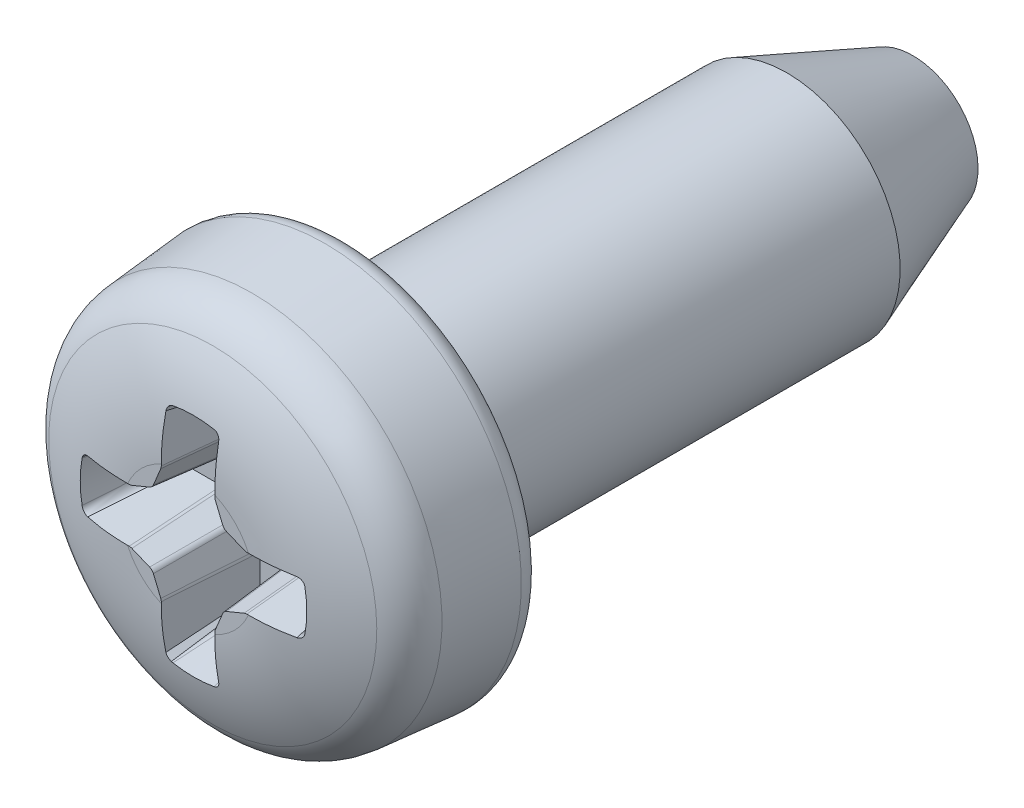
ISO-10303-21;
HEADER;
FILE_DESCRIPTION(('STEP AP214'),'2;1');
FILE_NAME('part.step','',(''),(''),'','','');
FILE_SCHEMA(('AUTOMOTIVE_DESIGN { 1 0 10303 214 1 1 1 1 }'));
ENDSEC;
DATA;
#1=APPLICATION_CONTEXT('core data for automotive mechanical design processes');
#2=APPLICATION_PROTOCOL_DEFINITION('international standard','automotive_design',2000,#1);
#3=PRODUCT_CONTEXT('',#1,'mechanical');
#4=PRODUCT('Part','Part','',(#3));
#5=PRODUCT_RELATED_PRODUCT_CATEGORY('part','',(#4));
#6=PRODUCT_DEFINITION_FORMATION('','',#4);
#7=PRODUCT_DEFINITION_CONTEXT('part definition',#1,'design');
#8=PRODUCT_DEFINITION('design','',#6,#7);
#9=PRODUCT_DEFINITION_SHAPE('','',#8);
#10=(LENGTH_UNIT() NAMED_UNIT(*) SI_UNIT(.MILLI.,.METRE.));
#11=(NAMED_UNIT(*) PLANE_ANGLE_UNIT() SI_UNIT($,.RADIAN.));
#12=(NAMED_UNIT(*) SI_UNIT($,.STERADIAN.) SOLID_ANGLE_UNIT());
#13=UNCERTAINTY_MEASURE_WITH_UNIT(LENGTH_MEASURE(1.E-05),#10,'distance_accuracy_value','');
#14=(GEOMETRIC_REPRESENTATION_CONTEXT(3) GLOBAL_UNCERTAINTY_ASSIGNED_CONTEXT((#13)) GLOBAL_UNIT_ASSIGNED_CONTEXT((#10,
#11,#12)) REPRESENTATION_CONTEXT('',''));
#15=CARTESIAN_POINT('',(0.,0.,0.));
#16=DIRECTION('',(0.,0.,1.));
#17=DIRECTION('',(1.,0.,0.));
#18=AXIS2_PLACEMENT_3D('',#15,#16,#17);
#19=CARTESIAN_POINT('',(0.,0.583333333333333,1.4));
#20=DIRECTION('',(0.,0.,-1.));
#21=DIRECTION('',(0.,1.,0.));
#22=AXIS2_PLACEMENT_3D('',#19,#20,#21);
#23=PLANE('',#22);
#24=DIRECTION('',(-1.,0.,0.));
#25=VECTOR('',#24,1.);
#26=CARTESIAN_POINT('',(0.986083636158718,-0.236240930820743,1.4));
#27=LINE('',#26,#25);
#28=CARTESIAN_POINT('',(0.519317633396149,-0.236240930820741,1.4));
#29=VERTEX_POINT('',#28);
#30=CARTESIAN_POINT('',(0.533355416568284,-0.236240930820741,1.4));
#31=VERTEX_POINT('',#30);
#32=EDGE_CURVE('E948',#29,#31,#27,.F.);
#33=ORIENTED_EDGE('',*,*,#32,.F.);
#34=CARTESIAN_POINT('',(0.519412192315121,-0.298822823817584,1.4));
#35=DIRECTION('',(0.,0.,-1.));
#36=DIRECTION('',(0.195090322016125,-0.980785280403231,0.));
#37=AXIS2_PLACEMENT_3D('',#34,#35,#36);
#38=ELLIPSE('',#37,0.0625912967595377,0.06234375);
#39=CARTESIAN_POINT('',(0.495550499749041,-0.240968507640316,1.4));
#40=VERTEX_POINT('',#39);
#41=EDGE_CURVE('E1194',#29,#40,#38,.F.);
#42=ORIENTED_EDGE('',*,*,#41,.T.);
#43=DIRECTION('',(-0.923879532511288,-0.382683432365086,0.));
#44=VECTOR('',#43,1.);
#45=CARTESIAN_POINT('',(0.519826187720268,-0.230913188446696,1.4));
#46=LINE('',#45,#44);
#47=CARTESIAN_POINT('',(0.339300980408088,-0.305689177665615,1.4));
#48=VERTEX_POINT('',#47);
#49=EDGE_CURVE('E951',#48,#40,#46,.F.);
#50=ORIENTED_EDGE('',*,*,#49,.F.);
#51=CARTESIAN_POINT('',(0.363431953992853,-0.363431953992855,1.4));
#52=DIRECTION('',(0.,0.,-1.));
#53=DIRECTION('',(0.707106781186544,-0.707106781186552,0.));
#54=AXIS2_PLACEMENT_3D('',#51,#52,#53);
#55=ELLIPSE('',#54,0.0626226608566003,0.06234375);
#56=CARTESIAN_POINT('',(0.305689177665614,-0.339300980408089,1.4));
#57=VERTEX_POINT('',#56);
#58=EDGE_CURVE('E1196',#48,#57,#55,.F.);
#59=ORIENTED_EDGE('',*,*,#58,.T.);
#60=DIRECTION('',(-0.382683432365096,-0.923879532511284,0.));
#61=VECTOR('',#60,1.);
#62=CARTESIAN_POINT('',(0.326628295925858,-0.288749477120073,1.4));
#63=LINE('',#62,#61);
#64=CARTESIAN_POINT('',(0.240968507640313,-0.495550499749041,1.4));
#65=VERTEX_POINT('',#64);
#66=EDGE_CURVE('E954',#65,#57,#63,.F.);
#67=ORIENTED_EDGE('',*,*,#66,.F.);
#68=CARTESIAN_POINT('',(0.298822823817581,-0.519412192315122,1.4));
#69=DIRECTION('',(0.,0.,-1.));
#70=DIRECTION('',(0.980785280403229,-0.195090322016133,0.));
#71=AXIS2_PLACEMENT_3D('',#68,#69,#70);
#72=ELLIPSE('',#71,0.0625912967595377,0.06234375);
#73=CARTESIAN_POINT('',(0.236240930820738,-0.519317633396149,1.4));
#74=VERTEX_POINT('',#73);
#75=EDGE_CURVE('E1198',#65,#74,#72,.F.);
#76=ORIENTED_EDGE('',*,*,#75,.T.);
#77=DIRECTION('',(0.,-1.,0.));
#78=VECTOR('',#77,1.);
#79=CARTESIAN_POINT('',(0.236240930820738,-0.49304181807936,1.4));
#80=LINE('',#79,#78);
#81=CARTESIAN_POINT('',(0.236240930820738,-0.533355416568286,1.4));
#82=VERTEX_POINT('',#81);
#83=EDGE_CURVE('E395',#82,#74,#80,.F.);
#84=ORIENTED_EDGE('',*,*,#83,.F.);
#85=CARTESIAN_POINT('',(0.,0.,1.4));
#86=DIRECTION('',(0.,0.,1.));
#87=DIRECTION('',(0.,-1.,0.));
#88=AXIS2_PLACEMENT_3D('',#85,#86,#87);
#89=CIRCLE('',#88,0.583333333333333);
#90=EDGE_CURVE('E349',#82,#31,#89,.T.);
#91=ORIENTED_EDGE('',*,*,#90,.T.);
#92=EDGE_LOOP('',(#33,#42,#50,#59,#67,#76,#84,#91));
#93=FACE_BOUND('',#92,.T.);
#94=ADVANCED_FACE('F33',(#93),#23,.F.);
#95=DIRECTION('',(0.,1.,0.));
#96=VECTOR('',#95,1.);
#97=CARTESIAN_POINT('',(-0.236240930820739,-0.986083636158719,1.4));
#98=LINE('',#97,#96);
#99=CARTESIAN_POINT('',(-0.236240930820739,-0.519317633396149,1.4));
#100=VERTEX_POINT('',#99);
#101=CARTESIAN_POINT('',(-0.236240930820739,-0.533355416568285,1.4));
#102=VERTEX_POINT('',#101);
#103=EDGE_CURVE('E921',#100,#102,#98,.F.);
#104=ORIENTED_EDGE('',*,*,#103,.F.);
#105=CARTESIAN_POINT('',(-0.298822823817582,-0.519412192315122,1.4));
#106=DIRECTION('',(0.,0.,-1.));
#107=DIRECTION('',(-0.980785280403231,-0.195090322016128,0.));
#108=AXIS2_PLACEMENT_3D('',#105,#106,#107);
#109=ELLIPSE('',#108,0.0625912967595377,0.06234375);
#110=CARTESIAN_POINT('',(-0.240968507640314,-0.495550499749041,1.4));
#111=VERTEX_POINT('',#110);
#112=EDGE_CURVE('E1002',#100,#111,#109,.F.);
#113=ORIENTED_EDGE('',*,*,#112,.T.);
#114=DIRECTION('',(-0.382683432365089,0.923879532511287,0.));
#115=VECTOR('',#114,1.);
#116=CARTESIAN_POINT('',(-0.230913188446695,-0.519826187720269,1.4));
#117=LINE('',#116,#115);
#118=CARTESIAN_POINT('',(-0.305689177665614,-0.339300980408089,1.4));
#119=VERTEX_POINT('',#118);
#120=EDGE_CURVE('E925',#119,#111,#117,.F.);
#121=ORIENTED_EDGE('',*,*,#120,.F.);
#122=CARTESIAN_POINT('',(-0.363431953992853,-0.363431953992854,1.4));
#123=DIRECTION('',(0.,0.,-1.));
#124=DIRECTION('',(-0.707106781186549,-0.707106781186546,0.));
#125=AXIS2_PLACEMENT_3D('',#122,#123,#124);
#126=ELLIPSE('',#125,0.0626226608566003,0.06234375);
#127=CARTESIAN_POINT('',(-0.339300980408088,-0.305689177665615,1.4));
#128=VERTEX_POINT('',#127);
#129=EDGE_CURVE('E1000',#119,#128,#126,.F.);
#130=ORIENTED_EDGE('',*,*,#129,.T.);
#131=DIRECTION('',(-0.923879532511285,0.382683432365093,0.));
#132=VECTOR('',#131,1.);
#133=CARTESIAN_POINT('',(-0.288749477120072,-0.326628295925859,1.4));
#134=LINE('',#133,#132);
#135=CARTESIAN_POINT('',(-0.49555049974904,-0.240968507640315,1.4));
#136=VERTEX_POINT('',#135);
#137=EDGE_CURVE('E932',#136,#128,#134,.F.);
#138=ORIENTED_EDGE('',*,*,#137,.F.);
#139=CARTESIAN_POINT('',(-0.519412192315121,-0.298822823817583,1.4));
#140=DIRECTION('',(0.,0.,-1.));
#141=DIRECTION('',(-0.19509032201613,-0.98078528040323,0.));
#142=AXIS2_PLACEMENT_3D('',#139,#140,#141);
#143=ELLIPSE('',#142,0.0625912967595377,0.06234375);
#144=CARTESIAN_POINT('',(-0.519317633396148,-0.23624093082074,1.4));
#145=VERTEX_POINT('',#144);
#146=EDGE_CURVE('E929',#136,#145,#143,.F.);
#147=ORIENTED_EDGE('',*,*,#146,.T.);
#148=DIRECTION('',(-1.,0.,0.));
#149=VECTOR('',#148,1.);
#150=CARTESIAN_POINT('',(-0.493041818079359,-0.23624093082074,1.4));
#151=LINE('',#150,#149);
#152=CARTESIAN_POINT('',(-0.533355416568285,-0.23624093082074,1.4));
#153=VERTEX_POINT('',#152);
#154=EDGE_CURVE('E409',#153,#145,#151,.F.);
#155=ORIENTED_EDGE('',*,*,#154,.F.);
#156=EDGE_CURVE('E353',#153,#102,#89,.T.);
#157=ORIENTED_EDGE('',*,*,#156,.T.);
#158=EDGE_LOOP('',(#104,#113,#121,#130,#138,#147,#155,#157));
#159=FACE_BOUND('',#158,.T.);
#160=ADVANCED_FACE('F871',(#159),#23,.F.);
#161=DIRECTION('',(1.,0.,0.));
#162=VECTOR('',#161,1.);
#163=CARTESIAN_POINT('',(-0.986083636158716,0.23624093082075,1.4));
#164=LINE('',#163,#162);
#165=CARTESIAN_POINT('',(-0.519317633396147,0.236240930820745,1.4));
#166=VERTEX_POINT('',#165);
#167=CARTESIAN_POINT('',(-0.533355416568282,0.236240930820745,1.4));
#168=VERTEX_POINT('',#167);
#169=EDGE_CURVE('E418',#166,#168,#164,.F.);
#170=ORIENTED_EDGE('',*,*,#169,.F.);
#171=CARTESIAN_POINT('',(-0.519412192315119,0.298822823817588,1.4));
#172=DIRECTION('',(0.,0.,-1.));
#173=DIRECTION('',(-0.195090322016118,0.980785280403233,0.));
#174=AXIS2_PLACEMENT_3D('',#171,#172,#173);
#175=ELLIPSE('',#174,0.0625912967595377,0.06234375);
#176=CARTESIAN_POINT('',(-0.495550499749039,0.240968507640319,1.4));
#177=VERTEX_POINT('',#176);
#178=EDGE_CURVE('E775',#166,#177,#175,.F.);
#179=ORIENTED_EDGE('',*,*,#178,.T.);
#180=DIRECTION('',(0.923879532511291,0.38268343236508,0.));
#181=VECTOR('',#180,1.);
#182=CARTESIAN_POINT('',(-0.519826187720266,0.2309131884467,1.4));
#183=LINE('',#182,#181);
#184=CARTESIAN_POINT('',(-0.339300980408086,0.305689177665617,1.4));
#185=VERTEX_POINT('',#184);
#186=EDGE_CURVE('E423',#185,#177,#183,.F.);
#187=ORIENTED_EDGE('',*,*,#186,.F.);
#188=CARTESIAN_POINT('',(-0.36343195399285,0.363431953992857,1.4));
#189=DIRECTION('',(0.,0.,-1.));
#190=DIRECTION('',(-0.707106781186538,0.707106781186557,0.));
#191=AXIS2_PLACEMENT_3D('',#188,#189,#190);
#192=ELLIPSE('',#191,0.0626226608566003,0.06234375);
#193=CARTESIAN_POINT('',(-0.305689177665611,0.339300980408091,1.4));
#194=VERTEX_POINT('',#193);
#195=EDGE_CURVE('E773',#185,#194,#192,.F.);
#196=ORIENTED_EDGE('',*,*,#195,.T.);
#197=DIRECTION('',(0.382683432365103,0.923879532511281,0.));
#198=VECTOR('',#197,1.);
#199=CARTESIAN_POINT('',(-0.326628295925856,0.288749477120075,1.4));
#200=LINE('',#199,#198);
#201=CARTESIAN_POINT('',(-0.240968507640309,0.495550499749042,1.4));
#202=VERTEX_POINT('',#201);
#203=EDGE_CURVE('E430',#202,#194,#200,.F.);
#204=ORIENTED_EDGE('',*,*,#203,.F.);
#205=CARTESIAN_POINT('',(-0.298822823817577,0.519412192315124,1.4));
#206=DIRECTION('',(0.,0.,-1.));
#207=DIRECTION('',(-0.980785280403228,0.195090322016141,0.));
#208=AXIS2_PLACEMENT_3D('',#205,#206,#207);
#209=ELLIPSE('',#208,0.0625912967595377,0.06234375);
#210=CARTESIAN_POINT('',(-0.236240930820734,0.519317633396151,1.4));
#211=VERTEX_POINT('',#210);
#212=EDGE_CURVE('E770',#202,#211,#209,.F.);
#213=ORIENTED_EDGE('',*,*,#212,.T.);
#214=DIRECTION('',(0.,1.,0.));
#215=VECTOR('',#214,1.);
#216=CARTESIAN_POINT('',(-0.236240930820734,0.493041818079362,1.4));
#217=LINE('',#216,#215);
#218=CARTESIAN_POINT('',(-0.236240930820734,0.533355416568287,1.4));
#219=VERTEX_POINT('',#218);
#220=EDGE_CURVE('E444',#219,#211,#217,.F.);
#221=ORIENTED_EDGE('',*,*,#220,.F.);
#222=EDGE_CURVE('E347',#219,#168,#89,.T.);
#223=ORIENTED_EDGE('',*,*,#222,.T.);
#224=EDGE_LOOP('',(#170,#179,#187,#196,#204,#213,#221,#223));
#225=FACE_BOUND('',#224,.T.);
#226=ADVANCED_FACE('F875',(#225),#23,.F.);
#227=CARTESIAN_POINT('',(0.,0.,-5.));
#228=DIRECTION('',(0.,0.,1.));
#229=DIRECTION('',(0.,-1.,0.));
#230=AXIS2_PLACEMENT_3D('',#227,#228,#229);
#231=CONICAL_SURFACE('',#230,0.574999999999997,0.364913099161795);
#232=CARTESIAN_POINT('',(0.,0.,-3.8875));
#233=DIRECTION('',(0.,0.,1.));
#234=DIRECTION('',(0.,-1.,0.));
#235=AXIS2_PLACEMENT_3D('',#232,#233,#234);
#236=CIRCLE('',#235,0.999999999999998);
#237=CARTESIAN_POINT('',(0.,-0.999999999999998,-3.8875));
#238=VERTEX_POINT('',#237);
#239=EDGE_CURVE('E346',#238,#238,#236,.T.);
#240=ORIENTED_EDGE('',*,*,#239,.F.);
#241=EDGE_LOOP('',(#240));
#242=FACE_BOUND('',#241,.T.);
#243=CARTESIAN_POINT('',(0.,0.,-5.));
#244=DIRECTION('',(0.,0.,1.));
#245=DIRECTION('',(0.,-1.,0.));
#246=AXIS2_PLACEMENT_3D('',#243,#244,#245);
#247=CIRCLE('',#246,0.574999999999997);
#248=CARTESIAN_POINT('',(0.,-0.574999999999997,-5.));
#249=VERTEX_POINT('',#248);
#250=EDGE_CURVE('E328',#249,#249,#247,.T.);
#251=ORIENTED_EDGE('',*,*,#250,.T.);
#252=EDGE_LOOP('',(#251));
#253=FACE_BOUND('',#252,.T.);
#254=ADVANCED_FACE('F730',(#242,#253),#231,.T.);
#255=CARTESIAN_POINT('',(0.,0.,1.4));
#256=DIRECTION('',(0.,0.,1.));
#257=DIRECTION('',(0.,-1.,0.));
#258=AXIS2_PLACEMENT_3D('',#255,#256,#257);
#259=CYLINDRICAL_SURFACE('',#258,0.999999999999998);
#260=CARTESIAN_POINT('',(0.,0.,-0.0499999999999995));
#261=DIRECTION('',(0.,0.,1.));
#262=DIRECTION('',(0.,-1.,0.));
#263=AXIS2_PLACEMENT_3D('',#260,#261,#262);
#264=CIRCLE('',#263,0.999999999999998);
#265=CARTESIAN_POINT('',(0.,-0.999999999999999,-0.0499999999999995));
#266=VERTEX_POINT('',#265);
#267=EDGE_CURVE('E1538',#266,#266,#264,.F.);
#268=ORIENTED_EDGE('',*,*,#267,.T.);
#269=EDGE_LOOP('',(#268));
#270=FACE_BOUND('',#269,.T.);
#271=ORIENTED_EDGE('',*,*,#239,.T.);
#272=EDGE_LOOP('',(#271));
#273=FACE_BOUND('',#272,.T.);
#274=ADVANCED_FACE('F890',(#270,#273),#259,.T.);
#275=CARTESIAN_POINT('',(0.,0.999999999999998,0.));
#276=DIRECTION('',(0.,0.,1.));
#277=DIRECTION('',(0.,-1.,0.));
#278=AXIS2_PLACEMENT_3D('',#275,#276,#277);
#279=PLANE('',#278);
#280=CARTESIAN_POINT('',(0.,0.,0.));
#281=DIRECTION('',(0.,0.,1.));
#282=DIRECTION('',(0.,-1.,0.));
#283=AXIS2_PLACEMENT_3D('',#280,#281,#282);
#284=CIRCLE('',#283,1.55902101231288);
#285=CARTESIAN_POINT('',(0.,-1.55902101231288,0.));
#286=VERTEX_POINT('',#285);
#287=EDGE_CURVE('E1209',#286,#286,#284,.F.);
#288=ORIENTED_EDGE('',*,*,#287,.T.);
#289=EDGE_LOOP('',(#288));
#290=FACE_BOUND('',#289,.T.);
#291=CARTESIAN_POINT('',(0.,0.,0.));
#292=DIRECTION('',(0.,0.,1.));
#293=DIRECTION('',(0.,-1.,0.));
#294=AXIS2_PLACEMENT_3D('',#291,#292,#293);
#295=CIRCLE('',#294,1.05);
#296=CARTESIAN_POINT('',(0.,-1.05,0.));
#297=VERTEX_POINT('',#296);
#298=EDGE_CURVE('E947',#297,#297,#295,.T.);
#299=ORIENTED_EDGE('',*,*,#298,.T.);
#300=EDGE_LOOP('',(#299));
#301=FACE_BOUND('',#300,.T.);
#302=ADVANCED_FACE('F1509',(#290,#301),#279,.F.);
#303=CARTESIAN_POINT('',(0.,0.,0.));
#304=DIRECTION('',(0.,0.,-1.));
#305=DIRECTION('',(0.,1.,0.));
#306=AXIS2_PLACEMENT_3D('',#303,#304,#305);
#307=CONICAL_SURFACE('',#306,1.75,0.08726646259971);
#308=CARTESIAN_POINT('',(0.,0.,0.19025225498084));
#309=DIRECTION('',(0.,0.,1.));
#310=DIRECTION('',(0.,-1.,0.));
#311=AXIS2_PLACEMENT_3D('',#308,#309,#310);
#312=CIRCLE('',#311,1.73335508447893);
#313=CARTESIAN_POINT('',(0.,-1.73335508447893,0.19025225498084));
#314=VERTEX_POINT('',#313);
#315=EDGE_CURVE('E1531',#314,#314,#312,.T.);
#316=ORIENTED_EDGE('',*,*,#315,.T.);
#317=EDGE_LOOP('',(#316));
#318=FACE_BOUND('',#317,.T.);
#319=CARTESIAN_POINT('',(0.,0.,0.834834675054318));
#320=DIRECTION('',(0.,0.,1.));
#321=DIRECTION('',(0.,-1.,0.));
#322=AXIS2_PLACEMENT_3D('',#319,#320,#321);
#323=CIRCLE('',#322,1.6769614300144);
#324=CARTESIAN_POINT('',(0.,-1.6769614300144,0.834834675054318));
#325=VERTEX_POINT('',#324);
#326=EDGE_CURVE('E1534',#325,#325,#323,.F.);
#327=ORIENTED_EDGE('',*,*,#326,.T.);
#328=EDGE_LOOP('',(#327));
#329=FACE_BOUND('',#328,.T.);
#330=ADVANCED_FACE('F883',(#318,#329),#307,.T.);
#331=CARTESIAN_POINT('',(0.,0.,-0.425289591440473));
#332=DIRECTION('',(0.,0.,1.));
#333=DIRECTION('',(0.,-1.,0.));
#334=AXIS2_PLACEMENT_3D('',#331,#332,#333);
#335=DEGENERATE_TOROIDAL_SURFACE('',#334,0.583333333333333,1.82528959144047,.T.);
#336=CARTESIAN_POINT('',(0.,0.,1.18193694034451));
#337=DIRECTION('',(0.,0.,-1.));
#338=DIRECTION('',(0.,1.,0.));
#339=AXIS2_PLACEMENT_3D('',#336,#337,#338);
#340=CIRCLE('',#339,1.44849514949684);
#341=CARTESIAN_POINT('',(0.,1.44849514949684,1.18193694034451));
#342=VERTEX_POINT('',#341);
#343=EDGE_CURVE('E1535',#342,#342,#340,.F.);
#344=ORIENTED_EDGE('',*,*,#343,.T.);
#345=EDGE_LOOP('',(#344));
#346=FACE_BOUND('',#345,.T.);
#347=CARTESIAN_POINT('',(0.533355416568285,0.236240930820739,1.4));
#348=CARTESIAN_POINT('',(0.582825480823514,0.236243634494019,1.40003090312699));
#349=CARTESIAN_POINT('',(0.632309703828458,0.236093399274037,1.39831370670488));
#350=CARTESIAN_POINT('',(0.730727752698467,0.235476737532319,1.39126523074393));
#351=CARTESIAN_POINT('',(0.779663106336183,0.235012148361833,1.38595495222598));
#352=CARTESIAN_POINT('',(0.877000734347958,0.233756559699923,1.3716035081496));
#353=CARTESIAN_POINT('',(0.925402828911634,0.232965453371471,1.36256112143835));
#354=CARTESIAN_POINT('',(1.02163206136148,0.231051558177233,1.3406851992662));
#355=CARTESIAN_POINT('',(1.06945420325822,0.229926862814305,1.32782987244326));
#356=CARTESIAN_POINT('',(1.11668874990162,0.228637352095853,1.31309069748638));
#357=B_SPLINE_CURVE_WITH_KNOTS('',3,(#347,#348,#349,#350,#351,#352,#353,#354,#355,#356),
.UNSPECIFIED.,.F.,.F.,(4,2,2,2,4),(0.,0.148398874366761,0.295937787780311,0.443525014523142,
0.59197252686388),.UNSPECIFIED.);
#358=CARTESIAN_POINT('',(0.533355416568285,0.236240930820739,1.4));
#359=VERTEX_POINT('',#358);
#360=CARTESIAN_POINT('',(0.923828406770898,0.23293630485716,1.36222795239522));
#361=VERTEX_POINT('',#360);
#362=EDGE_CURVE('E329',#359,#361,#357,.T.);
#363=ORIENTED_EDGE('',*,*,#362,.T.);
#364=CARTESIAN_POINT('',(1.16699034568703,0.284795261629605,2.49308894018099));
#365=CARTESIAN_POINT('',(1.15514797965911,0.331680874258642,2.4908835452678));
#366=CARTESIAN_POINT('',(1.10734421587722,0.332345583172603,2.49848120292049));
#367=CARTESIAN_POINT('',(1.12669242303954,0.262078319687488,2.24059313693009));
#368=CARTESIAN_POINT('',(1.11508135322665,0.309511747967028,2.23748927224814));
#369=CARTESIAN_POINT('',(1.06689513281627,0.310255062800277,2.24598539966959));
#370=CARTESIAN_POINT('',(1.08624074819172,0.239301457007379,1.98812297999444));
#371=CARTESIAN_POINT('',(1.07494768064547,0.28737006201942,1.98440864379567));
#372=CARTESIAN_POINT('',(1.02628350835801,0.288166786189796,1.99351524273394));
#373=CARTESIAN_POINT('',(1.00481118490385,0.193540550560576,1.48327192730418));
#374=CARTESIAN_POINT('',(0.994486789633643,0.243170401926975,1.47920421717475));
#375=CARTESIAN_POINT('',(0.944524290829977,0.243998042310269,1.48866419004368));
#376=CARTESIAN_POINT('',(0.963833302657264,0.17055650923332,1.23089103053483));
#377=CARTESIAN_POINT('',(0.954035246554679,0.221046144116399,1.22632279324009));
#378=CARTESIAN_POINT('',(0.903376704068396,0.221917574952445,1.23628329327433));
#379=CARTESIAN_POINT('',(0.881131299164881,0.12429316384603,0.726248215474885));
#380=CARTESIAN_POINT('',(0.872729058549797,0.176838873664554,0.721031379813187));
#381=CARTESIAN_POINT('',(0.820333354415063,0.17776704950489,0.731640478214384));
#382=CARTESIAN_POINT('',(0.839407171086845,0.101013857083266,0.473986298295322));
#383=CARTESIAN_POINT('',(0.831686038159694,0.154657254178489,0.467494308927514));
#384=CARTESIAN_POINT('',(0.778437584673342,0.155696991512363,0.479378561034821));
#385=CARTESIAN_POINT('',(0.75459035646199,0.0539255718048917,-0.030322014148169));
#386=CARTESIAN_POINT('',(0.749313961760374,0.110531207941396,-0.0368687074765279));
#387=CARTESIAN_POINT('',(0.693342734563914,0.111575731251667,-0.0249297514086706));
#388=CARTESIAN_POINT('',(0.711497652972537,0.0301165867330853,-0.282368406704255));
#389=CARTESIAN_POINT('',(0.707613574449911,0.088396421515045,-0.28987047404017));
#390=CARTESIAN_POINT('',(0.650143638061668,0.089524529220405,-0.276976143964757));
#391=CARTESIAN_POINT('',(0.667409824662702,0.00592573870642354,-0.534256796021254));
#392=CARTESIAN_POINT('',(0.665979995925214,0.0665731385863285,-0.539311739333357));
#393=CARTESIAN_POINT('',(0.60601563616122,0.067487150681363,-0.528864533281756));
#394=(BOUNDED_SURFACE() B_SPLINE_SURFACE(3,2,((#364,#365,#366),(#367,#368,#369),(#370,#371,
#372),(#373,#374,#375),(#376,#377,#378),(#379,#380,#381),(#382,#383,#384),(#385,#386,#387),
(#388,#389,#390),(#391,#392,#393)),.UNSPECIFIED.,.F.,.F.,.F.) B_SPLINE_SURFACE_WITH_KNOTS((4,2,
2,2,4),(3,3),(0.,0.770002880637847,1.53999670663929,2.30999758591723,3.08000800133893),(0.,1.),
.UNSPECIFIED.) GEOMETRIC_REPRESENTATION_ITEM() RATIONAL_B_SPLINE_SURFACE(((1.,0.78985085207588,
1.),(1.,0.7866796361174,1.),(1.,0.783182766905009,1.),(1.,0.7750184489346,1.),(1.,
0.770351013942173,1.),(1.,0.75932619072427,1.),(1.,0.752968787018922,1.),(1.,0.737029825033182,
1.),(1.,0.727448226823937,1.),(1.,0.715487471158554,1.))) REPRESENTATION_ITEM('') SURFACE());
#395=CARTESIAN_POINT('',(0.923828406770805,0.232936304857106,1.36222795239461));
#396=CARTESIAN_POINT('',(0.927271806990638,0.232879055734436,1.36154103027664));
#397=CARTESIAN_POINT('',(0.930710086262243,0.232519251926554,1.3608600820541));
#398=CARTESIAN_POINT('',(0.937479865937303,0.231218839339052,1.35953141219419));
#399=CARTESIAN_POINT('',(0.940811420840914,0.230278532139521,1.35888367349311));
#400=CARTESIAN_POINT('',(0.947276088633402,0.22784089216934,1.35764173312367));
#401=CARTESIAN_POINT('',(0.950409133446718,0.22634336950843,1.35704754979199));
#402=CARTESIAN_POINT('',(0.956387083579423,0.222836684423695,1.35593259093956));
#403=CARTESIAN_POINT('',(0.959232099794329,0.220827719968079,1.35541178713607));
#404=CARTESIAN_POINT('',(0.964560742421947,0.216349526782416,1.35445995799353));
#405=CARTESIAN_POINT('',(0.967043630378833,0.213879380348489,1.3540291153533));
#406=CARTESIAN_POINT('',(0.971573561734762,0.208551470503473,1.35327282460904));
#407=CARTESIAN_POINT('',(0.973620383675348,0.205693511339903,1.35294743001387));
#408=CARTESIAN_POINT('',(0.977354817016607,0.199439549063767,1.35239378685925));
#409=CARTESIAN_POINT('',(0.979003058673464,0.196019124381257,1.35217485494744));
#410=CARTESIAN_POINT('',(0.981675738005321,0.188932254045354,1.35188070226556));
#411=CARTESIAN_POINT('',(0.982699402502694,0.185265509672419,1.35180565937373));
#412=CARTESIAN_POINT('',(0.983384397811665,0.18153546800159,1.35180663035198));
#413=B_SPLINE_CURVE_WITH_KNOTS('',3,(#395,#396,#397,#398,#399,#400,#401,#402,#403,#404,#405,
#406,#407,#408,#409,#410,#411,#412),.UNSPECIFIED.,.F.,.F.,(4,2,2,2,2,2,2,2,4),(0.,
0.0105209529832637,0.0210364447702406,0.0315555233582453,0.042070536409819,0.0526067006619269,
0.0631482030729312,0.07449474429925,0.0858553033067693),.UNSPECIFIED.);
#414=CARTESIAN_POINT('',(0.983384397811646,0.181535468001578,1.35180663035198));
#415=VERTEX_POINT('',#414);
#416=EDGE_CURVE('E11',#361,#415,#413,.T.);
#417=ORIENTED_EDGE('',*,*,#416,.T.);
#418=CARTESIAN_POINT('',(0.,0.,1.35180663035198));
#419=DIRECTION('',(0.,0.,-1.));
#420=DIRECTION('',(0.,1.,0.));
#421=AXIS2_PLACEMENT_3D('',#418,#419,#420);
#422=CIRCLE('',#421,1.00000000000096);
#423=CARTESIAN_POINT('',(0.983384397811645,-0.181535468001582,1.35180663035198));
#424=VERTEX_POINT('',#423);
#425=EDGE_CURVE('E564',#415,#424,#422,.T.);
#426=ORIENTED_EDGE('',*,*,#425,.T.);
#427=CARTESIAN_POINT('',(1.10734424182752,-0.332345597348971,2.49848136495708));
#428=CARTESIAN_POINT('',(1.15514800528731,-0.331680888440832,2.49088370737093));
#429=CARTESIAN_POINT('',(1.16699037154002,-0.284795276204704,2.49308910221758));
#430=CARTESIAN_POINT('',(1.06689515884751,-0.310255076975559,2.24598556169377));
#431=CARTESIAN_POINT('',(1.11508137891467,-0.309511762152,2.23748943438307));
#432=CARTESIAN_POINT('',(1.12669244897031,-0.262078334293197,2.24059329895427));
#433=CARTESIAN_POINT('',(1.02628353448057,-0.288166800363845,1.99351540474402));
#434=CARTESIAN_POINT('',(1.0749477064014,-0.287370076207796,1.9844088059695));
#435=CARTESIAN_POINT('',(1.08624077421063,-0.239301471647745,1.98812314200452));
#436=CARTESIAN_POINT('',(0.944524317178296,-0.24399805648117,1.48866435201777));
#437=CARTESIAN_POINT('',(0.994486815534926,-0.243170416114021,1.47920437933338));
#438=CARTESIAN_POINT('',(1.00481121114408,-0.193540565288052,1.48327208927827));
#439=CARTESIAN_POINT('',(0.90337673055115,-0.22191758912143,1.23628345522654));
#440=CARTESIAN_POINT('',(0.954035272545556,-0.221046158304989,1.22632295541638));
#441=CARTESIAN_POINT('',(0.963833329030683,-0.170556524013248,1.23089119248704));
#442=CARTESIAN_POINT('',(0.820333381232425,-0.177767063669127,0.73164064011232));
#443=CARTESIAN_POINT('',(0.872729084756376,-0.176838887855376,0.721031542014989));
#444=CARTESIAN_POINT('',(0.881131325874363,-0.124293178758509,0.726248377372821));
#445=CARTESIAN_POINT('',(0.778437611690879,-0.155697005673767,0.479378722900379));
#446=CARTESIAN_POINT('',(0.831686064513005,-0.154657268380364,0.46749447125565));
#447=CARTESIAN_POINT('',(0.839407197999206,-0.101013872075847,0.473986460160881));
#448=CARTESIAN_POINT('',(0.693342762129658,-0.11157574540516,-0.0249295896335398));
#449=CARTESIAN_POINT('',(0.749313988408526,-0.110531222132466,-0.0368685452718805));
#450=CARTESIAN_POINT('',(0.754590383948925,-0.0539255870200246,-0.0303218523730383));
#451=CARTESIAN_POINT('',(0.650143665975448,-0.0895245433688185,-0.276975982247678));
#452=CARTESIAN_POINT('',(0.707613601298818,-0.0883964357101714,-0.289870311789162));
#453=CARTESIAN_POINT('',(0.711497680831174,-0.0301166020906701,-0.282368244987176));
#454=CARTESIAN_POINT('',(0.606015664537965,-0.0674871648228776,-0.52886437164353));
#455=CARTESIAN_POINT('',(0.665980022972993,-0.0665731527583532,-0.539311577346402));
#456=CARTESIAN_POINT('',(0.667409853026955,-0.00592575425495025,-0.534256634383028));
#457=(BOUNDED_SURFACE() B_SPLINE_SURFACE(3,2,((#427,#428,#429),(#430,#431,#432),(#433,#434,
#435),(#436,#437,#438),(#439,#440,#441),(#442,#443,#444),(#445,#446,#447),(#448,#449,#450),
(#451,#452,#453),(#454,#455,#456)),.UNSPECIFIED.,.F.,.F.,.F.) B_SPLINE_SURFACE_WITH_KNOTS((4,2,
2,2,4),(3,3),(0.,0.770002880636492,1.53999670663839,2.30999758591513,3.08000800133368),(0.,1.),
.UNSPECIFIED.) GEOMETRIC_REPRESENTATION_ITEM() RATIONAL_B_SPLINE_SURFACE(((1.,0.789850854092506,
1.),(1.,0.786679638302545,1.),(1.,0.783182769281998,1.),(1.,0.775018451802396,1.),(1.,
0.770351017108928,1.),(1.,0.759326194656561,1.),(1.,0.752968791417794,1.),(1.,0.737029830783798,
1.),(1.,0.727448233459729,1.),(1.,0.715487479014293,1.))) REPRESENTATION_ITEM('') SURFACE());
#458=CARTESIAN_POINT('',(0.983384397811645,-0.181535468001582,1.35180663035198));
#459=CARTESIAN_POINT('',(0.982747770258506,-0.184997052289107,1.35180596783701));
#460=CARTESIAN_POINT('',(0.981820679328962,-0.188404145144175,1.35187046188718));
#461=CARTESIAN_POINT('',(0.979424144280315,-0.195015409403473,1.35212404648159));
#462=CARTESIAN_POINT('',(0.97795494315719,-0.198219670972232,1.35231308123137));
#463=CARTESIAN_POINT('',(0.974511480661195,-0.204335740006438,1.35281013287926));
#464=CARTESIAN_POINT('',(0.97253703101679,-0.207247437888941,1.35311819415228));
#465=CARTESIAN_POINT('',(0.968141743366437,-0.212694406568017,1.35384189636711));
#466=CARTESIAN_POINT('',(0.965721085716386,-0.215229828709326,1.3542574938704));
#467=CARTESIAN_POINT('',(0.960497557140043,-0.219854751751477,1.35518272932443));
#468=CARTESIAN_POINT('',(0.957694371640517,-0.221943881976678,1.35569244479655));
#469=CARTESIAN_POINT('',(0.95178562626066,-0.225615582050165,1.35678848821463));
#470=CARTESIAN_POINT('',(0.948679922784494,-0.227197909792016,1.35737485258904));
#471=CARTESIAN_POINT('',(0.942030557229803,-0.229897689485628,1.35864749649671));
#472=CARTESIAN_POINT('',(0.9384714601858,-0.230975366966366,1.35933788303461));
#473=CARTESIAN_POINT('',(0.931219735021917,-0.232464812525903,1.3607591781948));
#474=CARTESIAN_POINT('',(0.927526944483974,-0.232875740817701,1.36149013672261));
#475=CARTESIAN_POINT('',(0.923828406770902,-0.232936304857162,1.36222795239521));
#476=B_SPLINE_CURVE_WITH_KNOTS('',3,(#458,#459,#460,#461,#462,#463,#464,#465,#466,#467,#468,
#469,#470,#471,#472,#473,#474,#475),.UNSPECIFIED.,.F.,.F.,(4,2,2,2,2,2,2,2,4),(0.,
0.0105450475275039,0.0210853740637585,0.0316296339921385,0.0421696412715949,0.0527183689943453,
0.0632721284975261,0.0745566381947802,0.0858553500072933),.UNSPECIFIED.);
#477=CARTESIAN_POINT('',(0.923828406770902,-0.232936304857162,1.36222795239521));
#478=VERTEX_POINT('',#477);
#479=EDGE_CURVE('E54',#424,#478,#476,.T.);
#480=ORIENTED_EDGE('',*,*,#479,.T.);
#481=CARTESIAN_POINT('',(0.972709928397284,-0.232024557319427,1.35180663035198));
#482=CARTESIAN_POINT('',(0.917429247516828,-0.233125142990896,1.36438638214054));
#483=CARTESIAN_POINT('',(0.861576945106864,-0.234003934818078,1.37443101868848));
#484=CARTESIAN_POINT('',(0.749566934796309,-0.235327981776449,1.38956494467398));
#485=CARTESIAN_POINT('',(0.693413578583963,-0.235776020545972,1.39468605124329));
#486=CARTESIAN_POINT('',(0.609065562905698,-0.23614077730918,1.39885524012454));
#487=CARTESIAN_POINT('',(0.580945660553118,-0.236211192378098,1.39966008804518));
#488=CARTESIAN_POINT('',(0.52469099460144,-0.236255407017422,1.40016546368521));
#489=CARTESIAN_POINT('',(0.496556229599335,-0.236229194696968,1.39986585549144));
#490=CARTESIAN_POINT('',(0.4401334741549,-0.236086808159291,1.39823836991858));
#491=CARTESIAN_POINT('',(0.411845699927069,-0.235970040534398,1.39690370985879));
#492=CARTESIAN_POINT('',(0.355332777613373,-0.235662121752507,1.39338418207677));
#493=CARTESIAN_POINT('',(0.327107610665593,-0.235470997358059,1.39119962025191));
#494=CARTESIAN_POINT('',(0.298918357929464,-0.235250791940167,1.38868266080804));
#495=B_SPLINE_CURVE_WITH_KNOTS('',3,(#481,#482,#483,#484,#485,#486,#487,#488,#489,#490,#491,
#492,#493,#494),.UNSPECIFIED.,.F.,.F.,(4,2,2,2,2,2,4),(0.,0.170047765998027,0.338989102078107,
0.42336540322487,0.507752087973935,0.592696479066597,0.677610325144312),.UNSPECIFIED.);
#496=EDGE_CURVE('E911',#478,#31,#495,.T.);
#497=ORIENTED_EDGE('',*,*,#496,.T.);
#498=ORIENTED_EDGE('',*,*,#90,.F.);
#499=CARTESIAN_POINT('',(0.236240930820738,-0.533355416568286,1.4));
#500=CARTESIAN_POINT('',(0.236243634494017,-0.582825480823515,1.40003090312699));
#501=CARTESIAN_POINT('',(0.236093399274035,-0.632309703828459,1.39831370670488));
#502=CARTESIAN_POINT('',(0.235476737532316,-0.730727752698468,1.39126523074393));
#503=CARTESIAN_POINT('',(0.23501214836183,-0.779663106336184,1.38595495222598));
#504=CARTESIAN_POINT('',(0.233756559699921,-0.877000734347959,1.3716035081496));
#505=CARTESIAN_POINT('',(0.232965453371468,-0.925402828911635,1.36256112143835));
#506=CARTESIAN_POINT('',(0.231051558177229,-1.02163206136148,1.3406851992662));
#507=CARTESIAN_POINT('',(0.229926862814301,-1.06945420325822,1.32782987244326));
#508=CARTESIAN_POINT('',(0.228637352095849,-1.11668874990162,1.31309069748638));
#509=B_SPLINE_CURVE_WITH_KNOTS('',3,(#499,#500,#501,#502,#503,#504,#505,#506,#507,#508),
.UNSPECIFIED.,.F.,.F.,(4,2,2,2,4),(0.,0.148398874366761,0.295937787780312,0.443525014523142,
0.59197252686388),.UNSPECIFIED.);
#510=CARTESIAN_POINT('',(0.232936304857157,-0.923828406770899,1.36222795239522));
#511=VERTEX_POINT('',#510);
#512=EDGE_CURVE('E908',#82,#511,#509,.T.);
#513=ORIENTED_EDGE('',*,*,#512,.T.);
#514=CARTESIAN_POINT('',(0.284795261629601,-1.16699034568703,2.49308894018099));
#515=CARTESIAN_POINT('',(0.331680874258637,-1.15514797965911,2.4908835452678));
#516=CARTESIAN_POINT('',(0.332345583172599,-1.10734421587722,2.49848120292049));
#517=CARTESIAN_POINT('',(0.262078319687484,-1.12669242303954,2.24059313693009));
#518=CARTESIAN_POINT('',(0.309511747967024,-1.11508135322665,2.23748927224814));
#519=CARTESIAN_POINT('',(0.310255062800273,-1.06689513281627,2.24598539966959));
#520=CARTESIAN_POINT('',(0.239301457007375,-1.08624074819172,1.98812297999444));
#521=CARTESIAN_POINT('',(0.287370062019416,-1.07494768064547,1.98440864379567));
#522=CARTESIAN_POINT('',(0.288166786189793,-1.02628350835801,1.99351524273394));
#523=CARTESIAN_POINT('',(0.193540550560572,-1.00481118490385,1.48327192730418));
#524=CARTESIAN_POINT('',(0.243170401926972,-0.994486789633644,1.47920421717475));
#525=CARTESIAN_POINT('',(0.243998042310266,-0.944524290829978,1.48866419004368));
#526=CARTESIAN_POINT('',(0.170556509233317,-0.963833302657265,1.23089103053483));
#527=CARTESIAN_POINT('',(0.221046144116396,-0.95403524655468,1.22632279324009));
#528=CARTESIAN_POINT('',(0.221917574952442,-0.903376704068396,1.23628329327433));
#529=CARTESIAN_POINT('',(0.124293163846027,-0.881131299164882,0.726248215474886));
#530=CARTESIAN_POINT('',(0.176838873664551,-0.872729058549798,0.721031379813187));
#531=CARTESIAN_POINT('',(0.177767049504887,-0.820333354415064,0.731640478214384));
#532=CARTESIAN_POINT('',(0.101013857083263,-0.839407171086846,0.473986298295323));
#533=CARTESIAN_POINT('',(0.154657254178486,-0.831686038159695,0.467494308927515));
#534=CARTESIAN_POINT('',(0.15569699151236,-0.778437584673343,0.479378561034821));
#535=CARTESIAN_POINT('',(0.0539255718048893,-0.754590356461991,-0.0303220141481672));
#536=CARTESIAN_POINT('',(0.110531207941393,-0.749313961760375,-0.0368687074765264));
#537=CARTESIAN_POINT('',(0.111575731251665,-0.693342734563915,-0.0249297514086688));
#538=CARTESIAN_POINT('',(0.0301165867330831,-0.711497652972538,-0.282368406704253));
#539=CARTESIAN_POINT('',(0.0883964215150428,-0.707613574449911,-0.289870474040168));
#540=CARTESIAN_POINT('',(0.089524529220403,-0.650143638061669,-0.276976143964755));
#541=CARTESIAN_POINT('',(0.00592573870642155,-0.667409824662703,-0.534256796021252));
#542=CARTESIAN_POINT('',(0.0665731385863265,-0.665979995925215,-0.539311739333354));
#543=CARTESIAN_POINT('',(0.0674871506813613,-0.606015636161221,-0.528864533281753));
#544=(BOUNDED_SURFACE() B_SPLINE_SURFACE(3,2,((#514,#515,#516),(#517,#518,#519),(#520,#521,
#522),(#523,#524,#525),(#526,#527,#528),(#529,#530,#531),(#532,#533,#534),(#535,#536,#537),
(#538,#539,#540),(#541,#542,#543)),.UNSPECIFIED.,.F.,.F.,.F.) B_SPLINE_SURFACE_WITH_KNOTS((4,2,
2,2,4),(3,3),(0.,0.770002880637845,1.53999670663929,2.30999758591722,3.08000800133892),(0.,1.),
.UNSPECIFIED.) GEOMETRIC_REPRESENTATION_ITEM() RATIONAL_B_SPLINE_SURFACE(((1.,0.78985085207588,
1.),(1.,0.7866796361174,1.),(1.,0.783182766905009,1.),(1.,0.7750184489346,1.),(1.,
0.770351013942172,1.),(1.,0.75932619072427,1.),(1.,0.752968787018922,1.),(1.,0.737029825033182,
1.),(1.,0.727448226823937,1.),(1.,0.715487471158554,1.))) REPRESENTATION_ITEM('') SURFACE());
#545=CARTESIAN_POINT('',(0.232936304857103,-0.923828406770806,1.36222795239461));
#546=CARTESIAN_POINT('',(0.232879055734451,-0.927271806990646,1.36154103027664));
#547=CARTESIAN_POINT('',(0.232519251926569,-0.930710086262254,1.3608600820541));
#548=CARTESIAN_POINT('',(0.23121883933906,-0.937479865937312,1.35953141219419));
#549=CARTESIAN_POINT('',(0.23027853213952,-0.940811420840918,1.35888367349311));
#550=CARTESIAN_POINT('',(0.227840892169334,-0.947276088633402,1.35764173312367));
#551=CARTESIAN_POINT('',(0.226343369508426,-0.950409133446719,1.35704754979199));
#552=CARTESIAN_POINT('',(0.222836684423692,-0.956387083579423,1.35593259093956));
#553=CARTESIAN_POINT('',(0.220827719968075,-0.959232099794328,1.35541178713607));
#554=CARTESIAN_POINT('',(0.216349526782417,-0.964560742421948,1.35445995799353));
#555=CARTESIAN_POINT('',(0.213879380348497,-0.967043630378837,1.35402911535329));
#556=CARTESIAN_POINT('',(0.208551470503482,-0.971573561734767,1.35327282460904));
#557=CARTESIAN_POINT('',(0.205693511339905,-0.973620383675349,1.35294743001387));
#558=CARTESIAN_POINT('',(0.199439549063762,-0.977354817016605,1.35239378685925));
#559=CARTESIAN_POINT('',(0.196019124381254,-0.979003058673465,1.35217485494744));
#560=CARTESIAN_POINT('',(0.188932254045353,-0.981675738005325,1.35188070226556));
#561=CARTESIAN_POINT('',(0.185265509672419,-0.982699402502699,1.35180565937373));
#562=CARTESIAN_POINT('',(0.181535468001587,-0.983384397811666,1.35180663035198));
#563=B_SPLINE_CURVE_WITH_KNOTS('',3,(#545,#546,#547,#548,#549,#550,#551,#552,#553,#554,#555,
#556,#557,#558,#559,#560,#561,#562),.UNSPECIFIED.,.F.,.F.,(4,2,2,2,2,2,2,2,4),(0.,
0.0105209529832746,0.0210364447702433,0.031555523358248,0.0420705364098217,0.0526067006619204,
0.0631482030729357,0.0744947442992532,0.0858553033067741),.UNSPECIFIED.);
#564=CARTESIAN_POINT('',(0.181535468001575,-0.983384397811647,1.35180663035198));
#565=VERTEX_POINT('',#564);
#566=EDGE_CURVE('E1115',#511,#565,#563,.T.);
#567=ORIENTED_EDGE('',*,*,#566,.T.);
#568=CARTESIAN_POINT('',(0.,0.,1.35180663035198));
#569=DIRECTION('',(0.,0.,-1.));
#570=DIRECTION('',(0.,1.,0.));
#571=AXIS2_PLACEMENT_3D('',#568,#569,#570);
#572=CIRCLE('',#571,1.00000000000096);
#573=CARTESIAN_POINT('',(-0.181535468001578,-0.983384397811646,1.35180663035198));
#574=VERTEX_POINT('',#573);
#575=EDGE_CURVE('E906',#565,#574,#572,.T.);
#576=ORIENTED_EDGE('',*,*,#575,.T.);
#577=CARTESIAN_POINT('',(-0.332345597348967,-1.10734424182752,2.49848136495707));
#578=CARTESIAN_POINT('',(-0.331680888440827,-1.15514800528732,2.49088370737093));
#579=CARTESIAN_POINT('',(-0.284795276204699,-1.16699037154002,2.49308910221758));
#580=CARTESIAN_POINT('',(-0.310255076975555,-1.06689515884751,2.24598556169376));
#581=CARTESIAN_POINT('',(-0.309511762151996,-1.11508137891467,2.23748943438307));
#582=CARTESIAN_POINT('',(-0.262078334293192,-1.12669244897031,2.24059329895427));
#583=CARTESIAN_POINT('',(-0.288166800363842,-1.02628353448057,1.99351540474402));
#584=CARTESIAN_POINT('',(-0.287370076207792,-1.0749477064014,1.9844088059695));
#585=CARTESIAN_POINT('',(-0.239301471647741,-1.08624077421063,1.98812314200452));
#586=CARTESIAN_POINT('',(-0.243998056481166,-0.944524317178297,1.48866435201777));
#587=CARTESIAN_POINT('',(-0.243170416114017,-0.994486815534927,1.47920437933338));
#588=CARTESIAN_POINT('',(-0.193540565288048,-1.00481121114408,1.48327208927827));
#589=CARTESIAN_POINT('',(-0.221917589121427,-0.903376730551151,1.23628345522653));
#590=CARTESIAN_POINT('',(-0.221046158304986,-0.954035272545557,1.22632295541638));
#591=CARTESIAN_POINT('',(-0.170556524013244,-0.963833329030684,1.23089119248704));
#592=CARTESIAN_POINT('',(-0.177767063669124,-0.820333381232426,0.73164064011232));
#593=CARTESIAN_POINT('',(-0.176838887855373,-0.872729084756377,0.721031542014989));
#594=CARTESIAN_POINT('',(-0.124293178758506,-0.881131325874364,0.726248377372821));
#595=CARTESIAN_POINT('',(-0.155697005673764,-0.77843761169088,0.47937872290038));
#596=CARTESIAN_POINT('',(-0.154657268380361,-0.831686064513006,0.467494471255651));
#597=CARTESIAN_POINT('',(-0.101013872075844,-0.839407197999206,0.473986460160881));
#598=CARTESIAN_POINT('',(-0.111575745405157,-0.693342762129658,-0.0249295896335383));
#599=CARTESIAN_POINT('',(-0.110531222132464,-0.749313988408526,-0.036868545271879));
#600=CARTESIAN_POINT('',(-0.053925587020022,-0.754590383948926,-0.0303218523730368));
#601=CARTESIAN_POINT('',(-0.0895245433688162,-0.650143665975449,-0.276975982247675));
#602=CARTESIAN_POINT('',(-0.088396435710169,-0.707613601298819,-0.28987031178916));
#603=CARTESIAN_POINT('',(-0.0301166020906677,-0.711497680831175,-0.282368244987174));
#604=CARTESIAN_POINT('',(-0.0674871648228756,-0.606015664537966,-0.528864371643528));
#605=CARTESIAN_POINT('',(-0.0665731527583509,-0.665980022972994,-0.5393115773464));
#606=CARTESIAN_POINT('',(-0.00592575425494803,-0.667409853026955,-0.534256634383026));
#607=(BOUNDED_SURFACE() B_SPLINE_SURFACE(3,2,((#577,#578,#579),(#580,#581,#582),(#583,#584,
#585),(#586,#587,#588),(#589,#590,#591),(#592,#593,#594),(#595,#596,#597),(#598,#599,#600),
(#601,#602,#603),(#604,#605,#606)),.UNSPECIFIED.,.F.,.F.,.F.) B_SPLINE_SURFACE_WITH_KNOTS((4,2,
2,2,4),(3,3),(0.,0.770002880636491,1.53999670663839,2.30999758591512,3.08000800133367),(0.,1.),
.UNSPECIFIED.) GEOMETRIC_REPRESENTATION_ITEM() RATIONAL_B_SPLINE_SURFACE(((1.,0.789850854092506,
1.),(1.,0.786679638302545,1.),(1.,0.783182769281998,1.),(1.,0.775018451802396,1.),(1.,
0.770351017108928,1.),(1.,0.759326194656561,1.),(1.,0.752968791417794,1.),(1.,0.737029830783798,
1.),(1.,0.727448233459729,1.),(1.,0.715487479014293,1.))) REPRESENTATION_ITEM('') SURFACE());
#608=CARTESIAN_POINT('',(-0.181535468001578,-0.983384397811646,1.35180663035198));
#609=CARTESIAN_POINT('',(-0.184997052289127,-0.982747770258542,1.35180596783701));
#610=CARTESIAN_POINT('',(-0.188404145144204,-0.981820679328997,1.35187046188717));
#611=CARTESIAN_POINT('',(-0.195015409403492,-0.97942414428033,1.35212404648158));
#612=CARTESIAN_POINT('',(-0.198219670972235,-0.977954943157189,1.35231308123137));
#613=CARTESIAN_POINT('',(-0.20433574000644,-0.974511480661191,1.35281013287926));
#614=CARTESIAN_POINT('',(-0.207247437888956,-0.972537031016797,1.35311819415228));
#615=CARTESIAN_POINT('',(-0.212694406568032,-0.968141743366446,1.3538418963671));
#616=CARTESIAN_POINT('',(-0.21522982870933,-0.965721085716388,1.3542574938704));
#617=CARTESIAN_POINT('',(-0.21985475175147,-0.960497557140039,1.35518272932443));
#618=CARTESIAN_POINT('',(-0.221943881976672,-0.957694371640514,1.35569244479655));
#619=CARTESIAN_POINT('',(-0.225615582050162,-0.951785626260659,1.35678848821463));
#620=CARTESIAN_POINT('',(-0.227197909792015,-0.948679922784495,1.35737485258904));
#621=CARTESIAN_POINT('',(-0.229897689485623,-0.9420305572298,1.35864749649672));
#622=CARTESIAN_POINT('',(-0.230975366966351,-0.938471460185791,1.35933788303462));
#623=CARTESIAN_POINT('',(-0.232464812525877,-0.931219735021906,1.3607591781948));
#624=CARTESIAN_POINT('',(-0.232875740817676,-0.927526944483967,1.36149013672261));
#625=CARTESIAN_POINT('',(-0.232936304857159,-0.923828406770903,1.36222795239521));
#626=B_SPLINE_CURVE_WITH_KNOTS('',3,(#608,#609,#610,#611,#612,#613,#614,#615,#616,#617,#618,
#619,#620,#621,#622,#623,#624,#625),.UNSPECIFIED.,.F.,.F.,(4,2,2,2,2,2,2,2,4),(0.,
0.0105450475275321,0.021085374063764,0.0316296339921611,0.0421696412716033,0.052718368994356,
0.0632721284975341,0.0745566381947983,0.0858553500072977),.UNSPECIFIED.);
#627=CARTESIAN_POINT('',(-0.232936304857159,-0.923828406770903,1.36222795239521));
#628=VERTEX_POINT('',#627);
#629=EDGE_CURVE('E916',#574,#628,#626,.T.);
#630=ORIENTED_EDGE('',*,*,#629,.T.);
#631=CARTESIAN_POINT('',(-0.232024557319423,-0.972709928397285,1.35180663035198));
#632=CARTESIAN_POINT('',(-0.233125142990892,-0.917429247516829,1.36438638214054));
#633=CARTESIAN_POINT('',(-0.234003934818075,-0.861576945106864,1.37443101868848));
#634=CARTESIAN_POINT('',(-0.235327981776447,-0.74956693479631,1.38956494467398));
#635=CARTESIAN_POINT('',(-0.235776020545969,-0.693413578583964,1.39468605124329));
#636=CARTESIAN_POINT('',(-0.236140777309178,-0.609065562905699,1.39885524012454));
#637=CARTESIAN_POINT('',(-0.236211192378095,-0.580945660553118,1.39966008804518));
#638=CARTESIAN_POINT('',(-0.236255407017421,-0.524690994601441,1.40016546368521));
#639=CARTESIAN_POINT('',(-0.236229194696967,-0.496556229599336,1.39986585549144));
#640=CARTESIAN_POINT('',(-0.236086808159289,-0.440133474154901,1.39823836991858));
#641=CARTESIAN_POINT('',(-0.235970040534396,-0.41184569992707,1.39690370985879));
#642=CARTESIAN_POINT('',(-0.235662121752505,-0.355332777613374,1.39338418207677));
#643=CARTESIAN_POINT('',(-0.235470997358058,-0.327107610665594,1.39119962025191));
#644=CARTESIAN_POINT('',(-0.235250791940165,-0.298918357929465,1.38868266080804));
#645=B_SPLINE_CURVE_WITH_KNOTS('',3,(#631,#632,#633,#634,#635,#636,#637,#638,#639,#640,#641,
#642,#643,#644),.UNSPECIFIED.,.F.,.F.,(4,2,2,2,2,2,4),(0.,0.170047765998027,0.338989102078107,
0.42336540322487,0.507752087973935,0.592696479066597,0.677610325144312),.UNSPECIFIED.);
#646=EDGE_CURVE('E456',#628,#102,#645,.T.);
#647=ORIENTED_EDGE('',*,*,#646,.T.);
#648=ORIENTED_EDGE('',*,*,#156,.F.);
#649=CARTESIAN_POINT('',(-0.533355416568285,-0.23624093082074,1.4));
#650=CARTESIAN_POINT('',(-0.582825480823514,-0.236243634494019,1.40003090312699));
#651=CARTESIAN_POINT('',(-0.632309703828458,-0.236093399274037,1.39831370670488));
#652=CARTESIAN_POINT('',(-0.730727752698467,-0.235476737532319,1.39126523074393));
#653=CARTESIAN_POINT('',(-0.779663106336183,-0.235012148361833,1.38595495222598));
#654=CARTESIAN_POINT('',(-0.877000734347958,-0.233756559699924,1.3716035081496));
#655=CARTESIAN_POINT('',(-0.925402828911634,-0.232965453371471,1.36256112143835));
#656=CARTESIAN_POINT('',(-1.02163206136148,-0.231051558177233,1.3406851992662));
#657=CARTESIAN_POINT('',(-1.06945420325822,-0.229926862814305,1.32782987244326));
#658=CARTESIAN_POINT('',(-1.11668874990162,-0.228637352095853,1.31309069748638));
#659=B_SPLINE_CURVE_WITH_KNOTS('',3,(#649,#650,#651,#652,#653,#654,#655,#656,#657,#658),
.UNSPECIFIED.,.F.,.F.,(4,2,2,2,4),(0.,0.148398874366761,0.295937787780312,0.443525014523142,
0.59197252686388),.UNSPECIFIED.);
#660=CARTESIAN_POINT('',(-0.923828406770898,-0.23293630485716,1.36222795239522));
#661=VERTEX_POINT('',#660);
#662=EDGE_CURVE('E899',#153,#661,#659,.T.);
#663=ORIENTED_EDGE('',*,*,#662,.T.);
#664=CARTESIAN_POINT('',(-1.16699034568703,-0.284795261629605,2.493088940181));
#665=CARTESIAN_POINT('',(-1.15514797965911,-0.331680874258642,2.49088354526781));
#666=CARTESIAN_POINT('',(-1.10734421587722,-0.332345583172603,2.4984812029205));
#667=CARTESIAN_POINT('',(-1.12669242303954,-0.262078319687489,2.24059313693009));
#668=CARTESIAN_POINT('',(-1.11508135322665,-0.309511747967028,2.23748927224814));
#669=CARTESIAN_POINT('',(-1.06689513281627,-0.310255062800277,2.24598539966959));
#670=CARTESIAN_POINT('',(-1.08624074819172,-0.239301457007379,1.98812297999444));
#671=CARTESIAN_POINT('',(-1.07494768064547,-0.287370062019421,1.98440864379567));
#672=CARTESIAN_POINT('',(-1.02628350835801,-0.288166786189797,1.99351524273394));
#673=CARTESIAN_POINT('',(-1.00481118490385,-0.193540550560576,1.48327192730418));
#674=CARTESIAN_POINT('',(-0.994486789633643,-0.243170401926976,1.47920421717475));
#675=CARTESIAN_POINT('',(-0.944524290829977,-0.24399804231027,1.48866419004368));
#676=CARTESIAN_POINT('',(-0.963833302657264,-0.17055650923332,1.23089103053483));
#677=CARTESIAN_POINT('',(-0.954035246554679,-0.2210461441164,1.22632279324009));
#678=CARTESIAN_POINT('',(-0.903376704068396,-0.221917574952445,1.23628329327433));
#679=CARTESIAN_POINT('',(-0.881131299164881,-0.12429316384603,0.726248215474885));
#680=CARTESIAN_POINT('',(-0.872729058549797,-0.176838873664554,0.721031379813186));
#681=CARTESIAN_POINT('',(-0.820333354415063,-0.17776704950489,0.731640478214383));
#682=CARTESIAN_POINT('',(-0.839407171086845,-0.101013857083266,0.473986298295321));
#683=CARTESIAN_POINT('',(-0.831686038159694,-0.154657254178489,0.467494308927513));
#684=CARTESIAN_POINT('',(-0.778437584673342,-0.155696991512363,0.479378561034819));
#685=CARTESIAN_POINT('',(-0.75459035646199,-0.0539255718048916,-0.0303220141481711));
#686=CARTESIAN_POINT('',(-0.749313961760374,-0.110531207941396,-0.0368687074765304));
#687=CARTESIAN_POINT('',(-0.693342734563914,-0.111575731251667,-0.0249297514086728));
#688=CARTESIAN_POINT('',(-0.711497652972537,-0.0301165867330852,-0.282368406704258));
#689=CARTESIAN_POINT('',(-0.70761357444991,-0.0883964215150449,-0.289870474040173));
#690=CARTESIAN_POINT('',(-0.650143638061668,-0.0895245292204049,-0.27697614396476));
#691=CARTESIAN_POINT('',(-0.667409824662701,-0.00592573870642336,-0.534256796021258));
#692=CARTESIAN_POINT('',(-0.665979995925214,-0.0665731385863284,-0.539311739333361));
#693=CARTESIAN_POINT('',(-0.606015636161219,-0.0674871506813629,-0.52886453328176));
#694=(BOUNDED_SURFACE() B_SPLINE_SURFACE(3,2,((#664,#665,#666),(#667,#668,#669),(#670,#671,
#672),(#673,#674,#675),(#676,#677,#678),(#679,#680,#681),(#682,#683,#684),(#685,#686,#687),
(#688,#689,#690),(#691,#692,#693)),.UNSPECIFIED.,.F.,.F.,.F.) B_SPLINE_SURFACE_WITH_KNOTS((4,2,
2,2,4),(3,3),(0.,0.770002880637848,1.5399967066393,2.30999758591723,3.08000800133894),(0.,1.),
.UNSPECIFIED.) GEOMETRIC_REPRESENTATION_ITEM() RATIONAL_B_SPLINE_SURFACE(((1.,0.78985085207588,
1.),(1.,0.786679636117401,1.),(1.,0.783182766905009,1.),(1.,0.7750184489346,1.),(1.,
0.770351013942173,1.),(1.,0.75932619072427,1.),(1.,0.752968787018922,1.),(1.,0.737029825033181,
1.),(1.,0.727448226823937,1.),(1.,0.715487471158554,1.))) REPRESENTATION_ITEM('') SURFACE());
#695=CARTESIAN_POINT('',(-0.923828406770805,-0.232936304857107,1.36222795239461));
#696=CARTESIAN_POINT('',(-0.92727180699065,-0.232879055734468,1.36154103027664));
#697=CARTESIAN_POINT('',(-0.930710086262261,-0.232519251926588,1.3608600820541));
#698=CARTESIAN_POINT('',(-0.937479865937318,-0.231218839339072,1.35953141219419));
#699=CARTESIAN_POINT('',(-0.94081142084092,-0.230278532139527,1.35888367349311));
#700=CARTESIAN_POINT('',(-0.947276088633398,-0.227840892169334,1.35764173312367));
#701=CARTESIAN_POINT('',(-0.950409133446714,-0.226343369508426,1.35704754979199));
#702=CARTESIAN_POINT('',(-0.956387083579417,-0.222836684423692,1.35593259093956));
#703=CARTESIAN_POINT('',(-0.959232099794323,-0.220827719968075,1.35541178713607));
#704=CARTESIAN_POINT('',(-0.964560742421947,-0.216349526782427,1.35445995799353));
#705=CARTESIAN_POINT('',(-0.96704363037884,-0.213879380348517,1.35402911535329));
#706=CARTESIAN_POINT('',(-0.971573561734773,-0.208551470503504,1.35327282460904));
#707=CARTESIAN_POINT('',(-0.973620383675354,-0.205693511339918,1.35294743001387));
#708=CARTESIAN_POINT('',(-0.977354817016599,-0.199439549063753,1.35239378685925));
#709=CARTESIAN_POINT('',(-0.979003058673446,-0.196019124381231,1.35217485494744));
#710=CARTESIAN_POINT('',(-0.981675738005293,-0.188932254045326,1.35188070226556));
#711=CARTESIAN_POINT('',(-0.982699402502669,-0.185265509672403,1.35180565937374));
#712=CARTESIAN_POINT('',(-0.983384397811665,-0.181535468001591,1.35180663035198));
#713=B_SPLINE_CURVE_WITH_KNOTS('',3,(#695,#696,#697,#698,#699,#700,#701,#702,#703,#704,#705,
#706,#707,#708,#709,#710,#711,#712),.UNSPECIFIED.,.F.,.F.,(4,2,2,2,2,2,2,2,4),(0.,
0.0105209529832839,0.0210364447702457,0.0315555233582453,0.0420705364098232,0.0526067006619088,
0.0631482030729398,0.074494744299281,0.0858553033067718),.UNSPECIFIED.);
#714=CARTESIAN_POINT('',(-0.983384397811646,-0.181535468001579,1.35180663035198));
#715=VERTEX_POINT('',#714);
#716=EDGE_CURVE('E1132',#661,#715,#713,.T.);
#717=ORIENTED_EDGE('',*,*,#716,.T.);
#718=CARTESIAN_POINT('',(0.,0.,1.35180663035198));
#719=DIRECTION('',(0.,0.,-1.));
#720=DIRECTION('',(0.,1.,0.));
#721=AXIS2_PLACEMENT_3D('',#718,#719,#720);
#722=CIRCLE('',#721,1.00000000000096);
#723=CARTESIAN_POINT('',(-0.983384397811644,0.181535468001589,1.35180663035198));
#724=VERTEX_POINT('',#723);
#725=EDGE_CURVE('E898',#715,#724,#722,.T.);
#726=ORIENTED_EDGE('',*,*,#725,.T.);
#727=CARTESIAN_POINT('',(-1.10734424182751,0.332345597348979,2.49848136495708));
#728=CARTESIAN_POINT('',(-1.15514800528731,0.33168088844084,2.49088370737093));
#729=CARTESIAN_POINT('',(-1.16699037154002,0.284795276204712,2.49308910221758));
#730=CARTESIAN_POINT('',(-1.0668951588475,0.310255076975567,2.24598556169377));
#731=CARTESIAN_POINT('',(-1.11508137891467,0.309511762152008,2.23748943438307));
#732=CARTESIAN_POINT('',(-1.12669244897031,0.262078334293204,2.24059329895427));
#733=CARTESIAN_POINT('',(-1.02628353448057,0.288166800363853,1.99351540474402));
#734=CARTESIAN_POINT('',(-1.07494770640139,0.287370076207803,1.9844088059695));
#735=CARTESIAN_POINT('',(-1.08624077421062,0.239301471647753,1.98812314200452));
#736=CARTESIAN_POINT('',(-0.944524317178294,0.243998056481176,1.48866435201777));
#737=CARTESIAN_POINT('',(-0.994486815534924,0.243170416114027,1.47920437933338));
#738=CARTESIAN_POINT('',(-1.00481121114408,0.193540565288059,1.48327208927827));
#739=CARTESIAN_POINT('',(-0.903376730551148,0.221917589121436,1.23628345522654));
#740=CARTESIAN_POINT('',(-0.954035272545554,0.221046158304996,1.22632295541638));
#741=CARTESIAN_POINT('',(-0.963833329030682,0.170556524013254,1.23089119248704));
#742=CARTESIAN_POINT('',(-0.820333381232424,0.177767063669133,0.731640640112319));
#743=CARTESIAN_POINT('',(-0.872729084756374,0.176838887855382,0.721031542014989));
#744=CARTESIAN_POINT('',(-0.881131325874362,0.124293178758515,0.726248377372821));
#745=CARTESIAN_POINT('',(-0.778437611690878,0.155697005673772,0.479378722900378));
#746=CARTESIAN_POINT('',(-0.831686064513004,0.154657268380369,0.46749447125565));
#747=CARTESIAN_POINT('',(-0.839407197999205,0.101013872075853,0.47398646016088));
#748=CARTESIAN_POINT('',(-0.693342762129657,0.111575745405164,-0.0249295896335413));
#749=CARTESIAN_POINT('',(-0.749313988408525,0.110531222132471,-0.036868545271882));
#750=CARTESIAN_POINT('',(-0.754590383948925,0.0539255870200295,-0.0303218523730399));
#751=CARTESIAN_POINT('',(-0.650143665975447,0.0895245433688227,-0.276975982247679));
#752=CARTESIAN_POINT('',(-0.707613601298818,0.0883964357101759,-0.289870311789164));
#753=CARTESIAN_POINT('',(-0.711497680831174,0.0301166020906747,-0.282368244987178));
#754=CARTESIAN_POINT('',(-0.606015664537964,0.0674871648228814,-0.528864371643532));
#755=CARTESIAN_POINT('',(-0.665980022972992,0.0665731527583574,-0.539311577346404));
#756=CARTESIAN_POINT('',(-0.667409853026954,0.00592575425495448,-0.53425663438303));
#757=(BOUNDED_SURFACE() B_SPLINE_SURFACE(3,2,((#727,#728,#729),(#730,#731,#732),(#733,#734,
#735),(#736,#737,#738),(#739,#740,#741),(#742,#743,#744),(#745,#746,#747),(#748,#749,#750),
(#751,#752,#753),(#754,#755,#756)),.UNSPECIFIED.,.F.,.F.,.F.) B_SPLINE_SURFACE_WITH_KNOTS((4,2,
2,2,4),(3,3),(0.,0.770002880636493,1.53999670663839,2.30999758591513,3.08000800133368),(0.,1.),
.UNSPECIFIED.) GEOMETRIC_REPRESENTATION_ITEM() RATIONAL_B_SPLINE_SURFACE(((1.,0.789850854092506,
1.),(1.,0.786679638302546,1.),(1.,0.783182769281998,1.),(1.,0.775018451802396,1.),(1.,
0.770351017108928,1.),(1.,0.759326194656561,1.),(1.,0.752968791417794,1.),(1.,0.737029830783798,
1.),(1.,0.727448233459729,1.),(1.,0.715487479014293,1.))) REPRESENTATION_ITEM('') SURFACE());
#758=CARTESIAN_POINT('',(-0.983384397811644,0.181535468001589,1.35180663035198));
#759=CARTESIAN_POINT('',(-0.982747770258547,0.184997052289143,1.351805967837));
#760=CARTESIAN_POINT('',(-0.981820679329,0.188404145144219,1.35187046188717));
#761=CARTESIAN_POINT('',(-0.979424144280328,0.195015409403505,1.35212404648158));
#762=CARTESIAN_POINT('',(-0.977954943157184,0.198219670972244,1.35231308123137));
#763=CARTESIAN_POINT('',(-0.974511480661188,0.204335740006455,1.35281013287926));
#764=CARTESIAN_POINT('',(-0.972537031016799,0.20724743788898,1.35311819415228));
#765=CARTESIAN_POINT('',(-0.968141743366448,0.212694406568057,1.3538418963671));
#766=CARTESIAN_POINT('',(-0.965721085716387,0.215229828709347,1.3542574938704));
#767=CARTESIAN_POINT('',(-0.960497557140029,0.219854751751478,1.35518272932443));
#768=CARTESIAN_POINT('',(-0.957694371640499,0.221943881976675,1.35569244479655));
#769=CARTESIAN_POINT('',(-0.951785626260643,0.225615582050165,1.35678848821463));
#770=CARTESIAN_POINT('',(-0.948679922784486,0.227197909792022,1.35737485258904));
#771=CARTESIAN_POINT('',(-0.9420305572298,0.229897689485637,1.35864749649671));
#772=CARTESIAN_POINT('',(-0.938471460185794,0.230975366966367,1.35933788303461));
#773=CARTESIAN_POINT('',(-0.931219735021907,0.232464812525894,1.3607591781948));
#774=CARTESIAN_POINT('',(-0.927526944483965,0.232875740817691,1.36149013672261));
#775=CARTESIAN_POINT('',(-0.9238284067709,0.232936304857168,1.36222795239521));
#776=B_SPLINE_CURVE_WITH_KNOTS('',3,(#758,#759,#760,#761,#762,#763,#764,#765,#766,#767,#768,
#769,#770,#771,#772,#773,#774,#775),.UNSPECIFIED.,.F.,.F.,(4,2,2,2,2,2,2,2,4),(0.,
0.0105450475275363,0.0210853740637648,0.0316296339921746,0.0421696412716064,0.0527183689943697,
0.0632721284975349,0.074556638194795,0.0858553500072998),.UNSPECIFIED.);
#777=CARTESIAN_POINT('',(-0.9238284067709,0.232936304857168,1.36222795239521));
#778=VERTEX_POINT('',#777);
#779=EDGE_CURVE('E896',#724,#778,#776,.T.);
#780=ORIENTED_EDGE('',*,*,#779,.T.);
#781=CARTESIAN_POINT('',(-0.972709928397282,0.232024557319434,1.35180663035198));
#782=CARTESIAN_POINT('',(-0.917429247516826,0.233125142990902,1.36438638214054));
#783=CARTESIAN_POINT('',(-0.861576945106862,0.234003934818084,1.37443101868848));
#784=CARTESIAN_POINT('',(-0.749566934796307,0.235327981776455,1.38956494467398));
#785=CARTESIAN_POINT('',(-0.693413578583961,0.235776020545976,1.39468605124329));
#786=CARTESIAN_POINT('',(-0.609065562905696,0.236140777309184,1.39885524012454));
#787=CARTESIAN_POINT('',(-0.580945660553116,0.236211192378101,1.39966008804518));
#788=CARTESIAN_POINT('',(-0.524690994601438,0.236255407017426,1.40016546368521));
#789=CARTESIAN_POINT('',(-0.496556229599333,0.236229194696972,1.39986585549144));
#790=CARTESIAN_POINT('',(-0.440133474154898,0.236086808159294,1.39823836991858));
#791=CARTESIAN_POINT('',(-0.411845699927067,0.235970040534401,1.39690370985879));
#792=CARTESIAN_POINT('',(-0.355332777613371,0.235662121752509,1.39338418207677));
#793=CARTESIAN_POINT('',(-0.327107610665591,0.235470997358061,1.39119962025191));
#794=CARTESIAN_POINT('',(-0.298918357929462,0.235250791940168,1.38868266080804));
#795=B_SPLINE_CURVE_WITH_KNOTS('',3,(#781,#782,#783,#784,#785,#786,#787,#788,#789,#790,#791,
#792,#793,#794),.UNSPECIFIED.,.F.,.F.,(4,2,2,2,2,2,4),(0.,0.170047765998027,0.338989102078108,
0.42336540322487,0.507752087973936,0.592696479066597,0.677610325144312),.UNSPECIFIED.);
#796=EDGE_CURVE('E433',#778,#168,#795,.T.);
#797=ORIENTED_EDGE('',*,*,#796,.T.);
#798=ORIENTED_EDGE('',*,*,#222,.F.);
#799=CARTESIAN_POINT('',(-0.236240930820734,0.533355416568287,1.4));
#800=CARTESIAN_POINT('',(-0.236243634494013,0.582825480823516,1.40003090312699));
#801=CARTESIAN_POINT('',(-0.23609339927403,0.63230970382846,1.39831370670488));
#802=CARTESIAN_POINT('',(-0.235476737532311,0.73072775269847,1.39126523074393));
#803=CARTESIAN_POINT('',(-0.235012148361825,0.779663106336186,1.38595495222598));
#804=CARTESIAN_POINT('',(-0.233756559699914,0.87700073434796,1.3716035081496));
#805=CARTESIAN_POINT('',(-0.232965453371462,0.925402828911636,1.36256112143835));
#806=CARTESIAN_POINT('',(-0.231051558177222,1.02163206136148,1.3406851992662));
#807=CARTESIAN_POINT('',(-0.229926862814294,1.06945420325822,1.32782987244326));
#808=CARTESIAN_POINT('',(-0.228637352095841,1.11668874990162,1.31309069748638));
#809=B_SPLINE_CURVE_WITH_KNOTS('',3,(#799,#800,#801,#802,#803,#804,#805,#806,#807,#808),
.UNSPECIFIED.,.F.,.F.,(4,2,2,2,4),(0.,0.148398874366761,0.295937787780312,0.443525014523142,
0.59197252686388),.UNSPECIFIED.);
#810=CARTESIAN_POINT('',(-0.232936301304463,0.923828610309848,1.36222791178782));
#811=VERTEX_POINT('',#810);
#812=EDGE_CURVE('E447',#219,#811,#809,.T.);
#813=ORIENTED_EDGE('',*,*,#812,.T.);
#814=CARTESIAN_POINT('',(-0.284795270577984,1.16699057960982,2.49308906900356));
#815=CARTESIAN_POINT('',(-0.331680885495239,1.15514821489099,2.49088367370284));
#816=CARTESIAN_POINT('',(-0.332345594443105,1.10734444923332,2.49848133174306));
#817=CARTESIAN_POINT('',(-0.262078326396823,1.12669265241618,2.24059324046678));
#818=CARTESIAN_POINT('',(-0.309511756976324,1.1150815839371,2.23748937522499));
#819=CARTESIAN_POINT('',(-0.310255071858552,1.06689536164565,2.24598550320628));
#820=CARTESIAN_POINT('',(-0.239301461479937,1.08624097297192,1.98812305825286));
#821=CARTESIAN_POINT('',(-0.287370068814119,1.07494790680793,1.98440872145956));
#822=CARTESIAN_POINT('',(-0.28816679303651,1.02628373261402,1.99351532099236));
#823=CARTESIAN_POINT('',(-0.193540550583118,1.00481140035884,1.48327195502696));
#824=CARTESIAN_POINT('',(-0.243170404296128,0.994487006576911,1.47920424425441));
#825=CARTESIAN_POINT('',(-0.243998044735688,0.944524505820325,1.48866421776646));
#826=CARTESIAN_POINT('',(-0.170556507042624,0.963833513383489,1.23089103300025));
#827=CARTESIAN_POINT('',(-0.221046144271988,0.954035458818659,1.22632279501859));
#828=CARTESIAN_POINT('',(-0.221917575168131,0.903376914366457,1.23628329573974));
#829=CARTESIAN_POINT('',(-0.124293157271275,0.88113150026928,0.726248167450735));
#830=CARTESIAN_POINT('',(-0.176838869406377,0.872729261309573,0.7210313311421));
#831=CARTESIAN_POINT('',(-0.177767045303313,0.82033355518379,0.731640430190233));
#832=CARTESIAN_POINT('',(-0.101013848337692,0.839407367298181,0.473986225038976));
#833=CARTESIAN_POINT('',(-0.154657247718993,0.831686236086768,0.46749423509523));
#834=CARTESIAN_POINT('',(-0.155696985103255,0.778437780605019,0.479378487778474));
#835=CARTESIAN_POINT('',(-0.0539255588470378,0.754590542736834,-0.0303221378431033));
#836=CARTESIAN_POINT('',(-0.110531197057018,0.749314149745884,-0.0368688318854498));
#837=CARTESIAN_POINT('',(-0.111575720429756,0.693342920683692,-0.0249298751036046));
#838=CARTESIAN_POINT('',(-0.0301165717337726,0.711497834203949,-0.282368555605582));
#839=CARTESIAN_POINT('',(-0.0883964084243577,0.707613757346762,-0.289870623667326));
#840=CARTESIAN_POINT('',(-0.0895245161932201,0.650143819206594,-0.276976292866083));
#841=CARTESIAN_POINT('',(-0.0059257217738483,0.66741000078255,-0.534256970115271));
#842=CARTESIAN_POINT('',(-0.0665731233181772,0.665980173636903,-0.539311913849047));
#843=CARTESIAN_POINT('',(-0.0674871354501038,0.606015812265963,-0.528864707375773));
#844=(BOUNDED_SURFACE() B_SPLINE_SURFACE(3,2,((#814,#815,#816),(#817,#818,#819),(#820,#821,
#822),(#823,#824,#825),(#826,#827,#828),(#829,#830,#831),(#832,#833,#834),(#835,#836,#837),
(#838,#839,#840),(#841,#842,#843)),.UNSPECIFIED.,.F.,.F.,.F.) B_SPLINE_SURFACE_WITH_KNOTS((4,2,
2,2,4),(3,3),(0.,0.770002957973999,1.53999686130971,2.30999781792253,3.08000831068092),(0.,1.),
.UNSPECIFIED.) GEOMETRIC_REPRESENTATION_ITEM() RATIONAL_B_SPLINE_SURFACE(((1.,0.789850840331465,
1.),(1.,0.786679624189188,1.),(1.,0.783182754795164,1.),(1.,0.77501843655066,1.),(1.,
0.770351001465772,1.),(1.,0.759326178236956,1.),(1.,0.752968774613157,1.),(1.,0.737029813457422,
1.),(1.,0.727448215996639,1.),(1.,0.715487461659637,1.))) REPRESENTATION_ITEM('') SURFACE());
#845=CARTESIAN_POINT('',(-0.232936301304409,0.923828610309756,1.36222791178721));
#846=CARTESIAN_POINT('',(-0.232879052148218,0.927272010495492,1.36154098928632));
#847=CARTESIAN_POINT('',(-0.232519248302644,0.930710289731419,1.36086004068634));
#848=CARTESIAN_POINT('',(-0.231218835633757,0.937480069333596,1.35953137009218));
#849=CARTESIAN_POINT('',(-0.230278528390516,0.940811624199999,1.35888363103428));
#850=CARTESIAN_POINT('',(-0.227840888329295,0.947276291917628,1.35764168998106));
#851=CARTESIAN_POINT('',(-0.2263433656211,0.95040933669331,1.35704750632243));
#852=CARTESIAN_POINT('',(-0.222836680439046,0.956387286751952,1.35593254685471));
#853=CARTESIAN_POINT('',(-0.220827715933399,0.959232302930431,1.35541174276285));
#854=CARTESIAN_POINT('',(-0.2163495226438,0.96456094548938,1.35445991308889));
#855=CARTESIAN_POINT('',(-0.213879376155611,0.967043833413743,1.35402907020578));
#856=CARTESIAN_POINT('',(-0.208551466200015,0.971573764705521,1.35327277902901));
#857=CARTESIAN_POINT('',(-0.205693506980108,0.973620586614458,1.35294738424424));
#858=CARTESIAN_POINT('',(-0.199439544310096,0.977355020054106,1.35239374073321));
#859=CARTESIAN_POINT('',(-0.196019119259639,0.979003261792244,1.35217480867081));
#860=CARTESIAN_POINT('',(-0.188932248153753,0.98167594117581,1.35188065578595));
#861=CARTESIAN_POINT('',(-0.185265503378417,0.982699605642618,1.35180561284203));
#862=CARTESIAN_POINT('',(-0.181535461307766,0.983384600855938,1.35180658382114));
#863=B_SPLINE_CURVE_WITH_KNOTS('',3,(#845,#846,#847,#848,#849,#850,#851,#852,#853,#854,#855,
#856,#857,#858,#859,#860,#861,#862),.UNSPECIFIED.,.F.,.F.,(4,2,2,2,2,2,2,2,4),(0.,
0.0105209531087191,0.0210364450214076,0.0315555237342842,0.042070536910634,0.0526067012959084,
0.0631482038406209,0.0744947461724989,0.0858553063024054),.UNSPECIFIED.);
#864=CARTESIAN_POINT('',(-0.181535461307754,0.983384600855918,1.35180658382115));
#865=VERTEX_POINT('',#864);
#866=EDGE_CURVE('E1049',#811,#865,#863,.T.);
#867=ORIENTED_EDGE('',*,*,#866,.T.);
#868=CARTESIAN_POINT('',(0.,0.,1.35180658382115));
#869=DIRECTION('',(0.,0.,-1.));
#870=DIRECTION('',(0.,1.,0.));
#871=AXIS2_PLACEMENT_3D('',#868,#869,#870);
#872=CIRCLE('',#871,1.00000019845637);
#873=CARTESIAN_POINT('',(0.181535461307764,0.983384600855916,1.35180658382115));
#874=VERTEX_POINT('',#873);
#875=EDGE_CURVE('E455',#865,#874,#872,.T.);
#876=ORIENTED_EDGE('',*,*,#875,.T.);
#877=CARTESIAN_POINT('',(0.332345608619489,1.10734447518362,2.49848149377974));
#878=CARTESIAN_POINT('',(0.331680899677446,1.15514824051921,2.49088383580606));
#879=CARTESIAN_POINT('',(0.284795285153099,1.16699060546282,2.49308923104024));
#880=CARTESIAN_POINT('',(0.31025508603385,1.0668953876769,2.24598566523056));
#881=CARTESIAN_POINT('',(0.309511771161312,1.11508160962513,2.23748953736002));
#882=CARTESIAN_POINT('',(0.262078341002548,1.12669267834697,2.24059340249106));
#883=CARTESIAN_POINT('',(0.288166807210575,1.02628375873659,1.99351548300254));
#884=CARTESIAN_POINT('',(0.28737008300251,1.07494793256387,1.98440888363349));
#885=CARTESIAN_POINT('',(0.239301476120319,1.08624099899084,1.98812322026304));
#886=CARTESIAN_POINT('',(0.243998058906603,0.944524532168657,1.48866437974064));
#887=CARTESIAN_POINT('',(0.243170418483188,0.994487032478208,1.47920440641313));
#888=CARTESIAN_POINT('',(0.193540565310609,1.00481142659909,1.48327211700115));
#889=CARTESIAN_POINT('',(0.221917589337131,0.903376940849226,1.23628345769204));
#890=CARTESIAN_POINT('',(0.221046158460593,0.95403548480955,1.22632295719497));
#891=CARTESIAN_POINT('',(0.170556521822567,0.963833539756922,1.23089119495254));
#892=CARTESIAN_POINT('',(0.177767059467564,0.820333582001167,0.731640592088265));
#893=CARTESIAN_POINT('',(0.176838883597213,0.872729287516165,0.721031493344));
#894=CARTESIAN_POINT('',(0.12429317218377,0.881131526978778,0.726248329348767));
#895=CARTESIAN_POINT('',(0.155696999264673,0.778437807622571,0.479378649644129));
#896=CARTESIAN_POINT('',(0.154657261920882,0.831686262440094,0.467494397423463));
#897=CARTESIAN_POINT('',(0.101013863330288,0.839407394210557,0.473986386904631));
#898=CARTESIAN_POINT('',(0.111575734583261,0.693342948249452,-0.0249297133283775));
#899=CARTESIAN_POINT('',(0.110531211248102,0.749314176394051,-0.0368686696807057));
#900=CARTESIAN_POINT('',(0.0539255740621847,0.754590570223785,-0.030321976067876));
#901=CARTESIAN_POINT('',(0.0895245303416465,0.650143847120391,-0.276976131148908));
#902=CARTESIAN_POINT('',(0.0883964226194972,0.707613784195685,-0.289870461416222));
#903=CARTESIAN_POINT('',(0.0301165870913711,0.711497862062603,-0.282368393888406));
#904=CARTESIAN_POINT('',(0.067487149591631,0.606015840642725,-0.52886454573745));
#905=CARTESIAN_POINT('',(0.0665731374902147,0.665980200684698,-0.539311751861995));
#906=CARTESIAN_POINT('',(0.00592573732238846,0.66741002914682,-0.534256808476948));
#907=(BOUNDED_SURFACE() B_SPLINE_SURFACE(3,2,((#877,#878,#879),(#880,#881,#882),(#883,#884,
#885),(#886,#887,#888),(#889,#890,#891),(#892,#893,#894),(#895,#896,#897),(#898,#899,#900),
(#901,#902,#903),(#904,#905,#906)),.UNSPECIFIED.,.F.,.F.,.F.) B_SPLINE_SURFACE_WITH_KNOTS((4,2,
2,2,4),(3,3),(0.,0.770002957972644,1.5399968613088,2.30999781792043,3.08000831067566),(0.,1.),
.UNSPECIFIED.) GEOMETRIC_REPRESENTATION_ITEM() RATIONAL_B_SPLINE_SURFACE(((1.,0.789850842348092,
1.),(1.,0.786679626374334,1.),(1.,0.783182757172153,1.),(1.,0.775018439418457,1.),(1.,
0.770351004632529,1.),(1.,0.759326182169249,1.),(1.,0.752968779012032,1.),(1.,0.737029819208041,
1.),(1.,0.727448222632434,1.),(1.,0.715487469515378,1.))) REPRESENTATION_ITEM('') SURFACE());
#908=CARTESIAN_POINT('',(0.181535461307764,0.983384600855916,1.35180658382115));
#909=CARTESIAN_POINT('',(0.184997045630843,0.982747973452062,1.35180592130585));
#910=CARTESIAN_POINT('',(0.188404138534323,0.981820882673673,1.35187041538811));
#911=CARTESIAN_POINT('',(0.195015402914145,0.979424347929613,1.35212400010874));
#912=CARTESIAN_POINT('',(0.198219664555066,0.977955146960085,1.35231303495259));
#913=CARTESIAN_POINT('',(0.204335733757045,0.974511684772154,1.3528100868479));
#914=CARTESIAN_POINT('',(0.207247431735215,0.972537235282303,1.35311814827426));
#915=CARTESIAN_POINT('',(0.212694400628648,0.968141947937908,1.35384185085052));
#916=CARTESIAN_POINT('',(0.215229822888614,0.965721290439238,1.35425744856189));
#917=CARTESIAN_POINT('',(0.219854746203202,0.960497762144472,1.35518268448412));
#918=CARTESIAN_POINT('',(0.221943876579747,0.957694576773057,1.3556924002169));
#919=CARTESIAN_POINT('',(0.225615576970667,0.951785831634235,1.35678844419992));
#920=CARTESIAN_POINT('',(0.227197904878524,0.948680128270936,1.35737480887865));
#921=CARTESIAN_POINT('',(0.229897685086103,0.942030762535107,1.35864745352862));
#922=CARTESIAN_POINT('',(0.23097536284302,0.938471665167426,1.35933784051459));
#923=CARTESIAN_POINT('',(0.232464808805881,0.931219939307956,1.36075913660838));
#924=CARTESIAN_POINT('',(0.232875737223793,0.927527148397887,1.3614900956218));
#925=CARTESIAN_POINT('',(0.232936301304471,0.923828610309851,1.36222791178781));
#926=B_SPLINE_CURVE_WITH_KNOTS('',3,(#908,#909,#910,#911,#912,#913,#914,#915,#916,#917,#918,
#919,#920,#921,#922,#923,#924,#925),.UNSPECIFIED.,.F.,.F.,(4,2,2,2,2,2,2,2,4),(0.,
0.0105450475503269,0.0210853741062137,0.0316296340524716,0.0421696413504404,0.052718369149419,
0.0632721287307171,0.0745566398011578,0.0858553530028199),.UNSPECIFIED.);
#927=CARTESIAN_POINT('',(0.232936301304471,0.923828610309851,1.36222791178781));
#928=VERTEX_POINT('',#927);
#929=EDGE_CURVE('E325',#874,#928,#926,.T.);
#930=ORIENTED_EDGE('',*,*,#929,.T.);
#931=CARTESIAN_POINT('',(0.232024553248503,0.972710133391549,1.35180658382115));
#932=CARTESIAN_POINT('',(0.233125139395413,0.91742945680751,1.36438634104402));
#933=CARTESIAN_POINT('',(0.234003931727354,0.861577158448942,1.37443098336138));
#934=CARTESIAN_POINT('',(0.235327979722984,0.7495671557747,1.38956492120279));
#935=CARTESIAN_POINT('',(0.235776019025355,0.693413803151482,1.39468603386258));
#936=CARTESIAN_POINT('',(0.236140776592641,0.60906579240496,1.39885523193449));
#937=CARTESIAN_POINT('',(0.23621119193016,0.580945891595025,1.39966008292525));
#938=CARTESIAN_POINT('',(0.2362554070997,0.524691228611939,1.40016546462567));
#939=CARTESIAN_POINT('',(0.236229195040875,0.496556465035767,1.39986585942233));
#940=CARTESIAN_POINT('',(0.236086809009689,0.440133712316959,1.3982383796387));
#941=CARTESIAN_POINT('',(0.235970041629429,0.411845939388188,1.39690372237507));
#942=CARTESIAN_POINT('',(0.235662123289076,0.355333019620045,1.39338419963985));
#943=CARTESIAN_POINT('',(0.235470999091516,0.327107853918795,1.39119964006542));
#944=CARTESIAN_POINT('',(0.235250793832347,0.298918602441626,1.38868268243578));
#945=B_SPLINE_CURVE_WITH_KNOTS('',3,(#931,#932,#933,#934,#935,#936,#937,#938,#939,#940,#941,
#942,#943,#944),.UNSPECIFIED.,.F.,.F.,(4,2,2,2,2,2,4),(0.,0.170047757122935,0.338989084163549,
0.423365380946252,0.50775206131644,0.592696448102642,0.677610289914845),.UNSPECIFIED.);
#946=CARTESIAN_POINT('',(0.236240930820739,0.533355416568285,1.4));
#947=VERTEX_POINT('',#946);
#948=EDGE_CURVE('E319',#928,#947,#945,.T.);
#949=ORIENTED_EDGE('',*,*,#948,.T.);
#950=EDGE_CURVE('E323',#359,#947,#89,.T.);
#951=ORIENTED_EDGE('',*,*,#950,.F.);
#952=EDGE_LOOP('',(#363,#417,#426,#480,#497,#498,#513,#567,#576,#630,#647,#648,#663,#717,#726,
#780,#797,#798,#813,#867,#876,#930,#949,#951));
#953=FACE_BOUND('',#952,.T.);
#954=ADVANCED_FACE('F321',(#346,#953),#335,.T.);
#955=DIRECTION('',(0.,-1.,0.));
#956=VECTOR('',#955,1.);
#957=CARTESIAN_POINT('',(0.236240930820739,0.986083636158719,1.4));
#958=LINE('',#957,#956);
#959=CARTESIAN_POINT('',(0.236240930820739,0.519317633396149,1.4));
#960=VERTEX_POINT('',#959);
#961=EDGE_CURVE('E333',#960,#947,#958,.F.);
#962=ORIENTED_EDGE('',*,*,#961,.F.);
#963=CARTESIAN_POINT('',(0.298822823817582,0.519412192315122,1.4));
#964=DIRECTION('',(0.,0.,-1.));
#965=DIRECTION('',(0.980785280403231,0.195090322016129,0.));
#966=AXIS2_PLACEMENT_3D('',#963,#964,#965);
#967=ELLIPSE('',#966,0.0625912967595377,0.06234375);
#968=CARTESIAN_POINT('',(0.240968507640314,0.495550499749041,1.4));
#969=VERTEX_POINT('',#968);
#970=EDGE_CURVE('E1088',#960,#969,#967,.F.);
#971=ORIENTED_EDGE('',*,*,#970,.T.);
#972=DIRECTION('',(0.382683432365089,-0.923879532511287,0.));
#973=VECTOR('',#972,1.);
#974=CARTESIAN_POINT('',(0.230913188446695,0.519826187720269,1.4));
#975=LINE('',#974,#973);
#976=CARTESIAN_POINT('',(0.305689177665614,0.339300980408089,1.4));
#977=VERTEX_POINT('',#976);
#978=EDGE_CURVE('E340',#977,#969,#975,.F.);
#979=ORIENTED_EDGE('',*,*,#978,.F.);
#980=CARTESIAN_POINT('',(0.363431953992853,0.363431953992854,1.4));
#981=DIRECTION('',(0.,0.,-1.));
#982=DIRECTION('',(0.707106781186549,0.707106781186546,0.));
#983=AXIS2_PLACEMENT_3D('',#980,#981,#982);
#984=ELLIPSE('',#983,0.0626226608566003,0.06234375);
#985=CARTESIAN_POINT('',(0.339300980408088,0.305689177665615,1.4));
#986=VERTEX_POINT('',#985);
#987=EDGE_CURVE('E1087',#977,#986,#984,.F.);
#988=ORIENTED_EDGE('',*,*,#987,.T.);
#989=DIRECTION('',(0.923879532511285,-0.382683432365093,0.));
#990=VECTOR('',#989,1.);
#991=CARTESIAN_POINT('',(0.288749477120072,0.326628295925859,1.4));
#992=LINE('',#991,#990);
#993=CARTESIAN_POINT('',(0.49555049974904,0.240968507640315,1.4));
#994=VERTEX_POINT('',#993);
#995=EDGE_CURVE('E381',#994,#986,#992,.F.);
#996=ORIENTED_EDGE('',*,*,#995,.F.);
#997=CARTESIAN_POINT('',(0.519412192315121,0.298822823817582,1.4));
#998=DIRECTION('',(0.,0.,-1.));
#999=DIRECTION('',(0.19509032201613,0.98078528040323,0.));
#1000=AXIS2_PLACEMENT_3D('',#997,#998,#999);
#1001=ELLIPSE('',#1000,0.0625912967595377,0.06234375);
#1002=CARTESIAN_POINT('',(0.519317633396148,0.236240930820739,1.4));
#1003=VERTEX_POINT('',#1002);
#1004=EDGE_CURVE('E1092',#994,#1003,#1001,.F.);
#1005=ORIENTED_EDGE('',*,*,#1004,.T.);
#1006=DIRECTION('',(-1.,0.,0.));
#1007=VECTOR('',#1006,1.);
#1008=CARTESIAN_POINT('',(0.,0.236240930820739,1.4));
#1009=LINE('',#1008,#1007);
#1010=EDGE_CURVE('E344',#1003,#359,#1009,.F.);
#1011=ORIENTED_EDGE('',*,*,#1010,.T.);
#1012=ORIENTED_EDGE('',*,*,#950,.T.);
#1013=EDGE_LOOP('',(#962,#971,#979,#988,#996,#1005,#1011,#1012));
#1014=FACE_BOUND('',#1013,.T.);
#1015=ADVANCED_FACE('F342',(#1014),#23,.F.);
#1016=CARTESIAN_POINT('',(0.,0.,-5.));
#1017=DIRECTION('',(0.,0.,1.));
#1018=DIRECTION('',(0.,-1.,0.));
#1019=AXIS2_PLACEMENT_3D('',#1016,#1017,#1018);
#1020=PLANE('',#1019);
#1021=ORIENTED_EDGE('',*,*,#250,.F.);
#1022=EDGE_LOOP('',(#1021));
#1023=FACE_BOUND('',#1022,.T.);
#1024=ADVANCED_FACE('F622',(#1023),#1020,.F.);
#1025=CARTESIAN_POINT('',(0.,0.,1.35180658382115));
#1026=DIRECTION('',(0.,0.,1.));
#1027=DIRECTION('',(0.,1.,0.));
#1028=AXIS2_PLACEMENT_3D('',#1025,#1026,#1027);
#1029=CONICAL_SURFACE('',#1028,1.00000019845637,0.174532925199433);
#1030=ORIENTED_EDGE('',*,*,#875,.F.);
#1031=CARTESIAN_POINT('',(-0.284795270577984,1.16699057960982,2.49308906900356));
#1032=CARTESIAN_POINT('',(-0.262078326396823,1.12669265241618,2.24059324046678));
#1033=CARTESIAN_POINT('',(-0.239301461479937,1.08624097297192,1.98812305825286));
#1034=CARTESIAN_POINT('',(-0.193540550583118,1.00481140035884,1.48327195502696));
#1035=CARTESIAN_POINT('',(-0.170556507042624,0.963833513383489,1.23089103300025));
#1036=CARTESIAN_POINT('',(-0.124293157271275,0.88113150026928,0.726248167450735));
#1037=CARTESIAN_POINT('',(-0.101013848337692,0.839407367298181,0.473986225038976));
#1038=CARTESIAN_POINT('',(-0.0539255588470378,0.754590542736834,-0.0303221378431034));
#1039=CARTESIAN_POINT('',(-0.0301165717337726,0.711497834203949,-0.282368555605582));
#1040=CARTESIAN_POINT('',(-0.0059257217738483,0.66741000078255,-0.534256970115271));
#1041=B_SPLINE_CURVE_WITH_KNOTS('',3,(#1031,#1032,#1033,#1034,#1035,#1036,#1037,#1038,#1039,
#1040),.UNSPECIFIED.,.F.,.F.,(4,2,2,2,4),(0.,0.770002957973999,1.53999686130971,
2.30999781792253,3.08000831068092),.UNSPECIFIED.);
#1042=CARTESIAN_POINT('',(-0.1125838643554,0.860099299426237,0.6));
#1043=VERTEX_POINT('',#1042);
#1044=EDGE_CURVE('E802',#865,#1043,#1041,.T.);
#1045=ORIENTED_EDGE('',*,*,#1044,.T.);
#1046=CARTESIAN_POINT('',(0.,0.,0.6));
#1047=DIRECTION('',(0.,0.,-1.));
#1048=DIRECTION('',(-1.,0.,0.));
#1049=AXIS2_PLACEMENT_3D('',#1046,#1047,#1048);
#1050=CIRCLE('',#1049,0.867436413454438);
#1051=CARTESIAN_POINT('',(0.112583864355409,0.860099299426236,0.6));
#1052=VERTEX_POINT('',#1051);
#1053=EDGE_CURVE('E368',#1052,#1043,#1050,.F.);
#1054=ORIENTED_EDGE('',*,*,#1053,.F.);
#1055=CARTESIAN_POINT('',(0.00592573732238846,0.66741002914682,-0.534256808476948));
#1056=CARTESIAN_POINT('',(0.0301165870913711,0.711497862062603,-0.282368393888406));
#1057=CARTESIAN_POINT('',(0.0539255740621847,0.754590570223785,-0.0303219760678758));
#1058=CARTESIAN_POINT('',(0.101013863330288,0.839407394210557,0.473986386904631));
#1059=CARTESIAN_POINT('',(0.12429317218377,0.881131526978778,0.726248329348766));
#1060=CARTESIAN_POINT('',(0.170556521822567,0.963833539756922,1.23089119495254));
#1061=CARTESIAN_POINT('',(0.193540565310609,1.00481142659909,1.48327211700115));
#1062=CARTESIAN_POINT('',(0.239301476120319,1.08624099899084,1.98812322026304));
#1063=CARTESIAN_POINT('',(0.262078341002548,1.12669267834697,2.24059340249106));
#1064=CARTESIAN_POINT('',(0.284795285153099,1.16699060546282,2.49308923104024));
#1065=B_SPLINE_CURVE_WITH_KNOTS('',3,(#1055,#1056,#1057,#1058,#1059,#1060,#1061,#1062,#1063,
#1064),.UNSPECIFIED.,.F.,.F.,(4,2,2,2,4),(0.,0.770010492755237,1.54001144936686,
2.31000535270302,3.08000831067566),.UNSPECIFIED.);
#1066=EDGE_CURVE('E795',#1052,#874,#1065,.T.);
#1067=ORIENTED_EDGE('',*,*,#1066,.T.);
#1068=EDGE_LOOP('',(#1030,#1045,#1054,#1067));
#1069=FACE_BOUND('',#1068,.T.);
#1070=ADVANCED_FACE('F497',(#1069),#1029,.F.);
#1071=CARTESIAN_POINT('',(0.,0.,1.35180663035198));
#1072=DIRECTION('',(0.,0.,1.));
#1073=DIRECTION('',(0.,1.,0.));
#1074=AXIS2_PLACEMENT_3D('',#1071,#1072,#1073);
#1075=CONICAL_SURFACE('',#1074,1.00000000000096,0.174532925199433);
#1076=CARTESIAN_POINT('',(0.,0.,0.6));
#1077=DIRECTION('',(0.,0.,-1.));
#1078=DIRECTION('',(-1.,0.,0.));
#1079=AXIS2_PLACEMENT_3D('',#1076,#1077,#1078);
#1080=CIRCLE('',#1079,0.867436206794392);
#1081=CARTESIAN_POINT('',(0.860099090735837,-0.112583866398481,0.6));
#1082=VERTEX_POINT('',#1081);
#1083=CARTESIAN_POINT('',(0.860099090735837,0.112583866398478,0.6));
#1084=VERTEX_POINT('',#1083);
#1085=EDGE_CURVE('E339',#1082,#1084,#1080,.F.);
#1086=ORIENTED_EDGE('',*,*,#1085,.F.);
#1087=CARTESIAN_POINT('',(0.667409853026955,-0.00592575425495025,-0.534256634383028));
#1088=CARTESIAN_POINT('',(0.711497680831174,-0.0301166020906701,-0.282368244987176));
#1089=CARTESIAN_POINT('',(0.754590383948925,-0.0539255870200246,-0.0303218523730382));
#1090=CARTESIAN_POINT('',(0.839407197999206,-0.101013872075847,0.473986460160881));
#1091=CARTESIAN_POINT('',(0.881131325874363,-0.124293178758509,0.726248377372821));
#1092=CARTESIAN_POINT('',(0.963833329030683,-0.170556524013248,1.23089119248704));
#1093=CARTESIAN_POINT('',(1.00481121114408,-0.193540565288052,1.48327208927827));
#1094=CARTESIAN_POINT('',(1.08624077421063,-0.239301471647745,1.98812314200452));
#1095=CARTESIAN_POINT('',(1.12669244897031,-0.262078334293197,2.24059329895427));
#1096=CARTESIAN_POINT('',(1.16699037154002,-0.284795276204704,2.49308910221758));
#1097=B_SPLINE_CURVE_WITH_KNOTS('',3,(#1087,#1088,#1089,#1090,#1091,#1092,#1093,#1094,#1095,
#1096),.UNSPECIFIED.,.F.,.F.,(4,2,2,2,4),(0.,0.770010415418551,1.54001129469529,
2.31000512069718,3.08000800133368),.UNSPECIFIED.);
#1098=EDGE_CURVE('E832',#1082,#424,#1097,.T.);
#1099=ORIENTED_EDGE('',*,*,#1098,.T.);
#1100=ORIENTED_EDGE('',*,*,#425,.F.);
#1101=CARTESIAN_POINT('',(1.16699034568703,0.284795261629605,2.49308894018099));
#1102=CARTESIAN_POINT('',(1.12669242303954,0.262078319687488,2.24059313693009));
#1103=CARTESIAN_POINT('',(1.08624074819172,0.239301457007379,1.98812297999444));
#1104=CARTESIAN_POINT('',(1.00481118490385,0.193540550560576,1.48327192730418));
#1105=CARTESIAN_POINT('',(0.963833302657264,0.17055650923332,1.23089103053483));
#1106=CARTESIAN_POINT('',(0.881131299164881,0.12429316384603,0.726248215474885));
#1107=CARTESIAN_POINT('',(0.839407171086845,0.101013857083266,0.473986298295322));
#1108=CARTESIAN_POINT('',(0.75459035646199,0.0539255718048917,-0.0303220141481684));
#1109=CARTESIAN_POINT('',(0.711497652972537,0.0301165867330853,-0.282368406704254));
#1110=CARTESIAN_POINT('',(0.667409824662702,0.00592573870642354,-0.534256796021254));
#1111=B_SPLINE_CURVE_WITH_KNOTS('',3,(#1101,#1102,#1103,#1104,#1105,#1106,#1107,#1108,#1109,
#1110),.UNSPECIFIED.,.F.,.F.,(4,2,2,2,4),(0.,0.770002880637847,1.53999670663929,
2.30999758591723,3.08000800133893),.UNSPECIFIED.);
#1112=EDGE_CURVE('E589',#415,#1084,#1111,.T.);
#1113=ORIENTED_EDGE('',*,*,#1112,.T.);
#1114=EDGE_LOOP('',(#1086,#1099,#1100,#1113));
#1115=FACE_BOUND('',#1114,.T.);
#1116=ADVANCED_FACE('F538',(#1115),#1075,.F.);
#1117=CARTESIAN_POINT('',(0.16625,0.986083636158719,0.6));
#1118=DIRECTION('',(-0.996194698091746,0.,0.0871557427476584));
#1119=DIRECTION('',(0.0871557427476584,0.,0.996194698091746));
#1120=AXIS2_PLACEMENT_3D('',#1117,#1118,#1119);
#1121=PLANE('',#1120);
#1122=ORIENTED_EDGE('',*,*,#948,.F.);
#1123=CARTESIAN_POINT('',(0.332345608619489,1.10734447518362,2.49848149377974));
#1124=CARTESIAN_POINT('',(0.31025508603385,1.0668953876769,2.24598566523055));
#1125=CARTESIAN_POINT('',(0.288166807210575,1.02628375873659,1.99351548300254));
#1126=CARTESIAN_POINT('',(0.243998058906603,0.944524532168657,1.48866437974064));
#1127=CARTESIAN_POINT('',(0.221917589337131,0.903376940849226,1.23628345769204));
#1128=CARTESIAN_POINT('',(0.177767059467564,0.820333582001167,0.731640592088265));
#1129=CARTESIAN_POINT('',(0.155696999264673,0.778437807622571,0.479378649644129));
#1130=CARTESIAN_POINT('',(0.111575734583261,0.693342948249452,-0.0249297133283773));
#1131=CARTESIAN_POINT('',(0.0895245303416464,0.650143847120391,-0.276976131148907));
#1132=CARTESIAN_POINT('',(0.067487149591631,0.606015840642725,-0.52886454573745));
#1133=B_SPLINE_CURVE_WITH_KNOTS('',3,(#1123,#1124,#1125,#1126,#1127,#1128,#1129,#1130,#1131,
#1132),.UNSPECIFIED.,.F.,.F.,(4,2,2,2,4),(0.,0.770002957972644,1.5399968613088,2.30999781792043,
3.08000831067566),.UNSPECIFIED.);
#1134=CARTESIAN_POINT('',(0.16625,0.79832476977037,0.6));
#1135=VERTEX_POINT('',#1134);
#1136=EDGE_CURVE('E545',#928,#1135,#1133,.T.);
#1137=ORIENTED_EDGE('',*,*,#1136,.T.);
#1138=DIRECTION('',(0.,1.,0.));
#1139=VECTOR('',#1138,1.);
#1140=CARTESIAN_POINT('',(0.16625,0.986083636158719,0.6));
#1141=LINE('',#1140,#1139);
#1142=CARTESIAN_POINT('',(0.16625,0.50539557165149,0.6));
#1143=VERTEX_POINT('',#1142);
#1144=EDGE_CURVE('E365',#1143,#1135,#1141,.T.);
#1145=ORIENTED_EDGE('',*,*,#1144,.F.);
#1146=DIRECTION('',(-0.0871426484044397,-0.0173337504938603,-0.996045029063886));
#1147=VECTOR('',#1146,1.);
#1148=CARTESIAN_POINT('',(0.166976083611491,0.505539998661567,0.608299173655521));
#1149=LINE('',#1148,#1147);
#1150=EDGE_CURVE('E337',#1143,#960,#1149,.F.);
#1151=ORIENTED_EDGE('',*,*,#1150,.T.);
#1152=ORIENTED_EDGE('',*,*,#961,.T.);
#1153=EDGE_LOOP('',(#1122,#1137,#1145,#1151,#1152));
#1154=FACE_BOUND('',#1153,.T.);
#1155=ADVANCED_FACE('F334',(#1154),#1121,.T.);
#1156=CARTESIAN_POINT('',(0.493041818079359,0.16625,0.6));
#1157=DIRECTION('',(0.,-0.996194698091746,0.0871557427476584));
#1158=DIRECTION('',(0.,-0.0871557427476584,-0.996194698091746));
#1159=AXIS2_PLACEMENT_3D('',#1156,#1157,#1158);
#1160=PLANE('',#1159);
#1161=ORIENTED_EDGE('',*,*,#1010,.F.);
#1162=DIRECTION('',(-0.0173337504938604,-0.0871426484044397,-0.996045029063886));
#1163=VECTOR('',#1162,1.);
#1164=CARTESIAN_POINT('',(0.505391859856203,0.166231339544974,0.599786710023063));
#1165=LINE('',#1164,#1163);
#1166=CARTESIAN_POINT('',(0.505395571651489,0.16625,0.6));
#1167=VERTEX_POINT('',#1166);
#1168=EDGE_CURVE('E823',#1003,#1167,#1165,.T.);
#1169=ORIENTED_EDGE('',*,*,#1168,.T.);
#1170=DIRECTION('',(-1.,0.,0.));
#1171=VECTOR('',#1170,1.);
#1172=CARTESIAN_POINT('',(0.493041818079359,0.16625,0.6));
#1173=LINE('',#1172,#1171);
#1174=CARTESIAN_POINT('',(0.798324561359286,0.16625,0.6));
#1175=VERTEX_POINT('',#1174);
#1176=EDGE_CURVE('E375',#1175,#1167,#1173,.T.);
#1177=ORIENTED_EDGE('',*,*,#1176,.F.);
#1178=CARTESIAN_POINT('',(0.60601563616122,0.067487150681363,-0.528864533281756));
#1179=CARTESIAN_POINT('',(0.650143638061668,0.089524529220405,-0.276976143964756));
#1180=CARTESIAN_POINT('',(0.693342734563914,0.111575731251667,-0.0249297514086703));
#1181=CARTESIAN_POINT('',(0.778437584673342,0.155696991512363,0.47937856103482));
#1182=CARTESIAN_POINT('',(0.820333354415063,0.17776704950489,0.731640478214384));
#1183=CARTESIAN_POINT('',(0.903376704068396,0.221917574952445,1.23628329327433));
#1184=CARTESIAN_POINT('',(0.944524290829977,0.243998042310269,1.48866419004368));
#1185=CARTESIAN_POINT('',(1.02628350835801,0.288166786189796,1.99351524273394));
#1186=CARTESIAN_POINT('',(1.06689513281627,0.310255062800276,2.24598539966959));
#1187=CARTESIAN_POINT('',(1.10734421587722,0.332345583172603,2.49848120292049));
#1188=B_SPLINE_CURVE_WITH_KNOTS('',3,(#1178,#1179,#1180,#1181,#1182,#1183,#1184,#1185,#1186,
#1187),.UNSPECIFIED.,.F.,.F.,(4,2,2,2,4),(0.,0.770010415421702,1.54001129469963,
2.31000512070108,3.08000800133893),.UNSPECIFIED.);
#1189=EDGE_CURVE('E591',#1175,#361,#1188,.T.);
#1190=ORIENTED_EDGE('',*,*,#1189,.T.);
#1191=ORIENTED_EDGE('',*,*,#362,.F.);
#1192=EDGE_LOOP('',(#1161,#1169,#1177,#1190,#1191));
#1193=FACE_BOUND('',#1192,.T.);
#1194=ADVANCED_FACE('F537',(#1193),#1160,.T.);
#1195=CARTESIAN_POINT('',(0.16625,0.493041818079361,0.6));
#1196=DIRECTION('',(-0.920363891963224,-0.381227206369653,0.0871557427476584));
#1197=DIRECTION('',(0.382683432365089,-0.923879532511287,0.));
#1198=AXIS2_PLACEMENT_3D('',#1195,#1196,#1197);
#1199=PLANE('',#1198);
#1200=ORIENTED_EDGE('',*,*,#978,.T.);
#1201=DIRECTION('',(-0.0871426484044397,-0.0173337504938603,-0.996045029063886));
#1202=VECTOR('',#1201,1.);
#1203=CARTESIAN_POINT('',(0.170958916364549,0.481624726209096,0.599786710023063));
#1204=LINE('',#1203,#1202);
#1205=CARTESIAN_POINT('',(0.170977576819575,0.481628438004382,0.6));
#1206=VERTEX_POINT('',#1205);
#1207=EDGE_CURVE('E1086',#969,#1206,#1204,.T.);
#1208=ORIENTED_EDGE('',*,*,#1207,.T.);
#1209=DIRECTION('',(-0.382683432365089,0.923879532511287,0.));
#1210=VECTOR('',#1209,1.);
#1211=CARTESIAN_POINT('',(0.16625,0.493041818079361,0.6));
#1212=LINE('',#1211,#1210);
#1213=CARTESIAN_POINT('',(0.252120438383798,0.285732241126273,0.6));
#1214=VERTEX_POINT('',#1213);
#1215=EDGE_CURVE('E369',#1214,#1206,#1212,.T.);
#1216=ORIENTED_EDGE('',*,*,#1215,.F.);
#1217=DIRECTION('',(-0.0666626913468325,-0.0666626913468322,-0.995546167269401));
#1218=VECTOR('',#1217,1.);
#1219=CARTESIAN_POINT('',(0.252660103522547,0.286271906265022,0.60805940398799));
#1220=LINE('',#1219,#1218);
#1221=EDGE_CURVE('E1083',#1214,#977,#1220,.F.);
#1222=ORIENTED_EDGE('',*,*,#1221,.T.);
#1223=EDGE_LOOP('',(#1200,#1208,#1216,#1222));
#1224=FACE_BOUND('',#1223,.T.);
#1225=ADVANCED_FACE('F969',(#1224),#1199,.T.);
#1226=CARTESIAN_POINT('',(0.261965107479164,0.261965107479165,0.6));
#1227=DIRECTION('',(-0.381227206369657,-0.920363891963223,0.0871557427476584));
#1228=DIRECTION('',(0.923879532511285,-0.382683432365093,0.));
#1229=AXIS2_PLACEMENT_3D('',#1226,#1227,#1228);
#1230=PLANE('',#1229);
#1231=DIRECTION('',(-0.923879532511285,0.382683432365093,0.));
#1232=VECTOR('',#1231,1.);
#1233=CARTESIAN_POINT('',(0.261965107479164,0.261965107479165,0.6));
#1234=LINE('',#1233,#1232);
#1235=CARTESIAN_POINT('',(0.48162843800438,0.170977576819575,0.6));
#1236=VERTEX_POINT('',#1235);
#1237=CARTESIAN_POINT('',(0.285732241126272,0.252120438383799,0.6));
#1238=VERTEX_POINT('',#1237);
#1239=EDGE_CURVE('E372',#1236,#1238,#1234,.T.);
#1240=ORIENTED_EDGE('',*,*,#1239,.F.);
#1241=DIRECTION('',(-0.0173337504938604,-0.0871426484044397,-0.996045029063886));
#1242=VECTOR('',#1241,1.);
#1243=CARTESIAN_POINT('',(0.481699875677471,0.171336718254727,0.604105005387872));
#1244=LINE('',#1243,#1242);
#1245=EDGE_CURVE('E824',#1236,#994,#1244,.F.);
#1246=ORIENTED_EDGE('',*,*,#1245,.T.);
#1247=ORIENTED_EDGE('',*,*,#995,.T.);
#1248=DIRECTION('',(-0.0666626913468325,-0.0666626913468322,-0.995546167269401));
#1249=VECTOR('',#1248,1.);
#1250=CARTESIAN_POINT('',(0.285670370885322,0.252058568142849,0.599076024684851));
#1251=LINE('',#1250,#1249);
#1252=EDGE_CURVE('E1090',#986,#1238,#1251,.T.);
#1253=ORIENTED_EDGE('',*,*,#1252,.T.);
#1254=EDGE_LOOP('',(#1240,#1246,#1247,#1253));
#1255=FACE_BOUND('',#1254,.T.);
#1256=ADVANCED_FACE('F621',(#1255),#1230,.T.);
#1257=CARTESIAN_POINT('',(-9.62554688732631E-13,0.,0.6));
#1258=DIRECTION('',(0.,0.,-1.));
#1259=DIRECTION('',(-1.,0.,0.));
#1260=AXIS2_PLACEMENT_3D('',#1257,#1258,#1259);
#1261=PLANE('',#1260);
#1262=CARTESIAN_POINT('',(0.,0.,0.6));
#1263=DIRECTION('',(0.,0.,-1.));
#1264=DIRECTION('',(-1.,0.,0.));
#1265=AXIS2_PLACEMENT_3D('',#1262,#1263,#1264);
#1266=CIRCLE('',#1265,0.867436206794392);
#1267=CARTESIAN_POINT('',(-0.112583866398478,-0.860099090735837,0.6));
#1268=VERTEX_POINT('',#1267);
#1269=CARTESIAN_POINT('',(0.112583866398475,-0.860099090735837,0.6));
#1270=VERTEX_POINT('',#1269);
#1271=EDGE_CURVE('E391',#1268,#1270,#1266,.F.);
#1272=ORIENTED_EDGE('',*,*,#1271,.T.);
#1273=CARTESIAN_POINT('',(0.112583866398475,-0.860099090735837,0.6));
#1274=CARTESIAN_POINT('',(0.116013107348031,-0.859669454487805,0.6));
#1275=CARTESIAN_POINT('',(0.119396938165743,-0.858930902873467,0.6));
#1276=CARTESIAN_POINT('',(0.125988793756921,-0.856891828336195,0.6));
#1277=CARTESIAN_POINT('',(0.12919695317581,-0.855591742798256,0.6));
#1278=CARTESIAN_POINT('',(0.135359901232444,-0.8524836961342,0.6));
#1279=CARTESIAN_POINT('',(0.13831453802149,-0.850675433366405,0.6));
#1280=CARTESIAN_POINT('',(0.143865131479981,-0.846575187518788,0.6));
#1281=CARTESIAN_POINT('',(0.146461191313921,-0.844283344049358,0.6));
#1282=CARTESIAN_POINT('',(0.151244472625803,-0.839309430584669,0.6));
#1283=CARTESIAN_POINT('',(0.15343188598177,-0.836627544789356,0.6));
#1284=CARTESIAN_POINT('',(0.157319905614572,-0.830929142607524,0.6));
#1285=CARTESIAN_POINT('',(0.159020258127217,-0.827912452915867,0.6));
#1286=CARTESIAN_POINT('',(0.161923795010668,-0.821612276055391,0.6));
#1287=CARTESIAN_POINT('',(0.163121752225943,-0.818326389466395,0.6));
#1288=CARTESIAN_POINT('',(0.164950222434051,-0.811604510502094,0.6));
#1289=CARTESIAN_POINT('',(0.165581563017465,-0.808168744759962,0.6));
#1290=CARTESIAN_POINT('',(0.166142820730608,-0.802585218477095,0.6));
#1291=CARTESIAN_POINT('',(0.1662497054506,-0.800454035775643,0.6));
#1292=CARTESIAN_POINT('',(0.166249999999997,-0.798324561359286,0.6));
#1293=B_SPLINE_CURVE_WITH_KNOTS('',3,(#1273,#1274,#1275,#1276,#1277,#1278,#1279,#1280,#1281,
#1282,#1283,#1284,#1285,#1286,#1287,#1288,#1289,#1290,#1291,#1292),.UNSPECIFIED.,.F.,.F.,(4,2,2,
2,2,2,2,2,2,4),(0.,0.0103443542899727,0.0206806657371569,0.0310231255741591,0.0413626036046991,
0.0516972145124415,0.0620372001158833,0.0724822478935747,0.0829120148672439,0.0893019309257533),.UNSPECIFIED.);
#1294=CARTESIAN_POINT('',(0.166249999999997,-0.798324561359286,0.6));
#1295=VERTEX_POINT('',#1294);
#1296=EDGE_CURVE('E661',#1270,#1295,#1293,.T.);
#1297=ORIENTED_EDGE('',*,*,#1296,.T.);
#1298=DIRECTION('',(0.,1.,0.));
#1299=VECTOR('',#1298,1.);
#1300=CARTESIAN_POINT('',(0.166249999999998,-0.49304181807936,0.6));
#1301=LINE('',#1300,#1299);
#1302=CARTESIAN_POINT('',(0.166249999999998,-0.50539557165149,0.6));
#1303=VERTEX_POINT('',#1302);
#1304=EDGE_CURVE('E388',#1295,#1303,#1301,.T.);
#1305=ORIENTED_EDGE('',*,*,#1304,.T.);
#1306=CARTESIAN_POINT('',(0.228831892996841,-0.505490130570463,0.6));
#1307=DIRECTION('',(0.,0.,-1.));
#1308=DIRECTION('',(0.980785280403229,-0.195090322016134,0.));
#1309=AXIS2_PLACEMENT_3D('',#1306,#1307,#1308);
#1310=ELLIPSE('',#1309,0.0625912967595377,0.06234375);
#1311=CARTESIAN_POINT('',(0.170977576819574,-0.481628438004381,0.6));
#1312=VERTEX_POINT('',#1311);
#1313=EDGE_CURVE('E1112',#1303,#1312,#1310,.T.);
#1314=ORIENTED_EDGE('',*,*,#1313,.T.);
#1315=DIRECTION('',(0.382683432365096,0.923879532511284,0.));
#1316=VECTOR('',#1315,1.);
#1317=CARTESIAN_POINT('',(0.261965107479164,-0.261965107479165,0.6));
#1318=LINE('',#1317,#1316);
#1319=CARTESIAN_POINT('',(0.252120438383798,-0.285732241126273,0.6));
#1320=VERTEX_POINT('',#1319);
#1321=EDGE_CURVE('E385',#1312,#1320,#1318,.T.);
#1322=ORIENTED_EDGE('',*,*,#1321,.T.);
#1323=CARTESIAN_POINT('',(0.309863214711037,-0.309863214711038,0.6));
#1324=DIRECTION('',(0.,0.,-1.));
#1325=DIRECTION('',(0.707106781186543,-0.707106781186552,0.));
#1326=AXIS2_PLACEMENT_3D('',#1323,#1324,#1325);
#1327=ELLIPSE('',#1326,0.0626226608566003,0.06234375);
#1328=CARTESIAN_POINT('',(0.285732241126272,-0.252120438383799,0.6));
#1329=VERTEX_POINT('',#1328);
#1330=EDGE_CURVE('E1109',#1320,#1329,#1327,.T.);
#1331=ORIENTED_EDGE('',*,*,#1330,.T.);
#1332=DIRECTION('',(0.923879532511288,0.382683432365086,0.));
#1333=VECTOR('',#1332,1.);
#1334=CARTESIAN_POINT('',(0.49304181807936,-0.166250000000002,0.6));
#1335=LINE('',#1334,#1333);
#1336=CARTESIAN_POINT('',(0.481628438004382,-0.170977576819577,0.6));
#1337=VERTEX_POINT('',#1336);
#1338=EDGE_CURVE('E382',#1329,#1337,#1335,.T.);
#1339=ORIENTED_EDGE('',*,*,#1338,.T.);
#1340=CARTESIAN_POINT('',(0.505490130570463,-0.228831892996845,0.6));
#1341=DIRECTION('',(0.,0.,-1.));
#1342=DIRECTION('',(0.195090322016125,-0.980785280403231,0.));
#1343=AXIS2_PLACEMENT_3D('',#1340,#1341,#1342);
#1344=ELLIPSE('',#1343,0.0625912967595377,0.06234375);
#1345=CARTESIAN_POINT('',(0.50539557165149,-0.166250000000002,0.6));
#1346=VERTEX_POINT('',#1345);
#1347=EDGE_CURVE('E1108',#1337,#1346,#1344,.T.);
#1348=ORIENTED_EDGE('',*,*,#1347,.T.);
#1349=DIRECTION('',(1.,0.,0.));
#1350=VECTOR('',#1349,1.);
#1351=CARTESIAN_POINT('',(0.986083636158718,-0.166250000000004,0.6));
#1352=LINE('',#1351,#1350);
#1353=CARTESIAN_POINT('',(0.798324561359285,-0.166250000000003,0.6));
#1354=VERTEX_POINT('',#1353);
#1355=EDGE_CURVE('E378',#1346,#1354,#1352,.T.);
#1356=ORIENTED_EDGE('',*,*,#1355,.T.);
#1357=CARTESIAN_POINT('',(0.798324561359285,-0.166250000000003,0.6));
#1358=CARTESIAN_POINT('',(0.801868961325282,-0.166256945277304,0.6));
#1359=CARTESIAN_POINT('',(0.805411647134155,-0.165958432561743,0.6));
#1360=CARTESIAN_POINT('',(0.812397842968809,-0.16477483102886,0.6));
#1361=CARTESIAN_POINT('',(0.815841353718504,-0.163889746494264,0.6));
#1362=CARTESIAN_POINT('',(0.822536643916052,-0.161556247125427,0.6));
#1363=CARTESIAN_POINT('',(0.825788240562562,-0.160107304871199,0.6));
#1364=CARTESIAN_POINT('',(0.831989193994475,-0.156668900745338,0.6));
#1365=CARTESIAN_POINT('',(0.834938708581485,-0.154679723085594,0.6));
#1366=CARTESIAN_POINT('',(0.840429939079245,-0.150263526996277,0.6));
#1367=CARTESIAN_POINT('',(0.842976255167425,-0.147842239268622,0.6));
#1368=CARTESIAN_POINT('',(0.847606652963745,-0.142589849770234,0.6));
#1369=CARTESIAN_POINT('',(0.849690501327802,-0.139758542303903,0.6));
#1370=CARTESIAN_POINT('',(0.853340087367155,-0.133827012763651,0.6));
#1371=CARTESIAN_POINT('',(0.854911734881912,-0.130730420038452,0.6));
#1372=CARTESIAN_POINT('',(0.857490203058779,-0.124315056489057,0.6));
#1373=CARTESIAN_POINT('',(0.858498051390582,-0.120996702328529,0.6));
#1374=CARTESIAN_POINT('',(0.859585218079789,-0.115953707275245,0.6));
#1375=CARTESIAN_POINT('',(0.859876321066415,-0.114272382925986,0.6));
#1376=CARTESIAN_POINT('',(0.860099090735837,-0.112583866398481,0.6));
#1377=B_SPLINE_CURVE_WITH_KNOTS('',3,(#1357,#1358,#1359,#1360,#1361,#1362,#1363,#1364,#1365,
#1366,#1367,#1368,#1369,#1370,#1371,#1372,#1373,#1374,#1375,#1376),.UNSPECIFIED.,.F.,.F.,(4,2,2,
2,2,2,2,2,2,4),(0.,0.0106170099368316,0.0212339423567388,0.0318608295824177,0.0424821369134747,
0.0529718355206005,0.0634668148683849,0.0738360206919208,0.0841862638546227,0.0892985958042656),.UNSPECIFIED.);
#1378=EDGE_CURVE('E583',#1354,#1082,#1377,.T.);
#1379=ORIENTED_EDGE('',*,*,#1378,.T.);
#1380=ORIENTED_EDGE('',*,*,#1085,.T.);
#1381=CARTESIAN_POINT('',(0.860099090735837,0.112583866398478,0.6));
#1382=CARTESIAN_POINT('',(0.859669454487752,0.116013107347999,0.6));
#1383=CARTESIAN_POINT('',(0.85893090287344,0.119396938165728,0.6));
#1384=CARTESIAN_POINT('',(0.856891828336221,0.125988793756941,0.6));
#1385=CARTESIAN_POINT('',(0.855591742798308,0.129196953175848,0.6));
#1386=CARTESIAN_POINT('',(0.852483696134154,0.135359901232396,0.6));
#1387=CARTESIAN_POINT('',(0.850675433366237,0.13831453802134,0.6));
#1388=CARTESIAN_POINT('',(0.846575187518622,0.143865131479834,0.6));
#1389=CARTESIAN_POINT('',(0.844283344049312,0.146461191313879,0.6));
#1390=CARTESIAN_POINT('',(0.839309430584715,0.15124447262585,0.6));
#1391=CARTESIAN_POINT('',(0.836627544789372,0.153431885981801,0.6));
#1392=CARTESIAN_POINT('',(0.830929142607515,0.157319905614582,0.6));
#1393=CARTESIAN_POINT('',(0.827912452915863,0.159020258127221,0.6));
#1394=CARTESIAN_POINT('',(0.82161227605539,0.161923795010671,0.6));
#1395=CARTESIAN_POINT('',(0.818326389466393,0.16312175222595,0.6));
#1396=CARTESIAN_POINT('',(0.811604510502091,0.164950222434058,0.6));
#1397=CARTESIAN_POINT('',(0.808168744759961,0.165581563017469,0.6));
#1398=CARTESIAN_POINT('',(0.802585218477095,0.16614282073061,0.6));
#1399=CARTESIAN_POINT('',(0.800454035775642,0.166249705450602,0.6));
#1400=CARTESIAN_POINT('',(0.798324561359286,0.16625,0.6));
#1401=B_SPLINE_CURVE_WITH_KNOTS('',3,(#1381,#1382,#1383,#1384,#1385,#1386,#1387,#1388,#1389,
#1390,#1391,#1392,#1393,#1394,#1395,#1396,#1397,#1398,#1399,#1400),.UNSPECIFIED.,.F.,.F.,(4,2,2,
2,2,2,2,2,2,4),(0.,0.0103443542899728,0.0206806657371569,0.0310231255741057,0.0413626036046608,
0.0516972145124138,0.0620372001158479,0.0724822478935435,0.0829120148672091,0.0893019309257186),.UNSPECIFIED.);
#1402=EDGE_CURVE('E580',#1084,#1175,#1401,.T.);
#1403=ORIENTED_EDGE('',*,*,#1402,.T.);
#1404=ORIENTED_EDGE('',*,*,#1176,.T.);
#1405=CARTESIAN_POINT('',(0.505490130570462,0.228831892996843,0.6));
#1406=DIRECTION('',(0.,0.,-1.));
#1407=DIRECTION('',(0.19509032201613,0.98078528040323,0.));
#1408=AXIS2_PLACEMENT_3D('',#1405,#1406,#1407);
#1409=ELLIPSE('',#1408,0.0625912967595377,0.06234375);
#1410=EDGE_CURVE('E1065',#1167,#1236,#1409,.T.);
#1411=ORIENTED_EDGE('',*,*,#1410,.T.);
#1412=ORIENTED_EDGE('',*,*,#1239,.T.);
#1413=CARTESIAN_POINT('',(0.309863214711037,0.309863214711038,0.6));
#1414=DIRECTION('',(0.,0.,-1.));
#1415=DIRECTION('',(0.707106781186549,0.707106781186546,0.));
#1416=AXIS2_PLACEMENT_3D('',#1413,#1414,#1415);
#1417=ELLIPSE('',#1416,0.0626226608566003,0.06234375);
#1418=EDGE_CURVE('E46',#1238,#1214,#1417,.T.);
#1419=ORIENTED_EDGE('',*,*,#1418,.T.);
#1420=ORIENTED_EDGE('',*,*,#1215,.T.);
#1421=CARTESIAN_POINT('',(0.228831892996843,0.505490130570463,0.6));
#1422=DIRECTION('',(0.,0.,-1.));
#1423=DIRECTION('',(0.98078528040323,0.195090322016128,0.));
#1424=AXIS2_PLACEMENT_3D('',#1421,#1422,#1423);
#1425=ELLIPSE('',#1424,0.0625912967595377,0.06234375);
#1426=EDGE_CURVE('E1063',#1206,#1143,#1425,.T.);
#1427=ORIENTED_EDGE('',*,*,#1426,.T.);
#1428=ORIENTED_EDGE('',*,*,#1144,.T.);
#1429=CARTESIAN_POINT('',(0.16625,0.79832476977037,0.6));
#1430=CARTESIAN_POINT('',(0.166256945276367,0.801869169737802,0.6));
#1431=CARTESIAN_POINT('',(0.165958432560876,0.805411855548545,0.6));
#1432=CARTESIAN_POINT('',(0.16477483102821,0.812398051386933,0.6));
#1433=CARTESIAN_POINT('',(0.163889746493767,0.815841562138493,0.6));
#1434=CARTESIAN_POINT('',(0.161556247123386,0.822536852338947,0.6));
#1435=CARTESIAN_POINT('',(0.16010730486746,0.825788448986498,0.6));
#1436=CARTESIAN_POINT('',(0.156668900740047,0.831989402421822,0.6));
#1437=CARTESIAN_POINT('',(0.154679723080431,0.834938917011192,0.6));
#1438=CARTESIAN_POINT('',(0.150263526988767,0.840430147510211,0.6));
#1439=CARTESIAN_POINT('',(0.147842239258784,0.842976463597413,0.6));
#1440=CARTESIAN_POINT('',(0.142589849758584,0.847606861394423,0.6));
#1441=CARTESIAN_POINT('',(0.139758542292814,0.849690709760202,0.6));
#1442=CARTESIAN_POINT('',(0.133827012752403,0.853340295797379,0.6));
#1443=CARTESIAN_POINT('',(0.130730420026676,0.854911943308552,0.6));
#1444=CARTESIAN_POINT('',(0.12431505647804,0.857490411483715,0.6));
#1445=CARTESIAN_POINT('',(0.120996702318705,0.858498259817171,0.6));
#1446=CARTESIAN_POINT('',(0.115953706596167,0.859585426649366,0.6));
#1447=CARTESIAN_POINT('',(0.114272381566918,0.859876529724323,0.6));
#1448=CARTESIAN_POINT('',(0.112583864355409,0.860099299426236,0.6));
#1449=B_SPLINE_CURVE_WITH_KNOTS('',3,(#1429,#1430,#1431,#1432,#1433,#1434,#1435,#1436,#1437,
#1438,#1439,#1440,#1441,#1442,#1443,#1444,#1445,#1446,#1447,#1448),.UNSPECIFIED.,.F.,.F.,(4,2,2,
2,2,2,2,2,2,4),(0.,0.0106170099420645,0.0212339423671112,0.0318608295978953,0.0424821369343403,
0.0529718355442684,0.0634668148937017,0.073836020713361,0.0841862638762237,0.0892985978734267),.UNSPECIFIED.);
#1450=EDGE_CURVE('E594',#1135,#1052,#1449,.T.);
#1451=ORIENTED_EDGE('',*,*,#1450,.T.);
#1452=ORIENTED_EDGE('',*,*,#1053,.T.);
#1453=CARTESIAN_POINT('',(-0.1125838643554,0.860099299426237,0.6));
#1454=CARTESIAN_POINT('',(-0.116013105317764,0.85966966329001,0.6));
#1455=CARTESIAN_POINT('',(-0.119396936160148,0.858931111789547,0.6));
#1456=CARTESIAN_POINT('',(-0.125988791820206,0.856892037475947,0.6));
#1457=CARTESIAN_POINT('',(-0.129196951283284,0.855591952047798,0.6));
#1458=CARTESIAN_POINT('',(-0.135359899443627,0.852483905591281,0.6));
#1459=CARTESIAN_POINT('',(-0.138314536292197,0.850675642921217,0.6));
#1460=CARTESIAN_POINT('',(-0.143865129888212,0.846575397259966,0.6));
#1461=CARTESIAN_POINT('',(-0.14646118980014,0.844283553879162,0.6));
#1462=CARTESIAN_POINT('',(-0.151244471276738,0.839309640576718,0.6));
#1463=CARTESIAN_POINT('',(-0.153431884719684,0.836627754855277,0.6));
#1464=CARTESIAN_POINT('',(-0.157319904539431,0.830929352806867,0.6));
#1465=CARTESIAN_POINT('',(-0.159020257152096,0.827912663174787,0.6));
#1466=CARTESIAN_POINT('',(-0.161923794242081,0.821612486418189,0.6));
#1467=CARTESIAN_POINT('',(-0.163121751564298,0.818326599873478,0.6));
#1468=CARTESIAN_POINT('',(-0.164950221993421,0.811604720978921,0.6));
#1469=CARTESIAN_POINT('',(-0.165581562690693,0.808168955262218,0.6));
#1470=CARTESIAN_POINT('',(-0.1661428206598,0.802585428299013,0.6));
#1471=CARTESIAN_POINT('',(-0.166249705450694,0.800454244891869,0.6));
#1472=CARTESIAN_POINT('',(-0.166249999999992,0.798324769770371,0.6));
#1473=B_SPLINE_CURVE_WITH_KNOTS('',3,(#1453,#1454,#1455,#1456,#1457,#1458,#1459,#1460,#1461,
#1462,#1463,#1464,#1465,#1466,#1467,#1468,#1469,#1470,#1471,#1472),.UNSPECIFIED.,.F.,.F.,(4,2,2,
2,2,2,2,2,2,4),(0.,0.0103443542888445,0.0206806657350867,0.0310231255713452,0.0413626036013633,
0.0516972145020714,0.062037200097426,0.0724822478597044,0.0829120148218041,0.0893019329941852),.UNSPECIFIED.);
#1474=CARTESIAN_POINT('',(-0.166249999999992,0.798324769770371,0.6));
#1475=VERTEX_POINT('',#1474);
#1476=EDGE_CURVE('E634',#1043,#1475,#1473,.T.);
#1477=ORIENTED_EDGE('',*,*,#1476,.T.);
#1478=DIRECTION('',(0.,-1.,0.));
#1479=VECTOR('',#1478,1.);
#1480=CARTESIAN_POINT('',(-0.166249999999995,0.493041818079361,0.6));
#1481=LINE('',#1480,#1479);
#1482=CARTESIAN_POINT('',(-0.166249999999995,0.505395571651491,0.6));
#1483=VERTEX_POINT('',#1482);
#1484=EDGE_CURVE('E416',#1475,#1483,#1481,.T.);
#1485=ORIENTED_EDGE('',*,*,#1484,.T.);
#1486=CARTESIAN_POINT('',(-0.228831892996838,0.505490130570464,0.6));
#1487=DIRECTION('',(0.,0.,-1.));
#1488=DIRECTION('',(-0.980785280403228,0.19509032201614,0.));
#1489=AXIS2_PLACEMENT_3D('',#1486,#1487,#1488);
#1490=ELLIPSE('',#1489,0.0625912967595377,0.06234375);
#1491=CARTESIAN_POINT('',(-0.17097757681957,0.481628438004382,0.6));
#1492=VERTEX_POINT('',#1491);
#1493=EDGE_CURVE('E1047',#1483,#1492,#1490,.T.);
#1494=ORIENTED_EDGE('',*,*,#1493,.T.);
#1495=DIRECTION('',(-0.382683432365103,-0.923879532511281,0.));
#1496=VECTOR('',#1495,1.);
#1497=CARTESIAN_POINT('',(-0.261965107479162,0.261965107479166,0.6));
#1498=LINE('',#1497,#1496);
#1499=CARTESIAN_POINT('',(-0.252120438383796,0.285732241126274,0.6));
#1500=VERTEX_POINT('',#1499);
#1501=EDGE_CURVE('E413',#1492,#1500,#1498,.T.);
#1502=ORIENTED_EDGE('',*,*,#1501,.T.);
#1503=CARTESIAN_POINT('',(-0.309863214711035,0.30986321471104,0.6));
#1504=DIRECTION('',(0.,0.,-1.));
#1505=DIRECTION('',(-0.707106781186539,0.707106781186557,0.));
#1506=AXIS2_PLACEMENT_3D('',#1503,#1504,#1505);
#1507=ELLIPSE('',#1506,0.0626226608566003,0.06234375);
#1508=CARTESIAN_POINT('',(-0.28573224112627,0.252120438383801,0.6));
#1509=VERTEX_POINT('',#1508);
#1510=EDGE_CURVE('E1043',#1500,#1509,#1507,.T.);
#1511=ORIENTED_EDGE('',*,*,#1510,.T.);
#1512=DIRECTION('',(-0.923879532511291,-0.38268343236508,0.));
#1513=VECTOR('',#1512,1.);
#1514=CARTESIAN_POINT('',(-0.493041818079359,0.166250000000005,0.6));
#1515=LINE('',#1514,#1513);
#1516=CARTESIAN_POINT('',(-0.48162843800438,0.17097757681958,0.6));
#1517=VERTEX_POINT('',#1516);
#1518=EDGE_CURVE('E410',#1509,#1517,#1515,.T.);
#1519=ORIENTED_EDGE('',*,*,#1518,.T.);
#1520=CARTESIAN_POINT('',(-0.505490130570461,0.228831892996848,0.6));
#1521=DIRECTION('',(0.,0.,-1.));
#1522=DIRECTION('',(-0.195090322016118,0.980785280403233,0.));
#1523=AXIS2_PLACEMENT_3D('',#1520,#1521,#1522);
#1524=ELLIPSE('',#1523,0.0625912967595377,0.06234375);
#1525=CARTESIAN_POINT('',(-0.505395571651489,0.166250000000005,0.6));
#1526=VERTEX_POINT('',#1525);
#1527=EDGE_CURVE('E1037',#1517,#1526,#1524,.T.);
#1528=ORIENTED_EDGE('',*,*,#1527,.T.);
#1529=DIRECTION('',(-1.,0.,0.));
#1530=VECTOR('',#1529,1.);
#1531=CARTESIAN_POINT('',(-0.986083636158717,0.16625000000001,0.6));
#1532=LINE('',#1531,#1530);
#1533=CARTESIAN_POINT('',(-0.798324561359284,0.166250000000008,0.6));
#1534=VERTEX_POINT('',#1533);
#1535=EDGE_CURVE('E406',#1526,#1534,#1532,.T.);
#1536=ORIENTED_EDGE('',*,*,#1535,.T.);
#1537=CARTESIAN_POINT('',(-0.798324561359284,0.166250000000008,0.6));
#1538=CARTESIAN_POINT('',(-0.801868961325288,0.166256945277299,0.6));
#1539=CARTESIAN_POINT('',(-0.805411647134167,0.165958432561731,0.6));
#1540=CARTESIAN_POINT('',(-0.812397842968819,0.164774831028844,0.6));
#1541=CARTESIAN_POINT('',(-0.815841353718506,0.163889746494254,0.6));
#1542=CARTESIAN_POINT('',(-0.822536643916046,0.161556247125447,0.6));
#1543=CARTESIAN_POINT('',(-0.825788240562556,0.160107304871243,0.6));
#1544=CARTESIAN_POINT('',(-0.831989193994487,0.156668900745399,0.6));
#1545=CARTESIAN_POINT('',(-0.834938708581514,0.154679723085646,0.6));
#1546=CARTESIAN_POINT('',(-0.840429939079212,0.150263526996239,0.6));
#1547=CARTESIAN_POINT('',(-0.842976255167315,0.147842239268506,0.6));
#1548=CARTESIAN_POINT('',(-0.847606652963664,0.142589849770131,0.6));
#1549=CARTESIAN_POINT('',(-0.84969050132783,0.139758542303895,0.6));
#1550=CARTESIAN_POINT('',(-0.853340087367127,0.133827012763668,0.6));
#1551=CARTESIAN_POINT('',(-0.85491173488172,0.130730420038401,0.6));
#1552=CARTESIAN_POINT('',(-0.857490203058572,0.12431505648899,0.6));
#1553=CARTESIAN_POINT('',(-0.85849805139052,0.120996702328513,0.6));
#1554=CARTESIAN_POINT('',(-0.859585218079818,0.115953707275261,0.6));
#1555=CARTESIAN_POINT('',(-0.859876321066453,0.114272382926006,0.6));
#1556=CARTESIAN_POINT('',(-0.860099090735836,0.112583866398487,0.6));
#1557=B_SPLINE_CURVE_WITH_KNOTS('',3,(#1537,#1538,#1539,#1540,#1541,#1542,#1543,#1544,#1545,
#1546,#1547,#1548,#1549,#1550,#1551,#1552,#1553,#1554,#1555,#1556),.UNSPECIFIED.,.F.,.F.,(4,2,2,
2,2,2,2,2,2,4),(0.,0.0106170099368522,0.021233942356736,0.0318608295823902,0.0424821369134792,
0.052971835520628,0.0634668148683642,0.073836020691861,0.0841862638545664,0.0892985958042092),.UNSPECIFIED.);
#1558=CARTESIAN_POINT('',(-0.860099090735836,0.112583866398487,0.6));
#1559=VERTEX_POINT('',#1558);
#1560=EDGE_CURVE('E641',#1534,#1559,#1557,.T.);
#1561=ORIENTED_EDGE('',*,*,#1560,.T.);
#1562=CARTESIAN_POINT('',(0.,0.,0.6));
#1563=DIRECTION('',(0.,0.,-1.));
#1564=DIRECTION('',(-1.,0.,0.));
#1565=AXIS2_PLACEMENT_3D('',#1562,#1563,#1564);
#1566=CIRCLE('',#1565,0.867436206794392);
#1567=CARTESIAN_POINT('',(-0.860099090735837,-0.112583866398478,0.6));
#1568=VERTEX_POINT('',#1567);
#1569=EDGE_CURVE('E405',#1559,#1568,#1566,.F.);
#1570=ORIENTED_EDGE('',*,*,#1569,.T.);
#1571=CARTESIAN_POINT('',(-0.860099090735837,-0.112583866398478,0.6));
#1572=CARTESIAN_POINT('',(-0.859669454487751,-0.116013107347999,0.6));
#1573=CARTESIAN_POINT('',(-0.85893090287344,-0.119396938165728,0.6));
#1574=CARTESIAN_POINT('',(-0.856891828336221,-0.125988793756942,0.6));
#1575=CARTESIAN_POINT('',(-0.855591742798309,-0.129196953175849,0.6));
#1576=CARTESIAN_POINT('',(-0.852483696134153,-0.135359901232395,0.6));
#1577=CARTESIAN_POINT('',(-0.850675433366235,-0.138314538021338,0.6));
#1578=CARTESIAN_POINT('',(-0.846575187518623,-0.143865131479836,0.6));
#1579=CARTESIAN_POINT('',(-0.844283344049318,-0.146461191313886,0.6));
#1580=CARTESIAN_POINT('',(-0.839309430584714,-0.151244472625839,0.6));
#1581=CARTESIAN_POINT('',(-0.836627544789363,-0.153431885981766,0.6));
#1582=CARTESIAN_POINT('',(-0.830929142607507,-0.157319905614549,0.6));
#1583=CARTESIAN_POINT('',(-0.827912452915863,-0.159020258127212,0.6));
#1584=CARTESIAN_POINT('',(-0.821612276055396,-0.161923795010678,0.6));
#1585=CARTESIAN_POINT('',(-0.818326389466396,-0.163121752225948,0.6));
#1586=CARTESIAN_POINT('',(-0.811604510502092,-0.164950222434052,0.6));
#1587=CARTESIAN_POINT('',(-0.808168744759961,-0.165581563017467,0.6));
#1588=CARTESIAN_POINT('',(-0.802585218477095,-0.166142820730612,0.6));
#1589=CARTESIAN_POINT('',(-0.800454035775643,-0.166249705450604,0.6));
#1590=CARTESIAN_POINT('',(-0.798324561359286,-0.16625,0.6));
#1591=B_SPLINE_CURVE_WITH_KNOTS('',3,(#1571,#1572,#1573,#1574,#1575,#1576,#1577,#1578,#1579,
#1580,#1581,#1582,#1583,#1584,#1585,#1586,#1587,#1588,#1589,#1590),.UNSPECIFIED.,.F.,.F.,(4,2,2,
2,2,2,2,2,2,4),(0.,0.0103443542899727,0.0206806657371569,0.0310231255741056,0.0413626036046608,
0.0516972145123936,0.0620372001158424,0.0724822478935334,0.0829120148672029,0.0893019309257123),.UNSPECIFIED.);
#1592=CARTESIAN_POINT('',(-0.798324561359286,-0.16625,0.6));
#1593=VERTEX_POINT('',#1592);
#1594=EDGE_CURVE('E648',#1568,#1593,#1591,.T.);
#1595=ORIENTED_EDGE('',*,*,#1594,.T.);
#1596=DIRECTION('',(1.,0.,0.));
#1597=VECTOR('',#1596,1.);
#1598=CARTESIAN_POINT('',(-0.493041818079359,-0.16625,0.6));
#1599=LINE('',#1598,#1597);
#1600=CARTESIAN_POINT('',(-0.505395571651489,-0.16625,0.6));
#1601=VERTEX_POINT('',#1600);
#1602=EDGE_CURVE('E402',#1593,#1601,#1599,.T.);
#1603=ORIENTED_EDGE('',*,*,#1602,.T.);
#1604=CARTESIAN_POINT('',(-0.505490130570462,-0.228831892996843,0.6));
#1605=DIRECTION('',(0.,0.,-1.));
#1606=DIRECTION('',(-0.19509032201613,-0.98078528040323,0.));
#1607=AXIS2_PLACEMENT_3D('',#1604,#1605,#1606);
#1608=ELLIPSE('',#1607,0.0625912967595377,0.06234375);
#1609=CARTESIAN_POINT('',(-0.48162843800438,-0.170977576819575,0.6));
#1610=VERTEX_POINT('',#1609);
#1611=EDGE_CURVE('E1130',#1601,#1610,#1608,.T.);
#1612=ORIENTED_EDGE('',*,*,#1611,.T.);
#1613=DIRECTION('',(0.923879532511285,-0.382683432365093,0.));
#1614=VECTOR('',#1613,1.);
#1615=CARTESIAN_POINT('',(-0.261965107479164,-0.261965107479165,0.6));
#1616=LINE('',#1615,#1614);
#1617=CARTESIAN_POINT('',(-0.285732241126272,-0.252120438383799,0.6));
#1618=VERTEX_POINT('',#1617);
#1619=EDGE_CURVE('E399',#1610,#1618,#1616,.T.);
#1620=ORIENTED_EDGE('',*,*,#1619,.T.);
#1621=CARTESIAN_POINT('',(-0.309863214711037,-0.309863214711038,0.6));
#1622=DIRECTION('',(0.,0.,-1.));
#1623=DIRECTION('',(-0.707106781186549,-0.707106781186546,0.));
#1624=AXIS2_PLACEMENT_3D('',#1621,#1622,#1623);
#1625=ELLIPSE('',#1624,0.0626226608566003,0.06234375);
#1626=CARTESIAN_POINT('',(-0.252120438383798,-0.285732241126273,0.6));
#1627=VERTEX_POINT('',#1626);
#1628=EDGE_CURVE('E1128',#1618,#1627,#1625,.T.);
#1629=ORIENTED_EDGE('',*,*,#1628,.T.);
#1630=DIRECTION('',(0.382683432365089,-0.923879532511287,0.));
#1631=VECTOR('',#1630,1.);
#1632=CARTESIAN_POINT('',(-0.16625,-0.493041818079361,0.6));
#1633=LINE('',#1632,#1631);
#1634=CARTESIAN_POINT('',(-0.170977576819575,-0.481628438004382,0.6));
#1635=VERTEX_POINT('',#1634);
#1636=EDGE_CURVE('E396',#1627,#1635,#1633,.T.);
#1637=ORIENTED_EDGE('',*,*,#1636,.T.);
#1638=CARTESIAN_POINT('',(-0.228831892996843,-0.505490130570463,0.6));
#1639=DIRECTION('',(0.,0.,-1.));
#1640=DIRECTION('',(-0.980785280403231,-0.195090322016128,0.));
#1641=AXIS2_PLACEMENT_3D('',#1638,#1639,#1640);
#1642=ELLIPSE('',#1641,0.0625912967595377,0.06234375);
#1643=CARTESIAN_POINT('',(-0.16625,-0.50539557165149,0.6));
#1644=VERTEX_POINT('',#1643);
#1645=EDGE_CURVE('E1126',#1635,#1644,#1642,.T.);
#1646=ORIENTED_EDGE('',*,*,#1645,.T.);
#1647=DIRECTION('',(0.,-1.,0.));
#1648=VECTOR('',#1647,1.);
#1649=CARTESIAN_POINT('',(-0.16625,-0.986083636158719,0.6));
#1650=LINE('',#1649,#1648);
#1651=CARTESIAN_POINT('',(-0.16625,-0.798324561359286,0.6));
#1652=VERTEX_POINT('',#1651);
#1653=EDGE_CURVE('E392',#1644,#1652,#1650,.T.);
#1654=ORIENTED_EDGE('',*,*,#1653,.T.);
#1655=CARTESIAN_POINT('',(-0.16625,-0.798324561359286,0.6));
#1656=CARTESIAN_POINT('',(-0.16625694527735,-0.801868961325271,0.6));
#1657=CARTESIAN_POINT('',(-0.165958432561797,-0.805411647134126,0.6));
#1658=CARTESIAN_POINT('',(-0.164774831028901,-0.812397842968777,0.6));
#1659=CARTESIAN_POINT('',(-0.163889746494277,-0.815841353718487,0.6));
#1660=CARTESIAN_POINT('',(-0.161556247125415,-0.82253664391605,0.6));
#1661=CARTESIAN_POINT('',(-0.160107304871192,-0.825788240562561,0.6));
#1662=CARTESIAN_POINT('',(-0.156668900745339,-0.831989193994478,0.6));
#1663=CARTESIAN_POINT('',(-0.154679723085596,-0.83493870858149,0.6));
#1664=CARTESIAN_POINT('',(-0.150263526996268,-0.840429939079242,0.6));
#1665=CARTESIAN_POINT('',(-0.1478422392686,-0.842976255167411,0.6));
#1666=CARTESIAN_POINT('',(-0.14258984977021,-0.847606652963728,0.6));
#1667=CARTESIAN_POINT('',(-0.13975854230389,-0.849690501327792,0.6));
#1668=CARTESIAN_POINT('',(-0.133827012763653,-0.853340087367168,0.6));
#1669=CARTESIAN_POINT('',(-0.130730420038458,-0.85491173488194,0.6));
#1670=CARTESIAN_POINT('',(-0.124315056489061,-0.857490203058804,0.6));
#1671=CARTESIAN_POINT('',(-0.120996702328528,-0.85849805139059,0.6));
#1672=CARTESIAN_POINT('',(-0.115953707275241,-0.859585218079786,0.6));
#1673=CARTESIAN_POINT('',(-0.114272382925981,-0.859876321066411,0.6));
#1674=CARTESIAN_POINT('',(-0.112583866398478,-0.860099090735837,0.6));
#1675=B_SPLINE_CURVE_WITH_KNOTS('',3,(#1655,#1656,#1657,#1658,#1659,#1660,#1661,#1662,#1663,
#1664,#1665,#1666,#1667,#1668,#1669,#1670,#1671,#1672,#1673,#1674),.UNSPECIFIED.,.F.,.F.,(4,2,2,
2,2,2,2,2,2,4),(0.,0.010617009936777,0.0212339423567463,0.0318608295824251,0.0424821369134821,
0.0529718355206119,0.063466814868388,0.0738360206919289,0.0841862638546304,0.0892985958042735),.UNSPECIFIED.);
#1676=EDGE_CURVE('E655',#1652,#1268,#1675,.T.);
#1677=ORIENTED_EDGE('',*,*,#1676,.T.);
#1678=EDGE_LOOP('',(#1272,#1297,#1305,#1314,#1322,#1331,#1339,#1348,#1356,#1379,#1380,#1403,
#1404,#1411,#1412,#1419,#1420,#1427,#1428,#1451,#1452,#1477,#1485,#1494,#1502,#1511,#1519,#1528,
#1536,#1561,#1570,#1595,#1603,#1612,#1620,#1629,#1637,#1646,#1654,#1677));
#1679=FACE_BOUND('',#1678,.T.);
#1680=ADVANCED_FACE('F579',(#1679),#1261,.F.);
#1681=CARTESIAN_POINT('',(0.986083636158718,-0.166250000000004,0.6));
#1682=DIRECTION('',(0.,0.996194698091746,0.0871557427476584));
#1683=DIRECTION('',(0.,-0.0871557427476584,0.996194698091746));
#1684=AXIS2_PLACEMENT_3D('',#1681,#1682,#1683);
#1685=PLANE('',#1684);
#1686=ORIENTED_EDGE('',*,*,#1355,.F.);
#1687=DIRECTION('',(-0.01733375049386,0.0871426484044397,-0.996045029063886));
#1688=VECTOR('',#1687,1.);
#1689=CARTESIAN_POINT('',(0.505539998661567,-0.166976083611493,0.60829917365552));
#1690=LINE('',#1689,#1688);
#1691=EDGE_CURVE('E1200',#1346,#29,#1690,.F.);
#1692=ORIENTED_EDGE('',*,*,#1691,.T.);
#1693=ORIENTED_EDGE('',*,*,#32,.T.);
#1694=ORIENTED_EDGE('',*,*,#496,.F.);
#1695=CARTESIAN_POINT('',(1.10734424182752,-0.332345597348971,2.49848136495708));
#1696=CARTESIAN_POINT('',(1.06689515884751,-0.310255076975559,2.24598556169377));
#1697=CARTESIAN_POINT('',(1.02628353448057,-0.288166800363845,1.99351540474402));
#1698=CARTESIAN_POINT('',(0.944524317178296,-0.24399805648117,1.48866435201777));
#1699=CARTESIAN_POINT('',(0.90337673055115,-0.22191758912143,1.23628345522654));
#1700=CARTESIAN_POINT('',(0.820333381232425,-0.177767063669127,0.73164064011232));
#1701=CARTESIAN_POINT('',(0.778437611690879,-0.155697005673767,0.479378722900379));
#1702=CARTESIAN_POINT('',(0.693342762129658,-0.11157574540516,-0.0249295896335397));
#1703=CARTESIAN_POINT('',(0.650143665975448,-0.0895245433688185,-0.276975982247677));
#1704=CARTESIAN_POINT('',(0.606015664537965,-0.0674871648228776,-0.52886437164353));
#1705=B_SPLINE_CURVE_WITH_KNOTS('',3,(#1695,#1696,#1697,#1698,#1699,#1700,#1701,#1702,#1703,
#1704),.UNSPECIFIED.,.F.,.F.,(4,2,2,2,4),(0.,0.770002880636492,1.53999670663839,
2.30999758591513,3.08000800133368),.UNSPECIFIED.);
#1706=EDGE_CURVE('E1203',#478,#1354,#1705,.T.);
#1707=ORIENTED_EDGE('',*,*,#1706,.T.);
#1708=EDGE_LOOP('',(#1686,#1692,#1693,#1694,#1707));
#1709=FACE_BOUND('',#1708,.T.);
#1710=ADVANCED_FACE('F620',(#1709),#1685,.T.);
#1711=CARTESIAN_POINT('',(0.166249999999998,-0.49304181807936,0.6));
#1712=DIRECTION('',(-0.996194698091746,0.,0.0871557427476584));
#1713=DIRECTION('',(0.0871557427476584,0.,0.996194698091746));
#1714=AXIS2_PLACEMENT_3D('',#1711,#1712,#1713);
#1715=PLANE('',#1714);
#1716=ORIENTED_EDGE('',*,*,#83,.T.);
#1717=DIRECTION('',(-0.0871426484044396,0.0173337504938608,-0.996045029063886));
#1718=VECTOR('',#1717,1.);
#1719=CARTESIAN_POINT('',(0.166231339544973,-0.505391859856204,0.599786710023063));
#1720=LINE('',#1719,#1718);
#1721=EDGE_CURVE('E1172',#74,#1303,#1720,.T.);
#1722=ORIENTED_EDGE('',*,*,#1721,.T.);
#1723=ORIENTED_EDGE('',*,*,#1304,.F.);
#1724=CARTESIAN_POINT('',(0.0674871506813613,-0.606015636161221,-0.528864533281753));
#1725=CARTESIAN_POINT('',(0.089524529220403,-0.650143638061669,-0.276976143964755));
#1726=CARTESIAN_POINT('',(0.111575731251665,-0.693342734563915,-0.0249297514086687));
#1727=CARTESIAN_POINT('',(0.15569699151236,-0.778437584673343,0.479378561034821));
#1728=CARTESIAN_POINT('',(0.177767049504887,-0.820333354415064,0.731640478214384));
#1729=CARTESIAN_POINT('',(0.221917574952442,-0.903376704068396,1.23628329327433));
#1730=CARTESIAN_POINT('',(0.243998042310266,-0.944524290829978,1.48866419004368));
#1731=CARTESIAN_POINT('',(0.288166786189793,-1.02628350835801,1.99351524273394));
#1732=CARTESIAN_POINT('',(0.310255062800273,-1.06689513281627,2.24598539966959));
#1733=CARTESIAN_POINT('',(0.332345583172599,-1.10734421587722,2.49848120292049));
#1734=B_SPLINE_CURVE_WITH_KNOTS('',3,(#1724,#1725,#1726,#1727,#1728,#1729,#1730,#1731,#1732,
#1733),.UNSPECIFIED.,.F.,.F.,(4,2,2,2,4),(0.,0.7700104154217,1.54001129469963,2.31000512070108,
3.08000800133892),.UNSPECIFIED.);
#1735=EDGE_CURVE('E1168',#1295,#511,#1734,.T.);
#1736=ORIENTED_EDGE('',*,*,#1735,.T.);
#1737=ORIENTED_EDGE('',*,*,#512,.F.);
#1738=EDGE_LOOP('',(#1716,#1722,#1723,#1736,#1737));
#1739=FACE_BOUND('',#1738,.T.);
#1740=ADVANCED_FACE('F964',(#1739),#1715,.T.);
#1741=CARTESIAN_POINT('',(0.,0.,1.35180663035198));
#1742=DIRECTION('',(0.,0.,1.));
#1743=DIRECTION('',(0.,1.,0.));
#1744=AXIS2_PLACEMENT_3D('',#1741,#1742,#1743);
#1745=CONICAL_SURFACE('',#1744,1.00000000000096,0.174532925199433);
#1746=ORIENTED_EDGE('',*,*,#575,.F.);
#1747=CARTESIAN_POINT('',(0.284795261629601,-1.16699034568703,2.49308894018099));
#1748=CARTESIAN_POINT('',(0.262078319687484,-1.12669242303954,2.24059313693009));
#1749=CARTESIAN_POINT('',(0.239301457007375,-1.08624074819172,1.98812297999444));
#1750=CARTESIAN_POINT('',(0.193540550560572,-1.00481118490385,1.48327192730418));
#1751=CARTESIAN_POINT('',(0.170556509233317,-0.963833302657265,1.23089103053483));
#1752=CARTESIAN_POINT('',(0.124293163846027,-0.881131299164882,0.726248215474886));
#1753=CARTESIAN_POINT('',(0.101013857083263,-0.839407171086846,0.473986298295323));
#1754=CARTESIAN_POINT('',(0.0539255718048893,-0.754590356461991,-0.0303220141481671));
#1755=CARTESIAN_POINT('',(0.0301165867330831,-0.711497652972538,-0.282368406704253));
#1756=CARTESIAN_POINT('',(0.00592573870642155,-0.667409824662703,-0.534256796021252));
#1757=B_SPLINE_CURVE_WITH_KNOTS('',3,(#1747,#1748,#1749,#1750,#1751,#1752,#1753,#1754,#1755,
#1756),.UNSPECIFIED.,.F.,.F.,(4,2,2,2,4),(0.,0.770002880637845,1.53999670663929,
2.30999758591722,3.08000800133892),.UNSPECIFIED.);
#1758=EDGE_CURVE('E592',#565,#1270,#1757,.T.);
#1759=ORIENTED_EDGE('',*,*,#1758,.T.);
#1760=ORIENTED_EDGE('',*,*,#1271,.F.);
#1761=CARTESIAN_POINT('',(-0.00592575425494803,-0.667409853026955,-0.534256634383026));
#1762=CARTESIAN_POINT('',(-0.0301166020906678,-0.711497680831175,-0.282368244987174));
#1763=CARTESIAN_POINT('',(-0.0539255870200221,-0.754590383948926,-0.0303218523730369));
#1764=CARTESIAN_POINT('',(-0.101013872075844,-0.839407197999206,0.473986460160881));
#1765=CARTESIAN_POINT('',(-0.124293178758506,-0.881131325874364,0.726248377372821));
#1766=CARTESIAN_POINT('',(-0.170556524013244,-0.963833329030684,1.23089119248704));
#1767=CARTESIAN_POINT('',(-0.193540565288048,-1.00481121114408,1.48327208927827));
#1768=CARTESIAN_POINT('',(-0.239301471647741,-1.08624077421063,1.98812314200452));
#1769=CARTESIAN_POINT('',(-0.262078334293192,-1.12669244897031,2.24059329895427));
#1770=CARTESIAN_POINT('',(-0.284795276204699,-1.16699037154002,2.49308910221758));
#1771=B_SPLINE_CURVE_WITH_KNOTS('',3,(#1761,#1762,#1763,#1764,#1765,#1766,#1767,#1768,#1769,
#1770),.UNSPECIFIED.,.F.,.F.,(4,2,2,2,4),(0.,0.77001041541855,1.54001129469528,2.31000512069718,
3.08000800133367),.UNSPECIFIED.);
#1772=EDGE_CURVE('E596',#1268,#574,#1771,.T.);
#1773=ORIENTED_EDGE('',*,*,#1772,.T.);
#1774=EDGE_LOOP('',(#1746,#1759,#1760,#1773));
#1775=FACE_BOUND('',#1774,.T.);
#1776=ADVANCED_FACE('F539',(#1775),#1745,.F.);
#1777=CARTESIAN_POINT('',(-0.16625,-0.986083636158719,0.6));
#1778=DIRECTION('',(0.996194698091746,0.,0.0871557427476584));
#1779=DIRECTION('',(0.0871557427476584,0.,-0.996194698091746));
#1780=AXIS2_PLACEMENT_3D('',#1777,#1778,#1779);
#1781=PLANE('',#1780);
#1782=ORIENTED_EDGE('',*,*,#646,.F.);
#1783=CARTESIAN_POINT('',(-0.332345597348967,-1.10734424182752,2.49848136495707));
#1784=CARTESIAN_POINT('',(-0.310255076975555,-1.06689515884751,2.24598556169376));
#1785=CARTESIAN_POINT('',(-0.288166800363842,-1.02628353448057,1.99351540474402));
#1786=CARTESIAN_POINT('',(-0.243998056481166,-0.944524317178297,1.48866435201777));
#1787=CARTESIAN_POINT('',(-0.221917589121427,-0.903376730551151,1.23628345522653));
#1788=CARTESIAN_POINT('',(-0.177767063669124,-0.820333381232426,0.73164064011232));
#1789=CARTESIAN_POINT('',(-0.155697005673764,-0.77843761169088,0.47937872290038));
#1790=CARTESIAN_POINT('',(-0.111575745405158,-0.693342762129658,-0.0249295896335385));
#1791=CARTESIAN_POINT('',(-0.0895245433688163,-0.650143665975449,-0.276975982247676));
#1792=CARTESIAN_POINT('',(-0.0674871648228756,-0.606015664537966,-0.528864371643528));
#1793=B_SPLINE_CURVE_WITH_KNOTS('',3,(#1783,#1784,#1785,#1786,#1787,#1788,#1789,#1790,#1791,
#1792),.UNSPECIFIED.,.F.,.F.,(4,2,2,2,4),(0.,0.770002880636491,1.53999670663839,
2.30999758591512,3.08000800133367),.UNSPECIFIED.);
#1794=EDGE_CURVE('E993',#628,#1652,#1793,.T.);
#1795=ORIENTED_EDGE('',*,*,#1794,.T.);
#1796=ORIENTED_EDGE('',*,*,#1653,.F.);
#1797=DIRECTION('',(0.0871426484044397,0.0173337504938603,-0.996045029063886));
#1798=VECTOR('',#1797,1.);
#1799=CARTESIAN_POINT('',(-0.166976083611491,-0.505539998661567,0.60829917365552));
#1800=LINE('',#1799,#1798);
#1801=EDGE_CURVE('E924',#1644,#100,#1800,.F.);
#1802=ORIENTED_EDGE('',*,*,#1801,.T.);
#1803=ORIENTED_EDGE('',*,*,#103,.T.);
#1804=EDGE_LOOP('',(#1782,#1795,#1796,#1802,#1803));
#1805=FACE_BOUND('',#1804,.T.);
#1806=ADVANCED_FACE('F474',(#1805),#1781,.T.);
#1807=CARTESIAN_POINT('',(-0.493041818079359,-0.16625,0.6));
#1808=DIRECTION('',(0.,0.996194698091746,0.0871557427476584));
#1809=DIRECTION('',(0.,-0.0871557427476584,0.996194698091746));
#1810=AXIS2_PLACEMENT_3D('',#1807,#1808,#1809);
#1811=PLANE('',#1810);
#1812=ORIENTED_EDGE('',*,*,#154,.T.);
#1813=DIRECTION('',(0.0173337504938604,0.0871426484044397,-0.996045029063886));
#1814=VECTOR('',#1813,1.);
#1815=CARTESIAN_POINT('',(-0.505391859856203,-0.166231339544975,0.599786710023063));
#1816=LINE('',#1815,#1814);
#1817=EDGE_CURVE('E1021',#145,#1601,#1816,.T.);
#1818=ORIENTED_EDGE('',*,*,#1817,.T.);
#1819=ORIENTED_EDGE('',*,*,#1602,.F.);
#1820=CARTESIAN_POINT('',(-0.606015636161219,-0.0674871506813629,-0.52886453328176));
#1821=CARTESIAN_POINT('',(-0.650143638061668,-0.0895245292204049,-0.27697614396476));
#1822=CARTESIAN_POINT('',(-0.693342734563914,-0.111575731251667,-0.0249297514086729));
#1823=CARTESIAN_POINT('',(-0.778437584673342,-0.155696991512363,0.479378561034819));
#1824=CARTESIAN_POINT('',(-0.820333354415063,-0.17776704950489,0.731640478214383));
#1825=CARTESIAN_POINT('',(-0.903376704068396,-0.221917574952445,1.23628329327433));
#1826=CARTESIAN_POINT('',(-0.944524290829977,-0.24399804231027,1.48866419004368));
#1827=CARTESIAN_POINT('',(-1.02628350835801,-0.288166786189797,1.99351524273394));
#1828=CARTESIAN_POINT('',(-1.06689513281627,-0.310255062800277,2.24598539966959));
#1829=CARTESIAN_POINT('',(-1.10734421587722,-0.332345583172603,2.4984812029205));
#1830=B_SPLINE_CURVE_WITH_KNOTS('',3,(#1820,#1821,#1822,#1823,#1824,#1825,#1826,#1827,#1828,
#1829),.UNSPECIFIED.,.F.,.F.,(4,2,2,2,4),(0.,0.770010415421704,1.54001129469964,
2.31000512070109,3.08000800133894),.UNSPECIFIED.);
#1831=EDGE_CURVE('E1014',#1593,#661,#1830,.T.);
#1832=ORIENTED_EDGE('',*,*,#1831,.T.);
#1833=ORIENTED_EDGE('',*,*,#662,.F.);
#1834=EDGE_LOOP('',(#1812,#1818,#1819,#1832,#1833));
#1835=FACE_BOUND('',#1834,.T.);
#1836=ADVANCED_FACE('F722',(#1835),#1811,.T.);
#1837=CARTESIAN_POINT('',(0.,0.,1.35180663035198));
#1838=DIRECTION('',(0.,0.,1.));
#1839=DIRECTION('',(0.,1.,0.));
#1840=AXIS2_PLACEMENT_3D('',#1837,#1838,#1839);
#1841=CONICAL_SURFACE('',#1840,1.00000000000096,0.174532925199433);
#1842=ORIENTED_EDGE('',*,*,#725,.F.);
#1843=CARTESIAN_POINT('',(-1.16699034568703,-0.284795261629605,2.493088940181));
#1844=CARTESIAN_POINT('',(-1.12669242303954,-0.262078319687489,2.24059313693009));
#1845=CARTESIAN_POINT('',(-1.08624074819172,-0.239301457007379,1.98812297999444));
#1846=CARTESIAN_POINT('',(-1.00481118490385,-0.193540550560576,1.48327192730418));
#1847=CARTESIAN_POINT('',(-0.963833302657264,-0.17055650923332,1.23089103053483));
#1848=CARTESIAN_POINT('',(-0.881131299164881,-0.12429316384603,0.726248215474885));
#1849=CARTESIAN_POINT('',(-0.839407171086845,-0.101013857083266,0.473986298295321));
#1850=CARTESIAN_POINT('',(-0.75459035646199,-0.0539255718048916,-0.0303220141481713));
#1851=CARTESIAN_POINT('',(-0.711497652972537,-0.0301165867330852,-0.282368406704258));
#1852=CARTESIAN_POINT('',(-0.667409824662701,-0.00592573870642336,-0.534256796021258));
#1853=B_SPLINE_CURVE_WITH_KNOTS('',3,(#1843,#1844,#1845,#1846,#1847,#1848,#1849,#1850,#1851,
#1852),.UNSPECIFIED.,.F.,.F.,(4,2,2,2,4),(0.,0.770002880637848,1.5399967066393,2.30999758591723,
3.08000800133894),.UNSPECIFIED.);
#1854=EDGE_CURVE('E735',#715,#1568,#1853,.T.);
#1855=ORIENTED_EDGE('',*,*,#1854,.T.);
#1856=ORIENTED_EDGE('',*,*,#1569,.F.);
#1857=CARTESIAN_POINT('',(-0.667409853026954,0.00592575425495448,-0.53425663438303));
#1858=CARTESIAN_POINT('',(-0.711497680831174,0.0301166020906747,-0.282368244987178));
#1859=CARTESIAN_POINT('',(-0.754590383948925,0.0539255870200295,-0.0303218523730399));
#1860=CARTESIAN_POINT('',(-0.839407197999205,0.101013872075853,0.47398646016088));
#1861=CARTESIAN_POINT('',(-0.881131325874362,0.124293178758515,0.726248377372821));
#1862=CARTESIAN_POINT('',(-0.963833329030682,0.170556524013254,1.23089119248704));
#1863=CARTESIAN_POINT('',(-1.00481121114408,0.193540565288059,1.48327208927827));
#1864=CARTESIAN_POINT('',(-1.08624077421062,0.239301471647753,1.98812314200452));
#1865=CARTESIAN_POINT('',(-1.12669244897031,0.262078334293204,2.24059329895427));
#1866=CARTESIAN_POINT('',(-1.16699037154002,0.284795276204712,2.49308910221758));
#1867=B_SPLINE_CURVE_WITH_KNOTS('',3,(#1857,#1858,#1859,#1860,#1861,#1862,#1863,#1864,#1865,
#1866),.UNSPECIFIED.,.F.,.F.,(4,2,2,2,4),(0.,0.770010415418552,1.54001129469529,
2.31000512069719,3.08000800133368),.UNSPECIFIED.);
#1868=EDGE_CURVE('E1022',#1559,#724,#1867,.T.);
#1869=ORIENTED_EDGE('',*,*,#1868,.T.);
#1870=EDGE_LOOP('',(#1842,#1855,#1856,#1869));
#1871=FACE_BOUND('',#1870,.T.);
#1872=ADVANCED_FACE('F725',(#1871),#1841,.F.);
#1873=CARTESIAN_POINT('',(-0.986083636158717,0.16625000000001,0.6));
#1874=DIRECTION('',(0.,-0.996194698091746,0.0871557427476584));
#1875=DIRECTION('',(0.,-0.0871557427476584,-0.996194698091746));
#1876=AXIS2_PLACEMENT_3D('',#1873,#1874,#1875);
#1877=PLANE('',#1876);
#1878=ORIENTED_EDGE('',*,*,#796,.F.);
#1879=CARTESIAN_POINT('',(-1.10734424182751,0.332345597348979,2.49848136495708));
#1880=CARTESIAN_POINT('',(-1.0668951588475,0.310255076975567,2.24598556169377));
#1881=CARTESIAN_POINT('',(-1.02628353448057,0.288166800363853,1.99351540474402));
#1882=CARTESIAN_POINT('',(-0.944524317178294,0.243998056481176,1.48866435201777));
#1883=CARTESIAN_POINT('',(-0.903376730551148,0.221917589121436,1.23628345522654));
#1884=CARTESIAN_POINT('',(-0.820333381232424,0.177767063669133,0.731640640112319));
#1885=CARTESIAN_POINT('',(-0.778437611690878,0.155697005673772,0.479378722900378));
#1886=CARTESIAN_POINT('',(-0.693342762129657,0.111575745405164,-0.0249295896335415));
#1887=CARTESIAN_POINT('',(-0.650143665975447,0.0895245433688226,-0.276975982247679));
#1888=CARTESIAN_POINT('',(-0.606015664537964,0.0674871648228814,-0.528864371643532));
#1889=B_SPLINE_CURVE_WITH_KNOTS('',3,(#1879,#1880,#1881,#1882,#1883,#1884,#1885,#1886,#1887,
#1888),.UNSPECIFIED.,.F.,.F.,(4,2,2,2,4),(0.,0.770002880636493,1.53999670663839,
2.30999758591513,3.08000800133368),.UNSPECIFIED.);
#1890=EDGE_CURVE('E764',#778,#1534,#1889,.T.);
#1891=ORIENTED_EDGE('',*,*,#1890,.T.);
#1892=ORIENTED_EDGE('',*,*,#1535,.F.);
#1893=DIRECTION('',(0.0173337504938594,-0.0871426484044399,-0.996045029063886));
#1894=VECTOR('',#1893,1.);
#1895=CARTESIAN_POINT('',(-0.505539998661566,0.166976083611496,0.60829917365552));
#1896=LINE('',#1895,#1894);
#1897=EDGE_CURVE('E771',#1526,#166,#1896,.F.);
#1898=ORIENTED_EDGE('',*,*,#1897,.T.);
#1899=ORIENTED_EDGE('',*,*,#169,.T.);
#1900=EDGE_LOOP('',(#1878,#1891,#1892,#1898,#1899));
#1901=FACE_BOUND('',#1900,.T.);
#1902=ADVANCED_FACE('F470',(#1901),#1877,.T.);
#1903=CARTESIAN_POINT('',(-0.166249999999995,0.493041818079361,0.6));
#1904=DIRECTION('',(0.996194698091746,0.,0.0871557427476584));
#1905=DIRECTION('',(0.0871557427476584,0.,-0.996194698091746));
#1906=AXIS2_PLACEMENT_3D('',#1903,#1904,#1905);
#1907=PLANE('',#1906);
#1908=ORIENTED_EDGE('',*,*,#220,.T.);
#1909=DIRECTION('',(0.0871426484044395,-0.0173337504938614,-0.996045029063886));
#1910=VECTOR('',#1909,1.);
#1911=CARTESIAN_POINT('',(-0.166231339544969,0.505391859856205,0.599786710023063));
#1912=LINE('',#1911,#1910);
#1913=EDGE_CURVE('E793',#211,#1483,#1912,.T.);
#1914=ORIENTED_EDGE('',*,*,#1913,.T.);
#1915=ORIENTED_EDGE('',*,*,#1484,.F.);
#1916=CARTESIAN_POINT('',(-0.0674871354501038,0.606015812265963,-0.528864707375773));
#1917=CARTESIAN_POINT('',(-0.0895245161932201,0.650143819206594,-0.276976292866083));
#1918=CARTESIAN_POINT('',(-0.111575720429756,0.693342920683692,-0.0249298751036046));
#1919=CARTESIAN_POINT('',(-0.155696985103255,0.778437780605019,0.479378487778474));
#1920=CARTESIAN_POINT('',(-0.177767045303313,0.82033355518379,0.731640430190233));
#1921=CARTESIAN_POINT('',(-0.221917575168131,0.903376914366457,1.23628329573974));
#1922=CARTESIAN_POINT('',(-0.243998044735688,0.944524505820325,1.48866421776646));
#1923=CARTESIAN_POINT('',(-0.28816679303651,1.02628373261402,1.99351532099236));
#1924=CARTESIAN_POINT('',(-0.310255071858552,1.06689536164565,2.24598550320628));
#1925=CARTESIAN_POINT('',(-0.332345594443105,1.10734444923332,2.49848133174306));
#1926=B_SPLINE_CURVE_WITH_KNOTS('',3,(#1916,#1917,#1918,#1919,#1920,#1921,#1922,#1923,#1924,
#1925),.UNSPECIFIED.,.F.,.F.,(4,2,2,2,4),(0.,0.770010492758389,1.54001144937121,
2.31000535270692,3.08000831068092),.UNSPECIFIED.);
#1927=EDGE_CURVE('E786',#1475,#811,#1926,.T.);
#1928=ORIENTED_EDGE('',*,*,#1927,.T.);
#1929=ORIENTED_EDGE('',*,*,#812,.F.);
#1930=EDGE_LOOP('',(#1908,#1914,#1915,#1928,#1929));
#1931=FACE_BOUND('',#1930,.T.);
#1932=ADVANCED_FACE('F466',(#1931),#1907,.T.);
#1933=CARTESIAN_POINT('',(0.49304181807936,-0.166250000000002,0.6));
#1934=DIRECTION('',(-0.38122720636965,0.920363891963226,0.0871557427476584));
#1935=DIRECTION('',(-0.923879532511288,-0.382683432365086,0.));
#1936=AXIS2_PLACEMENT_3D('',#1933,#1934,#1935);
#1937=PLANE('',#1936);
#1938=ORIENTED_EDGE('',*,*,#49,.T.);
#1939=DIRECTION('',(-0.01733375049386,0.0871426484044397,-0.996045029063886));
#1940=VECTOR('',#1939,1.);
#1941=CARTESIAN_POINT('',(0.481624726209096,-0.170958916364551,0.599786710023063));
#1942=LINE('',#1941,#1940);
#1943=EDGE_CURVE('E1189',#40,#1337,#1942,.T.);
#1944=ORIENTED_EDGE('',*,*,#1943,.T.);
#1945=ORIENTED_EDGE('',*,*,#1338,.F.);
#1946=DIRECTION('',(-0.0666626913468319,0.0666626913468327,-0.995546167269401));
#1947=VECTOR('',#1946,1.);
#1948=CARTESIAN_POINT('',(0.286271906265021,-0.252660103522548,0.60805940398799));
#1949=LINE('',#1948,#1947);
#1950=EDGE_CURVE('E1191',#1329,#48,#1949,.F.);
#1951=ORIENTED_EDGE('',*,*,#1950,.T.);
#1952=EDGE_LOOP('',(#1938,#1944,#1945,#1951));
#1953=FACE_BOUND('',#1952,.T.);
#1954=ADVANCED_FACE('F469',(#1953),#1937,.T.);
#1955=CARTESIAN_POINT('',(0.261965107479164,-0.261965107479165,0.6));
#1956=DIRECTION('',(-0.920363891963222,0.38122720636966,0.0871557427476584));
#1957=DIRECTION('',(-0.382683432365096,-0.923879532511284,0.));
#1958=AXIS2_PLACEMENT_3D('',#1955,#1956,#1957);
#1959=PLANE('',#1958);
#1960=ORIENTED_EDGE('',*,*,#66,.T.);
#1961=DIRECTION('',(-0.0666626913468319,0.0666626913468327,-0.995546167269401));
#1962=VECTOR('',#1961,1.);
#1963=CARTESIAN_POINT('',(0.252058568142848,-0.285670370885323,0.599076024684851));
#1964=LINE('',#1963,#1962);
#1965=EDGE_CURVE('E1175',#57,#1320,#1964,.T.);
#1966=ORIENTED_EDGE('',*,*,#1965,.T.);
#1967=ORIENTED_EDGE('',*,*,#1321,.F.);
#1968=DIRECTION('',(-0.0871426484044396,0.0173337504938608,-0.996045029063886));
#1969=VECTOR('',#1968,1.);
#1970=CARTESIAN_POINT('',(0.171336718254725,-0.481699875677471,0.604105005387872));
#1971=LINE('',#1970,#1969);
#1972=EDGE_CURVE('E1186',#1312,#65,#1971,.F.);
#1973=ORIENTED_EDGE('',*,*,#1972,.T.);
#1974=EDGE_LOOP('',(#1960,#1966,#1967,#1973));
#1975=FACE_BOUND('',#1974,.T.);
#1976=ADVANCED_FACE('F1236',(#1975),#1959,.T.);
#1977=CARTESIAN_POINT('',(-0.16625,-0.493041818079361,0.6));
#1978=DIRECTION('',(0.920363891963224,0.381227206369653,0.0871557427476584));
#1979=DIRECTION('',(-0.382683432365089,0.923879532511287,0.));
#1980=AXIS2_PLACEMENT_3D('',#1977,#1978,#1979);
#1981=PLANE('',#1980);
#1982=ORIENTED_EDGE('',*,*,#120,.T.);
#1983=DIRECTION('',(0.0871426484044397,0.0173337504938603,-0.996045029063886));
#1984=VECTOR('',#1983,1.);
#1985=CARTESIAN_POINT('',(-0.170958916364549,-0.481624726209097,0.599786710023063));
#1986=LINE('',#1985,#1984);
#1987=EDGE_CURVE('E1007',#111,#1635,#1986,.T.);
#1988=ORIENTED_EDGE('',*,*,#1987,.T.);
#1989=ORIENTED_EDGE('',*,*,#1636,.F.);
#1990=DIRECTION('',(0.0666626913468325,0.0666626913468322,-0.995546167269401));
#1991=VECTOR('',#1990,1.);
#1992=CARTESIAN_POINT('',(-0.252660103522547,-0.286271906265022,0.60805940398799));
#1993=LINE('',#1992,#1991);
#1994=EDGE_CURVE('E1004',#1627,#119,#1993,.F.);
#1995=ORIENTED_EDGE('',*,*,#1994,.T.);
#1996=EDGE_LOOP('',(#1982,#1988,#1989,#1995));
#1997=FACE_BOUND('',#1996,.T.);
#1998=ADVANCED_FACE('F1156',(#1997),#1981,.T.);
#1999=CARTESIAN_POINT('',(-0.261965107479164,-0.261965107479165,0.6));
#2000=DIRECTION('',(0.381227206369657,0.920363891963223,0.0871557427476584));
#2001=DIRECTION('',(-0.923879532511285,0.382683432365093,0.));
#2002=AXIS2_PLACEMENT_3D('',#1999,#2000,#2001);
#2003=PLANE('',#2002);
#2004=ORIENTED_EDGE('',*,*,#137,.T.);
#2005=DIRECTION('',(0.0666626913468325,0.0666626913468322,-0.995546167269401));
#2006=VECTOR('',#2005,1.);
#2007=CARTESIAN_POINT('',(-0.285670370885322,-0.252058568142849,0.599076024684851));
#2008=LINE('',#2007,#2006);
#2009=EDGE_CURVE('E1012',#128,#1618,#2008,.T.);
#2010=ORIENTED_EDGE('',*,*,#2009,.T.);
#2011=ORIENTED_EDGE('',*,*,#1619,.F.);
#2012=DIRECTION('',(0.0173337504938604,0.0871426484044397,-0.996045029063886));
#2013=VECTOR('',#2012,1.);
#2014=CARTESIAN_POINT('',(-0.481699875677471,-0.171336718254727,0.604105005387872));
#2015=LINE('',#2014,#2013);
#2016=EDGE_CURVE('E1009',#1610,#136,#2015,.F.);
#2017=ORIENTED_EDGE('',*,*,#2016,.T.);
#2018=EDGE_LOOP('',(#2004,#2010,#2011,#2017));
#2019=FACE_BOUND('',#2018,.T.);
#2020=ADVANCED_FACE('F1149',(#2019),#2003,.T.);
#2021=CARTESIAN_POINT('',(-0.493041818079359,0.166250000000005,0.6));
#2022=DIRECTION('',(0.381227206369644,-0.920363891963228,0.0871557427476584));
#2023=DIRECTION('',(0.923879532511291,0.38268343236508,0.));
#2024=AXIS2_PLACEMENT_3D('',#2021,#2022,#2023);
#2025=PLANE('',#2024);
#2026=ORIENTED_EDGE('',*,*,#186,.T.);
#2027=DIRECTION('',(0.0173337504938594,-0.0871426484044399,-0.996045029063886));
#2028=VECTOR('',#2027,1.);
#2029=CARTESIAN_POINT('',(-0.481624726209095,0.170958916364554,0.599786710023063));
#2030=LINE('',#2029,#2028);
#2031=EDGE_CURVE('E780',#177,#1517,#2030,.T.);
#2032=ORIENTED_EDGE('',*,*,#2031,.T.);
#2033=ORIENTED_EDGE('',*,*,#1518,.F.);
#2034=DIRECTION('',(0.0666626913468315,-0.0666626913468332,-0.995546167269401));
#2035=VECTOR('',#2034,1.);
#2036=CARTESIAN_POINT('',(-0.28627190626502,0.25266010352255,0.60805940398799));
#2037=LINE('',#2036,#2035);
#2038=EDGE_CURVE('E777',#1509,#185,#2037,.F.);
#2039=ORIENTED_EDGE('',*,*,#2038,.T.);
#2040=EDGE_LOOP('',(#2026,#2032,#2033,#2039));
#2041=FACE_BOUND('',#2040,.T.);
#2042=ADVANCED_FACE('F1040',(#2041),#2025,.T.);
#2043=CARTESIAN_POINT('',(-0.261965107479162,0.261965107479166,0.6));
#2044=DIRECTION('',(0.920363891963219,-0.381227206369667,0.0871557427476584));
#2045=DIRECTION('',(0.382683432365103,0.923879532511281,0.));
#2046=AXIS2_PLACEMENT_3D('',#2043,#2044,#2045);
#2047=PLANE('',#2046);
#2048=ORIENTED_EDGE('',*,*,#203,.T.);
#2049=DIRECTION('',(0.0666626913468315,-0.0666626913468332,-0.995546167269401));
#2050=VECTOR('',#2049,1.);
#2051=CARTESIAN_POINT('',(-0.252058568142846,0.285670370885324,0.599076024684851));
#2052=LINE('',#2051,#2050);
#2053=EDGE_CURVE('E785',#194,#1500,#2052,.T.);
#2054=ORIENTED_EDGE('',*,*,#2053,.T.);
#2055=ORIENTED_EDGE('',*,*,#1501,.F.);
#2056=DIRECTION('',(0.0871426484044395,-0.0173337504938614,-0.996045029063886));
#2057=VECTOR('',#2056,1.);
#2058=CARTESIAN_POINT('',(-0.171336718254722,0.481699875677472,0.604105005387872));
#2059=LINE('',#2058,#2057);
#2060=EDGE_CURVE('E782',#1492,#202,#2059,.F.);
#2061=ORIENTED_EDGE('',*,*,#2060,.T.);
#2062=EDGE_LOOP('',(#2048,#2054,#2055,#2061));
#2063=FACE_BOUND('',#2062,.T.);
#2064=ADVANCED_FACE('F1225',(#2063),#2047,.T.);
#2065=CARTESIAN_POINT('',(0.,0.,-0.0499999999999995));
#2066=DIRECTION('',(0.,0.,1.));
#2067=DIRECTION('',(0.,-1.,0.));
#2068=AXIS2_PLACEMENT_3D('',#2065,#2066,#2067);
#2069=TOROIDAL_SURFACE('',#2068,1.05,0.05);
#2070=ORIENTED_EDGE('',*,*,#267,.F.);
#2071=EDGE_LOOP('',(#2070));
#2072=FACE_BOUND('',#2071,.T.);
#2073=ORIENTED_EDGE('',*,*,#298,.F.);
#2074=EDGE_LOOP('',(#2073));
#2075=FACE_BOUND('',#2074,.T.);
#2076=ADVANCED_FACE('F1221',(#2072,#2075),#2069,.F.);
#2077=CARTESIAN_POINT('',(0.,0.,0.796704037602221));
#2078=DIRECTION('',(0.,0.,-1.));
#2079=DIRECTION('',(0.,1.,0.));
#2080=AXIS2_PLACEMENT_3D('',#2077,#2078,#2079);
#2081=TOROIDAL_SURFACE('',#2080,1.24112624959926,0.4375);
#2082=ORIENTED_EDGE('',*,*,#326,.F.);
#2083=EDGE_LOOP('',(#2082));
#2084=FACE_BOUND('',#2083,.T.);
#2085=ORIENTED_EDGE('',*,*,#343,.F.);
#2086=EDGE_LOOP('',(#2085));
#2087=FACE_BOUND('',#2086,.T.);
#2088=ADVANCED_FACE('F1217',(#2084,#2087),#2081,.T.);
#2089=CARTESIAN_POINT('',(0.,0.,0.175000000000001));
#2090=DIRECTION('',(0.,0.,1.));
#2091=DIRECTION('',(0.,-1.,0.));
#2092=AXIS2_PLACEMENT_3D('',#2089,#2090,#2091);
#2093=TOROIDAL_SURFACE('',#2092,1.55902101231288,0.175);
#2094=ORIENTED_EDGE('',*,*,#287,.F.);
#2095=EDGE_LOOP('',(#2094));
#2096=FACE_BOUND('',#2095,.T.);
#2097=ORIENTED_EDGE('',*,*,#315,.F.);
#2098=EDGE_LOOP('',(#2097));
#2099=FACE_BOUND('',#2098,.T.);
#2100=ADVANCED_FACE('F1213',(#2096,#2099),#2093,.T.);
#2101=CARTESIAN_POINT('',(0.505539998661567,-0.22908259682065,0.602865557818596));
#2102=DIRECTION('',(0.01733375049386,-0.0871426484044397,0.996045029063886));
#2103=DIRECTION('',(0.,-0.996194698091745,-0.0871557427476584));
#2104=AXIS2_PLACEMENT_3D('',#2101,#2102,#2103);
#2105=CYLINDRICAL_SURFACE('',#2104,0.06234375);
#2106=ORIENTED_EDGE('',*,*,#1347,.F.);
#2107=ORIENTED_EDGE('',*,*,#1943,.F.);
#2108=ORIENTED_EDGE('',*,*,#41,.F.);
#2109=ORIENTED_EDGE('',*,*,#1691,.F.);
#2110=EDGE_LOOP('',(#2106,#2107,#2108,#2109));
#2111=FACE_BOUND('',#2110,.T.);
#2112=ADVANCED_FACE('F1216',(#2111),#2105,.T.);
#2113=CARTESIAN_POINT('',(0.310039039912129,-0.310039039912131,0.602625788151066));
#2114=DIRECTION('',(0.0666626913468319,-0.0666626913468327,0.995546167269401));
#2115=DIRECTION('',(0.,-0.997765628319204,-0.0668113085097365));
#2116=AXIS2_PLACEMENT_3D('',#2113,#2114,#2115);
#2117=CYLINDRICAL_SURFACE('',#2116,0.06234375);
#2118=ORIENTED_EDGE('',*,*,#1330,.F.);
#2119=ORIENTED_EDGE('',*,*,#1965,.F.);
#2120=ORIENTED_EDGE('',*,*,#58,.F.);
#2121=ORIENTED_EDGE('',*,*,#1950,.F.);
#2122=EDGE_LOOP('',(#2118,#2119,#2120,#2121));
#2123=FACE_BOUND('',#2122,.T.);
#2124=ADVANCED_FACE('F1321',(#2123),#2117,.T.);
#2125=CARTESIAN_POINT('',(0.228715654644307,-0.50546700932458,0.598671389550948));
#2126=DIRECTION('',(0.0871426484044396,-0.0173337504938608,0.996045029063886));
#2127=DIRECTION('',(0.996194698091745,0.,-0.0871557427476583));
#2128=AXIS2_PLACEMENT_3D('',#2125,#2126,#2127);
#2129=CYLINDRICAL_SURFACE('',#2128,0.06234375);
#2130=ORIENTED_EDGE('',*,*,#1313,.F.);
#2131=ORIENTED_EDGE('',*,*,#1721,.F.);
#2132=ORIENTED_EDGE('',*,*,#75,.F.);
#2133=ORIENTED_EDGE('',*,*,#1972,.F.);
#2134=EDGE_LOOP('',(#2130,#2131,#2132,#2133));
#2135=FACE_BOUND('',#2134,.T.);
#2136=ADVANCED_FACE('F977',(#2135),#2129,.T.);
#2137=ORIENTED_EDGE('',*,*,#1296,.F.);
#2138=ORIENTED_EDGE('',*,*,#1758,.F.);
#2139=ORIENTED_EDGE('',*,*,#566,.F.);
#2140=ORIENTED_EDGE('',*,*,#1735,.F.);
#2141=EDGE_LOOP('',(#2137,#2138,#2139,#2140));
#2142=FACE_BOUND('',#2141,.T.);
#2143=ADVANCED_FACE('F675',(#2142),#544,.F.);
#2144=ORIENTED_EDGE('',*,*,#1676,.F.);
#2145=ORIENTED_EDGE('',*,*,#1794,.F.);
#2146=ORIENTED_EDGE('',*,*,#629,.F.);
#2147=ORIENTED_EDGE('',*,*,#1772,.F.);
#2148=EDGE_LOOP('',(#2144,#2145,#2146,#2147));
#2149=FACE_BOUND('',#2148,.T.);
#2150=ADVANCED_FACE('F668',(#2149),#607,.F.);
#2151=CARTESIAN_POINT('',(-0.229082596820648,-0.505539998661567,0.602865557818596));
#2152=DIRECTION('',(-0.0871426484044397,-0.0173337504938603,0.996045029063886));
#2153=DIRECTION('',(0.996194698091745,0.,0.0871557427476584));
#2154=AXIS2_PLACEMENT_3D('',#2151,#2152,#2153);
#2155=CYLINDRICAL_SURFACE('',#2154,0.06234375);
#2156=ORIENTED_EDGE('',*,*,#1645,.F.);
#2157=ORIENTED_EDGE('',*,*,#1987,.F.);
#2158=ORIENTED_EDGE('',*,*,#112,.F.);
#2159=ORIENTED_EDGE('',*,*,#1801,.F.);
#2160=EDGE_LOOP('',(#2156,#2157,#2158,#2159));
#2161=FACE_BOUND('',#2160,.T.);
#2162=ADVANCED_FACE('F674',(#2161),#2155,.T.);
#2163=CARTESIAN_POINT('',(-0.310039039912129,-0.31003903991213,0.602625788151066));
#2164=DIRECTION('',(-0.0666626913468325,-0.0666626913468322,0.995546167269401));
#2165=DIRECTION('',(0.997765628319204,0.,0.0668113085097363));
#2166=AXIS2_PLACEMENT_3D('',#2163,#2164,#2165);
#2167=CYLINDRICAL_SURFACE('',#2166,0.06234375);
#2168=ORIENTED_EDGE('',*,*,#1628,.F.);
#2169=ORIENTED_EDGE('',*,*,#2009,.F.);
#2170=ORIENTED_EDGE('',*,*,#129,.F.);
#2171=ORIENTED_EDGE('',*,*,#1994,.F.);
#2172=EDGE_LOOP('',(#2168,#2169,#2170,#2171));
#2173=FACE_BOUND('',#2172,.T.);
#2174=ADVANCED_FACE('F706',(#2173),#2167,.T.);
#2175=CARTESIAN_POINT('',(-0.505467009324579,-0.228715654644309,0.598671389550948));
#2176=DIRECTION('',(-0.0173337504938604,-0.0871426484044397,0.996045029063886));
#2177=DIRECTION('',(0.,-0.996194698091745,-0.0871557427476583));
#2178=AXIS2_PLACEMENT_3D('',#2175,#2176,#2177);
#2179=CYLINDRICAL_SURFACE('',#2178,0.06234375);
#2180=ORIENTED_EDGE('',*,*,#1611,.F.);
#2181=ORIENTED_EDGE('',*,*,#1817,.F.);
#2182=ORIENTED_EDGE('',*,*,#146,.F.);
#2183=ORIENTED_EDGE('',*,*,#2016,.F.);
#2184=EDGE_LOOP('',(#2180,#2181,#2182,#2183));
#2185=FACE_BOUND('',#2184,.T.);
#2186=ADVANCED_FACE('F710',(#2185),#2179,.T.);
#2187=ORIENTED_EDGE('',*,*,#1594,.F.);
#2188=ORIENTED_EDGE('',*,*,#1854,.F.);
#2189=ORIENTED_EDGE('',*,*,#716,.F.);
#2190=ORIENTED_EDGE('',*,*,#1831,.F.);
#2191=EDGE_LOOP('',(#2187,#2188,#2189,#2190));
#2192=FACE_BOUND('',#2191,.T.);
#2193=ADVANCED_FACE('F713',(#2192),#694,.F.);
#2194=ORIENTED_EDGE('',*,*,#1560,.F.);
#2195=ORIENTED_EDGE('',*,*,#1890,.F.);
#2196=ORIENTED_EDGE('',*,*,#779,.F.);
#2197=ORIENTED_EDGE('',*,*,#1868,.F.);
#2198=EDGE_LOOP('',(#2194,#2195,#2196,#2197));
#2199=FACE_BOUND('',#2198,.T.);
#2200=ADVANCED_FACE('F717',(#2199),#757,.F.);
#2201=CARTESIAN_POINT('',(-0.505539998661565,0.229082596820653,0.602865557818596));
#2202=DIRECTION('',(-0.0173337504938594,0.0871426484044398,0.996045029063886));
#2203=DIRECTION('',(0.,-0.996194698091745,0.0871557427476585));
#2204=AXIS2_PLACEMENT_3D('',#2201,#2202,#2203);
#2205=CYLINDRICAL_SURFACE('',#2204,0.06234375);
#2206=ORIENTED_EDGE('',*,*,#1527,.F.);
#2207=ORIENTED_EDGE('',*,*,#2031,.F.);
#2208=ORIENTED_EDGE('',*,*,#178,.F.);
#2209=ORIENTED_EDGE('',*,*,#1897,.F.);
#2210=EDGE_LOOP('',(#2206,#2207,#2208,#2209));
#2211=FACE_BOUND('',#2210,.T.);
#2212=ADVANCED_FACE('F746',(#2211),#2205,.T.);
#2213=CARTESIAN_POINT('',(-0.310039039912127,0.310039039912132,0.602625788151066));
#2214=DIRECTION('',(-0.0666626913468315,0.0666626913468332,0.995546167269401));
#2215=DIRECTION('',(0.,-0.997765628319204,0.066811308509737));
#2216=AXIS2_PLACEMENT_3D('',#2213,#2214,#2215);
#2217=CYLINDRICAL_SURFACE('',#2216,0.06234375);
#2218=ORIENTED_EDGE('',*,*,#1510,.F.);
#2219=ORIENTED_EDGE('',*,*,#2053,.F.);
#2220=ORIENTED_EDGE('',*,*,#195,.F.);
#2221=ORIENTED_EDGE('',*,*,#2038,.F.);
#2222=EDGE_LOOP('',(#2218,#2219,#2220,#2221));
#2223=FACE_BOUND('',#2222,.T.);
#2224=ADVANCED_FACE('F1275',(#2223),#2217,.T.);
#2225=CARTESIAN_POINT('',(-0.228715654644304,0.505467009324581,0.598671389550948));
#2226=DIRECTION('',(-0.0871426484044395,0.0173337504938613,0.996045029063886));
#2227=DIRECTION('',(0.996194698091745,0.,0.0871557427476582));
#2228=AXIS2_PLACEMENT_3D('',#2225,#2226,#2227);
#2229=CYLINDRICAL_SURFACE('',#2228,0.06234375);
#2230=ORIENTED_EDGE('',*,*,#1493,.F.);
#2231=ORIENTED_EDGE('',*,*,#1913,.F.);
#2232=ORIENTED_EDGE('',*,*,#212,.F.);
#2233=ORIENTED_EDGE('',*,*,#2060,.F.);
#2234=EDGE_LOOP('',(#2230,#2231,#2232,#2233));
#2235=FACE_BOUND('',#2234,.T.);
#2236=ADVANCED_FACE('F489',(#2235),#2229,.T.);
#2237=ORIENTED_EDGE('',*,*,#1476,.F.);
#2238=ORIENTED_EDGE('',*,*,#1044,.F.);
#2239=ORIENTED_EDGE('',*,*,#866,.F.);
#2240=ORIENTED_EDGE('',*,*,#1927,.F.);
#2241=EDGE_LOOP('',(#2237,#2238,#2239,#2240));
#2242=FACE_BOUND('',#2241,.T.);
#2243=ADVANCED_FACE('F481',(#2242),#844,.F.);
#2244=ORIENTED_EDGE('',*,*,#1450,.F.);
#2245=ORIENTED_EDGE('',*,*,#1136,.F.);
#2246=ORIENTED_EDGE('',*,*,#929,.F.);
#2247=ORIENTED_EDGE('',*,*,#1066,.F.);
#2248=EDGE_LOOP('',(#2244,#2245,#2246,#2247));
#2249=FACE_BOUND('',#2248,.T.);
#2250=ADVANCED_FACE('F488',(#2249),#907,.F.);
#2251=CARTESIAN_POINT('',(0.229082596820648,0.505539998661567,0.602865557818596));
#2252=DIRECTION('',(0.0871426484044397,0.0173337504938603,0.996045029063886));
#2253=DIRECTION('',(0.996194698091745,0.,-0.0871557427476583));
#2254=AXIS2_PLACEMENT_3D('',#2251,#2252,#2253);
#2255=CYLINDRICAL_SURFACE('',#2254,0.06234375);
#2256=ORIENTED_EDGE('',*,*,#1426,.F.);
#2257=ORIENTED_EDGE('',*,*,#1207,.F.);
#2258=ORIENTED_EDGE('',*,*,#970,.F.);
#2259=ORIENTED_EDGE('',*,*,#1150,.F.);
#2260=EDGE_LOOP('',(#2256,#2257,#2258,#2259));
#2261=FACE_BOUND('',#2260,.T.);
#2262=ADVANCED_FACE('F528',(#2261),#2255,.T.);
#2263=CARTESIAN_POINT('',(0.505467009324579,0.228715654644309,0.598671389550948));
#2264=DIRECTION('',(0.0173337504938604,0.0871426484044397,0.996045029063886));
#2265=DIRECTION('',(0.,-0.996194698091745,0.0871557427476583));
#2266=AXIS2_PLACEMENT_3D('',#2263,#2264,#2265);
#2267=CYLINDRICAL_SURFACE('',#2266,0.06234375);
#2268=ORIENTED_EDGE('',*,*,#1410,.F.);
#2269=ORIENTED_EDGE('',*,*,#1168,.F.);
#2270=ORIENTED_EDGE('',*,*,#1004,.F.);
#2271=ORIENTED_EDGE('',*,*,#1245,.F.);
#2272=EDGE_LOOP('',(#2268,#2269,#2270,#2271));
#2273=FACE_BOUND('',#2272,.T.);
#2274=ADVANCED_FACE('F849',(#2273),#2267,.T.);
#2275=ORIENTED_EDGE('',*,*,#1378,.F.);
#2276=ORIENTED_EDGE('',*,*,#1706,.F.);
#2277=ORIENTED_EDGE('',*,*,#479,.F.);
#2278=ORIENTED_EDGE('',*,*,#1098,.F.);
#2279=EDGE_LOOP('',(#2275,#2276,#2277,#2278));
#2280=FACE_BOUND('',#2279,.T.);
#2281=ADVANCED_FACE('F843',(#2280),#457,.F.);
#2282=CARTESIAN_POINT('',(0.310039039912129,0.31003903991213,0.602625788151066));
#2283=DIRECTION('',(0.0666626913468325,0.0666626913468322,0.995546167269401));
#2284=DIRECTION('',(0.997765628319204,0.,-0.0668113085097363));
#2285=AXIS2_PLACEMENT_3D('',#2282,#2283,#2284);
#2286=CYLINDRICAL_SURFACE('',#2285,0.06234375);
#2287=ORIENTED_EDGE('',*,*,#1418,.F.);
#2288=ORIENTED_EDGE('',*,*,#1252,.F.);
#2289=ORIENTED_EDGE('',*,*,#987,.F.);
#2290=ORIENTED_EDGE('',*,*,#1221,.F.);
#2291=EDGE_LOOP('',(#2287,#2288,#2289,#2290));
#2292=FACE_BOUND('',#2291,.T.);
#2293=ADVANCED_FACE('F848',(#2292),#2286,.T.);
#2294=ORIENTED_EDGE('',*,*,#1402,.F.);
#2295=ORIENTED_EDGE('',*,*,#1112,.F.);
#2296=ORIENTED_EDGE('',*,*,#416,.F.);
#2297=ORIENTED_EDGE('',*,*,#1189,.F.);
#2298=EDGE_LOOP('',(#2294,#2295,#2296,#2297));
#2299=FACE_BOUND('',#2298,.T.);
#2300=ADVANCED_FACE('F588',(#2299),#394,.F.);
#2301=CLOSED_SHELL('',(#94,#160,#226,#254,#274,#302,#330,#954,#1015,#1024,#1070,#1116,#1155,
#1194,#1225,#1256,#1680,#1710,#1740,#1776,#1806,#1836,#1872,#1902,#1932,#1954,#1976,#1998,#2020,
#2042,#2064,#2076,#2088,#2100,#2112,#2124,#2136,#2143,#2150,#2162,#2174,#2186,#2193,#2200,#2212,
#2224,#2236,#2243,#2250,#2262,#2274,#2281,#2293,#2300));
#2302=MANIFOLD_SOLID_BREP('B2',#2301);
#2303=ADVANCED_BREP_SHAPE_REPRESENTATION('',(#18,#2302),#14);
#2304=SHAPE_DEFINITION_REPRESENTATION(#9,#2303);
ENDSEC;
END-ISO-10303-21;
